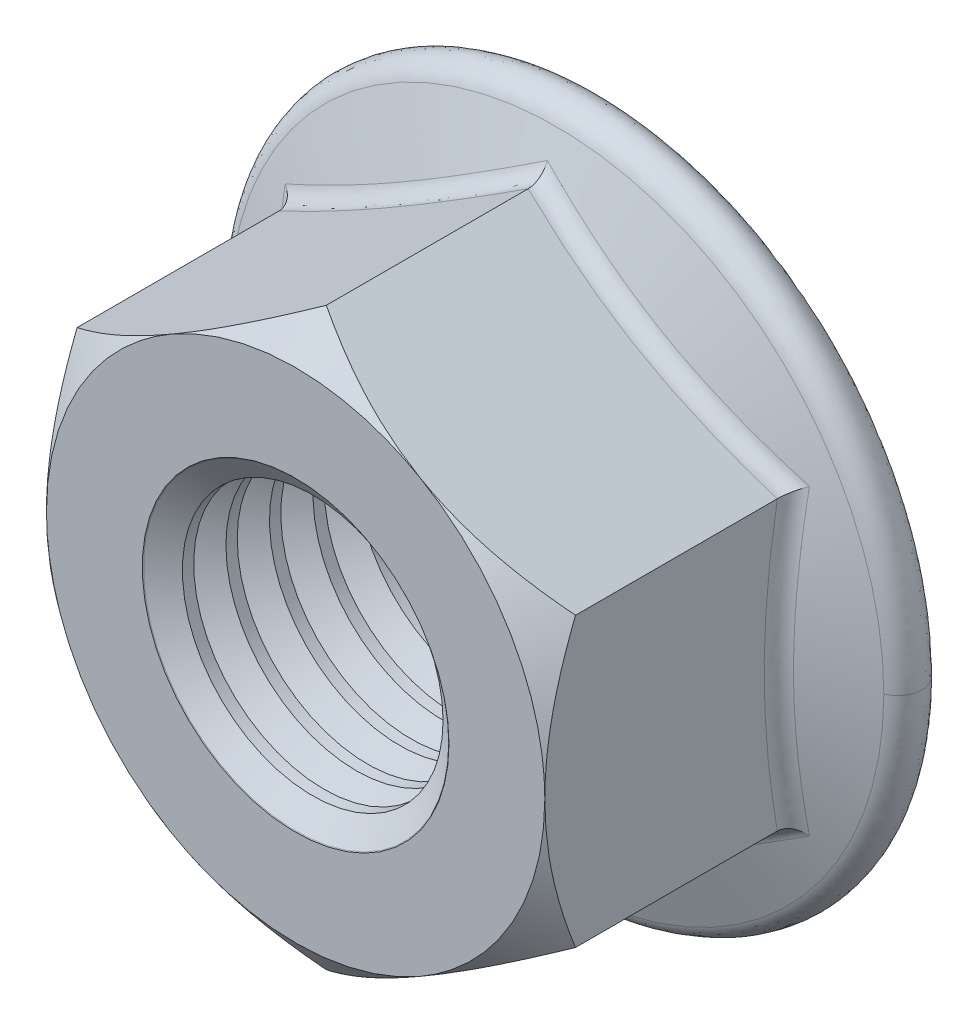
ISO-10303-21;
HEADER;
FILE_DESCRIPTION(('STEP AP214'),'2;1');
FILE_NAME('part.step','',(''),(''),'','','');
FILE_SCHEMA(('AUTOMOTIVE_DESIGN { 1 0 10303 214 1 1 1 1 }'));
ENDSEC;
DATA;
#1=APPLICATION_CONTEXT('core data for automotive mechanical design processes');
#2=APPLICATION_PROTOCOL_DEFINITION('international standard','automotive_design',2000,#1);
#3=PRODUCT_CONTEXT('',#1,'mechanical');
#4=PRODUCT('Part','Part','',(#3));
#5=PRODUCT_RELATED_PRODUCT_CATEGORY('part','',(#4));
#6=PRODUCT_DEFINITION_FORMATION('','',#4);
#7=PRODUCT_DEFINITION_CONTEXT('part definition',#1,'design');
#8=PRODUCT_DEFINITION('design','',#6,#7);
#9=PRODUCT_DEFINITION_SHAPE('','',#8);
#10=(LENGTH_UNIT() NAMED_UNIT(*) SI_UNIT(.MILLI.,.METRE.));
#11=(NAMED_UNIT(*) PLANE_ANGLE_UNIT() SI_UNIT($,.RADIAN.));
#12=(NAMED_UNIT(*) SI_UNIT($,.STERADIAN.) SOLID_ANGLE_UNIT());
#13=UNCERTAINTY_MEASURE_WITH_UNIT(LENGTH_MEASURE(1.E-05),#10,'distance_accuracy_value','');
#14=(GEOMETRIC_REPRESENTATION_CONTEXT(3) GLOBAL_UNCERTAINTY_ASSIGNED_CONTEXT((#13)) GLOBAL_UNIT_ASSIGNED_CONTEXT((#10,
#11,#12)) REPRESENTATION_CONTEXT('',''));
#15=CARTESIAN_POINT('',(0.,0.,0.));
#16=DIRECTION('',(0.,0.,1.));
#17=DIRECTION('',(1.,0.,0.));
#18=AXIS2_PLACEMENT_3D('',#15,#16,#17);
#19=CARTESIAN_POINT('',(0.,0.,-1.118987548));
#20=DIRECTION('',(0.,0.,1.));
#21=DIRECTION('',(1.,0.,0.));
#22=AXIS2_PLACEMENT_3D('',#19,#20,#21);
#23=CONICAL_SURFACE('',#22,4.06,0.959931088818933);
#24=CARTESIAN_POINT('',(0.,0.,-1.16099999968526));
#25=DIRECTION('',(0.,0.,1.));
#26=DIRECTION('',(0.,-1.,0.));
#27=AXIS2_PLACEMENT_3D('',#24,#25,#26);
#28=CIRCLE('',#27,3.99999999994);
#29=CARTESIAN_POINT('',(0.,-3.99999999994,-1.16099999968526));
#30=VERTEX_POINT('',#29);
#31=EDGE_CURVE('E755',#30,#30,#28,.T.);
#32=ORIENTED_EDGE('',*,*,#31,.T.);
#33=EDGE_LOOP('',(#32));
#34=FACE_BOUND('',#33,.T.);
#35=CARTESIAN_POINT('',(0.,0.,-1.58112452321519));
#36=DIRECTION('',(0.,0.,-1.));
#37=DIRECTION('',(0.,1.,0.));
#38=AXIS2_PLACEMENT_3D('',#35,#36,#37);
#39=CIRCLE('',#38,3.4);
#40=CARTESIAN_POINT('',(0.,3.4,-1.58112452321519));
#41=VERTEX_POINT('',#40);
#42=EDGE_CURVE('E751',#41,#41,#39,.T.);
#43=ORIENTED_EDGE('',*,*,#42,.T.);
#44=EDGE_LOOP('',(#43));
#45=FACE_BOUND('',#44,.T.);
#46=ADVANCED_FACE('F17',(#34,#45),#23,.F.);
#47=CARTESIAN_POINT('',(0.,0.,-1.203012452));
#48=DIRECTION('',(0.,0.,-1.));
#49=DIRECTION('',(-1.,0.,0.));
#50=AXIS2_PLACEMENT_3D('',#47,#48,#49);
#51=CONICAL_SURFACE('',#50,4.06,0.959931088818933);
#52=ORIENTED_EDGE('',*,*,#31,.F.);
#53=EDGE_LOOP('',(#52));
#54=FACE_BOUND('',#53,.T.);
#55=CARTESIAN_POINT('',(0.,0.,-0.740875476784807));
#56=DIRECTION('',(0.,0.,1.));
#57=DIRECTION('',(1.,0.,0.));
#58=AXIS2_PLACEMENT_3D('',#55,#56,#57);
#59=CIRCLE('',#58,3.4);
#60=CARTESIAN_POINT('',(3.4,0.,-0.740875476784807));
#61=VERTEX_POINT('',#60);
#62=EDGE_CURVE('E748',#61,#61,#59,.T.);
#63=ORIENTED_EDGE('',*,*,#62,.T.);
#64=EDGE_LOOP('',(#63));
#65=FACE_BOUND('',#64,.T.);
#66=ADVANCED_FACE('F1218',(#54,#65),#51,.F.);
#67=CARTESIAN_POINT('',(0.,0.,-1.906010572));
#68=DIRECTION('',(0.,0.,1.));
#69=DIRECTION('',(0.,-1.,0.));
#70=AXIS2_PLACEMENT_3D('',#67,#68,#69);
#71=CYLINDRICAL_SURFACE('',#70,3.4);
#72=CARTESIAN_POINT('',(0.,0.,-1.876475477));
#73=DIRECTION('',(0.,0.,-1.));
#74=DIRECTION('',(0.,1.,0.));
#75=AXIS2_PLACEMENT_3D('',#72,#73,#74);
#76=CIRCLE('',#75,3.4);
#77=CARTESIAN_POINT('',(0.,3.4,-1.876475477));
#78=VERTEX_POINT('',#77);
#79=EDGE_CURVE('E743',#78,#78,#76,.T.);
#80=ORIENTED_EDGE('',*,*,#79,.T.);
#81=EDGE_LOOP('',(#80));
#82=FACE_BOUND('',#81,.T.);
#83=ORIENTED_EDGE('',*,*,#42,.F.);
#84=EDGE_LOOP('',(#83));
#85=FACE_BOUND('',#84,.T.);
#86=ADVANCED_FACE('F1209',(#82,#85),#71,.F.);
#87=CARTESIAN_POINT('',(0.,0.,-0.770410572));
#88=DIRECTION('',(0.,0.,1.));
#89=DIRECTION('',(0.,-1.,0.));
#90=AXIS2_PLACEMENT_3D('',#87,#88,#89);
#91=CYLINDRICAL_SURFACE('',#90,3.4);
#92=CARTESIAN_POINT('',(0.,0.,-0.445524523));
#93=DIRECTION('',(0.,0.,1.));
#94=DIRECTION('',(1.,0.,0.));
#95=AXIS2_PLACEMENT_3D('',#92,#93,#94);
#96=CIRCLE('',#95,3.4);
#97=CARTESIAN_POINT('',(3.4,0.,-0.445524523));
#98=VERTEX_POINT('',#97);
#99=EDGE_CURVE('E739',#98,#98,#96,.T.);
#100=ORIENTED_EDGE('',*,*,#99,.T.);
#101=EDGE_LOOP('',(#100));
#102=FACE_BOUND('',#101,.T.);
#103=ORIENTED_EDGE('',*,*,#62,.F.);
#104=EDGE_LOOP('',(#103));
#105=FACE_BOUND('',#104,.T.);
#106=ADVANCED_FACE('F1200',(#102,#105),#91,.F.);
#107=CARTESIAN_POINT('',(0.,0.,-2.338612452));
#108=DIRECTION('',(0.,0.,-1.));
#109=DIRECTION('',(-1.,0.,0.));
#110=AXIS2_PLACEMENT_3D('',#107,#108,#109);
#111=CONICAL_SURFACE('',#110,4.06,0.959931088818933);
#112=ORIENTED_EDGE('',*,*,#79,.F.);
#113=EDGE_LOOP('',(#112));
#114=FACE_BOUND('',#113,.T.);
#115=CARTESIAN_POINT('',(0.,0.,-2.29660000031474));
#116=DIRECTION('',(0.,0.,-1.));
#117=DIRECTION('',(-1.,0.,0.));
#118=AXIS2_PLACEMENT_3D('',#115,#116,#117);
#119=CIRCLE('',#118,3.99999999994);
#120=CARTESIAN_POINT('',(-3.99999999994,0.,-2.29660000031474));
#121=VERTEX_POINT('',#120);
#122=EDGE_CURVE('E742',#121,#121,#119,.T.);
#123=ORIENTED_EDGE('',*,*,#122,.T.);
#124=EDGE_LOOP('',(#123));
#125=FACE_BOUND('',#124,.T.);
#126=ADVANCED_FACE('F1191',(#114,#125),#111,.F.);
#127=CARTESIAN_POINT('',(0.,0.,0.016612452));
#128=DIRECTION('',(0.,0.,1.));
#129=DIRECTION('',(1.,0.,0.));
#130=AXIS2_PLACEMENT_3D('',#127,#128,#129);
#131=CONICAL_SURFACE('',#130,4.06,0.959931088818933);
#132=CARTESIAN_POINT('',(0.,0.,-0.02539999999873));
#133=DIRECTION('',(0.,0.,1.));
#134=DIRECTION('',(1.,0.,0.));
#135=AXIS2_PLACEMENT_3D('',#132,#133,#134);
#136=CIRCLE('',#135,3.99999999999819);
#137=CARTESIAN_POINT('',(3.99999999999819,0.,-0.02539999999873));
#138=VERTEX_POINT('',#137);
#139=EDGE_CURVE('E737',#138,#138,#136,.T.);
#140=ORIENTED_EDGE('',*,*,#139,.T.);
#141=EDGE_LOOP('',(#140));
#142=FACE_BOUND('',#141,.T.);
#143=ORIENTED_EDGE('',*,*,#99,.F.);
#144=EDGE_LOOP('',(#143));
#145=FACE_BOUND('',#144,.T.);
#146=ADVANCED_FACE('F1182',(#142,#145),#131,.F.);
#147=CARTESIAN_POINT('',(0.,0.,-2.254587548));
#148=DIRECTION('',(0.,0.,1.));
#149=DIRECTION('',(1.,0.,0.));
#150=AXIS2_PLACEMENT_3D('',#147,#148,#149);
#151=CONICAL_SURFACE('',#150,4.06,0.959931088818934);
#152=CARTESIAN_POINT('',(0.,0.,-2.71672452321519));
#153=DIRECTION('',(0.,0.,-1.));
#154=DIRECTION('',(0.,1.,0.));
#155=AXIS2_PLACEMENT_3D('',#152,#153,#154);
#156=CIRCLE('',#155,3.4);
#157=CARTESIAN_POINT('',(0.,3.4,-2.71672452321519));
#158=VERTEX_POINT('',#157);
#159=EDGE_CURVE('E772',#158,#158,#156,.T.);
#160=ORIENTED_EDGE('',*,*,#159,.T.);
#161=EDGE_LOOP('',(#160));
#162=FACE_BOUND('',#161,.T.);
#163=ORIENTED_EDGE('',*,*,#122,.F.);
#164=EDGE_LOOP('',(#163));
#165=FACE_BOUND('',#164,.T.);
#166=ADVANCED_FACE('F1173',(#162,#165),#151,.F.);
#167=CARTESIAN_POINT('',(0.,0.,-0.02667));
#168=DIRECTION('',(0.,0.,-1.));
#169=DIRECTION('',(-1.,0.,0.));
#170=AXIS2_PLACEMENT_3D('',#167,#168,#169);
#171=CONICAL_SURFACE('',#170,4.001813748,0.959931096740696);
#172=ORIENTED_EDGE('',*,*,#139,.F.);
#173=EDGE_LOOP('',(#172));
#174=FACE_BOUND('',#173,.T.);
#175=CARTESIAN_POINT('',(0.,0.,-0.0127));
#176=DIRECTION('',(0.,0.,1.));
#177=DIRECTION('',(1.,0.,0.));
#178=AXIS2_PLACEMENT_3D('',#175,#176,#177);
#179=CIRCLE('',#178,3.98186252);
#180=CARTESIAN_POINT('',(3.98186252,0.,-0.0127));
#181=VERTEX_POINT('',#180);
#182=EDGE_CURVE('E769',#181,#181,#179,.T.);
#183=ORIENTED_EDGE('',*,*,#182,.T.);
#184=EDGE_LOOP('',(#183));
#185=FACE_BOUND('',#184,.T.);
#186=ADVANCED_FACE('F1164',(#174,#185),#171,.F.);
#187=CARTESIAN_POINT('',(0.,0.,-3.041610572));
#188=DIRECTION('',(0.,0.,1.));
#189=DIRECTION('',(0.,-1.,0.));
#190=AXIS2_PLACEMENT_3D('',#187,#188,#189);
#191=CYLINDRICAL_SURFACE('',#190,3.4);
#192=CARTESIAN_POINT('',(0.,0.,-3.012075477));
#193=DIRECTION('',(0.,0.,-1.));
#194=DIRECTION('',(0.,1.,0.));
#195=AXIS2_PLACEMENT_3D('',#192,#193,#194);
#196=CIRCLE('',#195,3.4);
#197=CARTESIAN_POINT('',(0.,3.4,-3.012075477));
#198=VERTEX_POINT('',#197);
#199=EDGE_CURVE('E766',#198,#198,#196,.T.);
#200=ORIENTED_EDGE('',*,*,#199,.T.);
#201=EDGE_LOOP('',(#200));
#202=FACE_BOUND('',#201,.T.);
#203=ORIENTED_EDGE('',*,*,#159,.F.);
#204=EDGE_LOOP('',(#203));
#205=FACE_BOUND('',#204,.T.);
#206=ADVANCED_FACE('F1156',(#202,#205),#191,.F.);
#207=CARTESIAN_POINT('',(0.,0.,0.00127));
#208=DIRECTION('',(0.,0.,1.));
#209=DIRECTION('',(1.,0.,0.));
#210=AXIS2_PLACEMENT_3D('',#207,#208,#209);
#211=CONICAL_SURFACE('',#210,4.001813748,0.959931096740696);
#212=CARTESIAN_POINT('',(0.,0.,-1.88314430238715E-09));
#213=DIRECTION('',(0.,0.,1.));
#214=DIRECTION('',(1.,0.,0.));
#215=AXIS2_PLACEMENT_3D('',#212,#213,#214);
#216=CIRCLE('',#215,3.99999999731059);
#217=CARTESIAN_POINT('',(3.99999999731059,0.,-1.88314430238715E-09));
#218=VERTEX_POINT('',#217);
#219=EDGE_CURVE('E208',#218,#218,#216,.F.);
#220=ORIENTED_EDGE('',*,*,#219,.F.);
#221=EDGE_LOOP('',(#220));
#222=FACE_BOUND('',#221,.T.);
#223=ORIENTED_EDGE('',*,*,#182,.F.);
#224=EDGE_LOOP('',(#223));
#225=FACE_BOUND('',#224,.T.);
#226=ADVANCED_FACE('F1148',(#222,#225),#211,.F.);
#227=CARTESIAN_POINT('',(0.,0.,-3.474212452));
#228=DIRECTION('',(0.,0.,-1.));
#229=DIRECTION('',(-1.,0.,0.));
#230=AXIS2_PLACEMENT_3D('',#227,#228,#229);
#231=CONICAL_SURFACE('',#230,4.06,0.959931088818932);
#232=ORIENTED_EDGE('',*,*,#199,.F.);
#233=EDGE_LOOP('',(#232));
#234=FACE_BOUND('',#233,.T.);
#235=CARTESIAN_POINT('',(0.,0.,-3.43220000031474));
#236=DIRECTION('',(0.,0.,-1.));
#237=DIRECTION('',(0.,1.,0.));
#238=AXIS2_PLACEMENT_3D('',#235,#236,#237);
#239=CIRCLE('',#238,3.99999999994);
#240=CARTESIAN_POINT('',(0.,3.99999999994,-3.43220000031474));
#241=VERTEX_POINT('',#240);
#242=EDGE_CURVE('E156',#241,#241,#239,.T.);
#243=ORIENTED_EDGE('',*,*,#242,.T.);
#244=EDGE_LOOP('',(#243));
#245=FACE_BOUND('',#244,.T.);
#246=ADVANCED_FACE('F214',(#234,#245),#231,.F.);
#247=CARTESIAN_POINT('',(-6.578,-6.578,0.));
#248=DIRECTION('',(0.,0.,1.));
#249=DIRECTION('',(1.,0.,0.));
#250=AXIS2_PLACEMENT_3D('',#247,#248,#249);
#251=PLANE('',#250);
#252=ORIENTED_EDGE('',*,*,#219,.T.);
#253=EDGE_LOOP('',(#252));
#254=FACE_BOUND('',#253,.T.);
#255=CARTESIAN_POINT('',(-3.24999999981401,-5.62916512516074,0.));
#256=CARTESIAN_POINT('',(-3.40841961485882,-5.53772428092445,0.));
#257=CARTESIAN_POINT('',(-3.5629569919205,-5.43956469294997,0.));
#258=CARTESIAN_POINT('',(-3.86320810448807,-5.2305839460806,0.));
#259=CARTESIAN_POINT('',(-4.00892229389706,-5.11976343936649,0.));
#260=CARTESIAN_POINT('',(-4.29023018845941,-4.886438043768,0.));
#261=CARTESIAN_POINT('',(-4.4258416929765,-4.76395461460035,0.));
#262=CARTESIAN_POINT('',(-4.68627424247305,-4.50801082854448,0.));
#263=CARTESIAN_POINT('',(-4.81109539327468,-4.37455057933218,0.));
#264=CARTESIAN_POINT('',(-5.04913178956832,-4.09751645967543,0.));
#265=CARTESIAN_POINT('',(-5.16234018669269,-3.95393670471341,0.));
#266=CARTESIAN_POINT('',(-5.37631101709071,-3.65768801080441,0.));
#267=CARTESIAN_POINT('',(-5.47706788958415,-3.5050150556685,0.));
#268=CARTESIAN_POINT('',(-5.66538124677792,-3.19168765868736,0.));
#269=CARTESIAN_POINT('',(-5.75293486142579,-3.0310314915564,0.));
#270=CARTESIAN_POINT('',(-5.91415750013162,-2.70298593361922,0.));
#271=CARTESIAN_POINT('',(-5.98783229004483,-2.53559937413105,0.));
#272=CARTESIAN_POINT('',(-6.12763848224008,-2.17775576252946,0.));
#273=CARTESIAN_POINT('',(-6.19222330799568,-1.98669225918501,0.));
#274=CARTESIAN_POINT('',(-6.3033805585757,-1.5993757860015,0.));
#275=CARTESIAN_POINT('',(-6.34995072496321,-1.40312216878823,0.));
#276=CARTESIAN_POINT('',(-6.42475907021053,-1.00660598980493,0.));
#277=CARTESIAN_POINT('',(-6.45294786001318,-0.806334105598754,0.));
#278=CARTESIAN_POINT('',(-6.49058287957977,-0.404042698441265,0.));
#279=CARTESIAN_POINT('',(-6.50002957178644,-0.202023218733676,0.));
#280=CARTESIAN_POINT('',(-6.50000000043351,0.,0.));
#281=B_SPLINE_CURVE_WITH_KNOTS('',3,(#255,#256,#257,#258,#259,#260,#261,#262,#263,#264,#265,
#266,#267,#268,#269,#270,#271,#272,#273,#274,#275,#276,#277,#278,#279,#280),.UNSPECIFIED.,.F.,
.F.,(4,2,2,2,2,2,2,2,2,2,2,2,4),(0.,0.548579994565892,1.09713174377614,1.6446929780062,
2.19224884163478,2.74012578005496,3.28824651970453,3.83648623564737,4.38449768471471,
4.98866417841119,5.5929063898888,6.19876552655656,6.80460971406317),.UNSPECIFIED.);
#282=CARTESIAN_POINT('',(-3.2499999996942,-5.62916512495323,1.60129426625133E-10));
#283=VERTEX_POINT('',#282);
#284=CARTESIAN_POINT('',(-6.50000000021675,0.,1.72444050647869E-10));
#285=VERTEX_POINT('',#284);
#286=EDGE_CURVE('E135',#283,#285,#281,.T.);
#287=ORIENTED_EDGE('',*,*,#286,.F.);
#288=CARTESIAN_POINT('',(3.24999999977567,-5.62916512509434,0.));
#289=CARTESIAN_POINT('',(3.09160009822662,-5.72064011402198,0.));
#290=CARTESIAN_POINT('',(2.92932271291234,-5.80539361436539,0.));
#291=CARTESIAN_POINT('',(2.59821452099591,-5.96092833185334,0.));
#292=CARTESIAN_POINT('',(2.42938405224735,-6.03171026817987,0.));
#293=CARTESIAN_POINT('',(2.0866643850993,-6.15866735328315,0.));
#294=CARTESIAN_POINT('',(1.91278487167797,-6.2148686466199,0.));
#295=CARTESIAN_POINT('',(1.5609147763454,-6.31243795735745,0.));
#296=CARTESIAN_POINT('',(1.38292423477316,-6.35380612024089,0.));
#297=CARTESIAN_POINT('',(1.02398745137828,-6.42143462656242,0.));
#298=CARTESIAN_POINT('',(0.843039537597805,-6.44768609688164,0.));
#299=CARTESIAN_POINT('',(0.479495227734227,-6.48486592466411,0.));
#300=CARTESIAN_POINT('',(0.296898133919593,-6.49578745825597,0.));
#301=CARTESIAN_POINT('',(-0.0686080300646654,-6.50220791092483,0.));
#302=CARTESIAN_POINT('',(-0.251517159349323,-6.49770348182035,0.));
#303=CARTESIAN_POINT('',(-0.61622426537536,-6.47330360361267,0.));
#304=CARTESIAN_POINT('',(-0.798022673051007,-6.4534145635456,0.));
#305=CARTESIAN_POINT('',(-1.17782742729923,-6.39556847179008,0.));
#306=CARTESIAN_POINT('',(-1.37558568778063,-6.35596881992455,0.));
#307=CARTESIAN_POINT('',(-1.76659021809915,-6.25857558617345,0.));
#308=CARTESIAN_POINT('',(-1.95983591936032,-6.20077972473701,0.));
#309=CARTESIAN_POINT('',(-2.34063317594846,-6.06730756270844,0.));
#310=CARTESIAN_POINT('',(-2.52816811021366,-5.99158382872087,0.));
#311=CARTESIAN_POINT('',(-2.89538019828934,-5.82303100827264,0.));
#312=CARTESIAN_POINT('',(-3.07505754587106,-5.73020234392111,0.));
#313=CARTESIAN_POINT('',(-3.24999999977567,-5.62916512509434,0.));
#314=B_SPLINE_CURVE_WITH_KNOTS('',3,(#288,#289,#290,#291,#292,#293,#294,#295,#296,#297,#298,
#299,#300,#301,#302,#303,#304,#305,#306,#307,#308,#309,#310,#311,#312,#313),.UNSPECIFIED.,.F.,
.F.,(4,2,2,2,2,2,2,2,2,2,2,2,4),(0.,0.548579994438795,1.09713174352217,1.64469297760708,
2.19224884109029,2.74012577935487,3.28824651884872,3.83648623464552,4.3844976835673,
4.9886641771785,5.5929063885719,6.19876552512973,6.80460971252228),.UNSPECIFIED.);
#315=CARTESIAN_POINT('',(3.2499999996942,-5.62916512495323,1.90630171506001E-10));
#316=VERTEX_POINT('',#315);
#317=EDGE_CURVE('E136',#316,#283,#314,.T.);
#318=ORIENTED_EDGE('',*,*,#317,.F.);
#319=CARTESIAN_POINT('',(6.50000000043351,0.,0.));
#320=CARTESIAN_POINT('',(6.50001971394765,-0.182915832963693,0.));
#321=CARTESIAN_POINT('',(6.49227970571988,-0.365828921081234,0.));
#322=CARTESIAN_POINT('',(6.46142262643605,-0.730344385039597,0.));
#323=CARTESIAN_POINT('',(6.43830634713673,-0.911946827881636,0.));
#324=CARTESIAN_POINT('',(6.3768945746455,-1.27222930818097,0.));
#325=CARTESIAN_POINT('',(6.33862656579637,-1.45091403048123,0.));
#326=CARTESIAN_POINT('',(6.24718902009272,-1.80442712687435,0.));
#327=CARTESIAN_POINT('',(6.19401962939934,-1.97925553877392,0.));
#328=CARTESIAN_POINT('',(6.07311924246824,-2.32391816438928,0.));
#329=CARTESIAN_POINT('',(6.00537972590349,-2.49374938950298,0.));
#330=CARTESIAN_POINT('',(5.85580624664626,-2.82717791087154,0.));
#331=CARTESIAN_POINT('',(5.77396602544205,-2.99077239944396,0.));
#332=CARTESIAN_POINT('',(5.59677321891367,-3.31052024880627,0.));
#333=CARTESIAN_POINT('',(5.50141770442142,-3.46667198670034,0.));
#334=CARTESIAN_POINT('',(5.29793323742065,-3.77031766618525,0.));
#335=CARTESIAN_POINT('',(5.18980961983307,-3.91781518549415,0.));
#336=CARTESIAN_POINT('',(4.94981105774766,-4.21781270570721,0.));
#337=CARTESIAN_POINT('',(4.81663762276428,-4.36927655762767,0.));
#338=CARTESIAN_POINT('',(4.53679034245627,-4.6591997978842,0.));
#339=CARTESIAN_POINT('',(4.39011480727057,-4.79765755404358,0.));
#340=CARTESIAN_POINT('',(4.08412589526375,-5.060701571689,0.));
#341=CARTESIAN_POINT('',(3.92477975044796,-5.18524972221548,0.));
#342=CARTESIAN_POINT('',(3.5952026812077,-5.41898830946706,0.));
#343=CARTESIAN_POINT('',(3.42497202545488,-5.5281791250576,0.));
#344=CARTESIAN_POINT('',(3.24999999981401,-5.62916512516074,0.));
#345=B_SPLINE_CURVE_WITH_KNOTS('',3,(#319,#320,#321,#322,#323,#324,#325,#326,#327,#328,#329,
#330,#331,#332,#333,#334,#335,#336,#337,#338,#339,#340,#341,#342,#343,#344),.UNSPECIFIED.,.F.,
.F.,(4,2,2,2,2,2,2,2,2,2,2,2,4),(0.,0.548579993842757,1.0971317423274,1.64469297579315,
2.19224883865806,2.74012577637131,3.28824651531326,3.8364862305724,4.384497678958,
4.9886641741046,5.59290638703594,6.19876552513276,6.80460971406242),.UNSPECIFIED.);
#346=CARTESIAN_POINT('',(6.50000000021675,0.,1.72444148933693E-10));
#347=VERTEX_POINT('',#346);
#348=EDGE_CURVE('E125',#347,#316,#345,.T.);
#349=ORIENTED_EDGE('',*,*,#348,.F.);
#350=CARTESIAN_POINT('',(3.24999999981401,5.62916512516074,0.));
#351=CARTESIAN_POINT('',(3.40841961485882,5.53772428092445,0.));
#352=CARTESIAN_POINT('',(3.5629569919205,5.43956469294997,0.));
#353=CARTESIAN_POINT('',(3.86320810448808,5.2305839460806,0.));
#354=CARTESIAN_POINT('',(4.00892229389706,5.11976343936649,0.));
#355=CARTESIAN_POINT('',(4.29023018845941,4.886438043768,0.));
#356=CARTESIAN_POINT('',(4.4258416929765,4.76395461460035,0.));
#357=CARTESIAN_POINT('',(4.68627424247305,4.50801082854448,0.));
#358=CARTESIAN_POINT('',(4.81109539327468,4.37455057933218,0.));
#359=CARTESIAN_POINT('',(5.04913178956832,4.09751645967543,0.));
#360=CARTESIAN_POINT('',(5.16234018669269,3.95393670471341,0.));
#361=CARTESIAN_POINT('',(5.37631101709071,3.65768801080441,0.));
#362=CARTESIAN_POINT('',(5.47706788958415,3.5050150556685,0.));
#363=CARTESIAN_POINT('',(5.66538124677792,3.19168765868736,0.));
#364=CARTESIAN_POINT('',(5.75293486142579,3.0310314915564,0.));
#365=CARTESIAN_POINT('',(5.91415750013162,2.70298593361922,0.));
#366=CARTESIAN_POINT('',(5.98783229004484,2.53559937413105,0.));
#367=CARTESIAN_POINT('',(6.12763848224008,2.17775576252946,0.));
#368=CARTESIAN_POINT('',(6.19222330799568,1.98669225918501,0.));
#369=CARTESIAN_POINT('',(6.3033805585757,1.59937578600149,0.));
#370=CARTESIAN_POINT('',(6.34995072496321,1.40312216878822,0.));
#371=CARTESIAN_POINT('',(6.42475907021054,1.00660598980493,0.));
#372=CARTESIAN_POINT('',(6.45294786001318,0.806334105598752,0.));
#373=CARTESIAN_POINT('',(6.49058287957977,0.404042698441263,0.));
#374=CARTESIAN_POINT('',(6.50002957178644,0.202023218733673,0.));
#375=CARTESIAN_POINT('',(6.50000000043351,0.,0.));
#376=B_SPLINE_CURVE_WITH_KNOTS('',3,(#350,#351,#352,#353,#354,#355,#356,#357,#358,#359,#360,
#361,#362,#363,#364,#365,#366,#367,#368,#369,#370,#371,#372,#373,#374,#375),.UNSPECIFIED.,.F.,
.F.,(4,2,2,2,2,2,2,2,2,2,2,2,4),(0.,0.548579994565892,1.09713174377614,1.6446929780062,
2.19224884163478,2.74012578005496,3.28824651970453,3.83648623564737,4.38449768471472,
4.98866417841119,5.5929063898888,6.19876552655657,6.80460971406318),.UNSPECIFIED.);
#377=CARTESIAN_POINT('',(3.2499999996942,5.62916512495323,1.60129623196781E-10));
#378=VERTEX_POINT('',#377);
#379=EDGE_CURVE('E221',#378,#347,#376,.T.);
#380=ORIENTED_EDGE('',*,*,#379,.F.);
#381=CARTESIAN_POINT('',(-3.24999999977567,5.62916512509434,0.));
#382=CARTESIAN_POINT('',(-3.09160009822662,5.72064011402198,0.));
#383=CARTESIAN_POINT('',(-2.92932271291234,5.80539361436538,0.));
#384=CARTESIAN_POINT('',(-2.59821452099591,5.96092833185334,0.));
#385=CARTESIAN_POINT('',(-2.42938405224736,6.03171026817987,0.));
#386=CARTESIAN_POINT('',(-2.08666438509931,6.15866735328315,0.));
#387=CARTESIAN_POINT('',(-1.91278487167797,6.2148686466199,0.));
#388=CARTESIAN_POINT('',(-1.5609147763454,6.31243795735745,0.));
#389=CARTESIAN_POINT('',(-1.38292423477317,6.35380612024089,0.));
#390=CARTESIAN_POINT('',(-1.02398745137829,6.42143462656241,0.));
#391=CARTESIAN_POINT('',(-0.843039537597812,6.44768609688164,0.));
#392=CARTESIAN_POINT('',(-0.479495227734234,6.48486592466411,0.));
#393=CARTESIAN_POINT('',(-0.296898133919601,6.49578745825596,0.));
#394=CARTESIAN_POINT('',(0.0686080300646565,6.50220791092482,0.));
#395=CARTESIAN_POINT('',(0.251517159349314,6.49770348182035,0.));
#396=CARTESIAN_POINT('',(0.61622426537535,6.47330360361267,0.));
#397=CARTESIAN_POINT('',(0.798022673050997,6.45341456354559,0.));
#398=CARTESIAN_POINT('',(1.17782742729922,6.39556847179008,0.));
#399=CARTESIAN_POINT('',(1.37558568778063,6.35596881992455,0.));
#400=CARTESIAN_POINT('',(1.76659021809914,6.25857558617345,0.));
#401=CARTESIAN_POINT('',(1.95983591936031,6.20077972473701,0.));
#402=CARTESIAN_POINT('',(2.34063317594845,6.06730756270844,0.));
#403=CARTESIAN_POINT('',(2.52816811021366,5.99158382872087,0.));
#404=CARTESIAN_POINT('',(2.89538019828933,5.82303100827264,0.));
#405=CARTESIAN_POINT('',(3.07505754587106,5.73020234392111,0.));
#406=CARTESIAN_POINT('',(3.24999999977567,5.62916512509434,0.));
#407=B_SPLINE_CURVE_WITH_KNOTS('',3,(#381,#382,#383,#384,#385,#386,#387,#388,#389,#390,#391,
#392,#393,#394,#395,#396,#397,#398,#399,#400,#401,#402,#403,#404,#405,#406),.UNSPECIFIED.,.F.,
.F.,(4,2,2,2,2,2,2,2,2,2,2,2,4),(0.,0.548579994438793,1.09713174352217,1.64469297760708,
2.19224884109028,2.74012577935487,3.28824651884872,3.83648623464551,4.38449768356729,
4.98866417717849,5.59290638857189,6.19876552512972,6.80460971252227),.UNSPECIFIED.);
#408=CARTESIAN_POINT('',(-3.2499999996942,5.62916512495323,1.90630171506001E-10));
#409=VERTEX_POINT('',#408);
#410=EDGE_CURVE('E228',#409,#378,#407,.T.);
#411=ORIENTED_EDGE('',*,*,#410,.F.);
#412=CARTESIAN_POINT('',(-6.50000000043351,0.,0.));
#413=CARTESIAN_POINT('',(-6.50001971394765,0.182915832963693,0.));
#414=CARTESIAN_POINT('',(-6.49227970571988,0.365828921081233,0.));
#415=CARTESIAN_POINT('',(-6.46142262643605,0.730344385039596,0.));
#416=CARTESIAN_POINT('',(-6.43830634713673,0.911946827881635,0.));
#417=CARTESIAN_POINT('',(-6.3768945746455,1.27222930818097,0.));
#418=CARTESIAN_POINT('',(-6.33862656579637,1.45091403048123,0.));
#419=CARTESIAN_POINT('',(-6.24718902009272,1.80442712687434,0.));
#420=CARTESIAN_POINT('',(-6.19401962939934,1.97925553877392,0.));
#421=CARTESIAN_POINT('',(-6.07311924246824,2.32391816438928,0.));
#422=CARTESIAN_POINT('',(-6.00537972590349,2.49374938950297,0.));
#423=CARTESIAN_POINT('',(-5.85580624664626,2.82717791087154,0.));
#424=CARTESIAN_POINT('',(-5.77396602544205,2.99077239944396,0.));
#425=CARTESIAN_POINT('',(-5.59677321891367,3.31052024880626,0.));
#426=CARTESIAN_POINT('',(-5.50141770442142,3.46667198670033,0.));
#427=CARTESIAN_POINT('',(-5.29793323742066,3.77031766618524,0.));
#428=CARTESIAN_POINT('',(-5.18980961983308,3.91781518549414,0.));
#429=CARTESIAN_POINT('',(-4.94981105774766,4.2178127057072,0.));
#430=CARTESIAN_POINT('',(-4.81663762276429,4.36927655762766,0.));
#431=CARTESIAN_POINT('',(-4.53679034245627,4.6591997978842,0.));
#432=CARTESIAN_POINT('',(-4.39011480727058,4.79765755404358,0.));
#433=CARTESIAN_POINT('',(-4.08412589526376,5.060701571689,0.));
#434=CARTESIAN_POINT('',(-3.92477975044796,5.18524972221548,0.));
#435=CARTESIAN_POINT('',(-3.5952026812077,5.41898830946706,0.));
#436=CARTESIAN_POINT('',(-3.42497202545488,5.5281791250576,0.));
#437=CARTESIAN_POINT('',(-3.24999999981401,5.62916512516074,0.));
#438=B_SPLINE_CURVE_WITH_KNOTS('',3,(#412,#413,#414,#415,#416,#417,#418,#419,#420,#421,#422,
#423,#424,#425,#426,#427,#428,#429,#430,#431,#432,#433,#434,#435,#436,#437),.UNSPECIFIED.,.F.,
.F.,(4,2,2,2,2,2,2,2,2,2,2,2,4),(0.,0.548579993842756,1.09713174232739,1.64469297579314,
2.19224883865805,2.7401257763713,3.28824651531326,3.83648623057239,4.38449767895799,
4.98866417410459,5.59290638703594,6.19876552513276,6.80460971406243),.UNSPECIFIED.);
#439=EDGE_CURVE('E234',#285,#409,#438,.T.);
#440=ORIENTED_EDGE('',*,*,#439,.F.);
#441=EDGE_LOOP('',(#287,#318,#349,#380,#411,#440));
#442=FACE_BOUND('',#441,.T.);
#443=ADVANCED_FACE('F150',(#254,#442),#251,.T.);
#444=CARTESIAN_POINT('',(0.,0.,-3.390187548));
#445=DIRECTION('',(0.,0.,1.));
#446=DIRECTION('',(1.,0.,0.));
#447=AXIS2_PLACEMENT_3D('',#444,#445,#446);
#448=CONICAL_SURFACE('',#447,4.06,0.959931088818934);
#449=CARTESIAN_POINT('',(0.,0.,-3.85232452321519));
#450=DIRECTION('',(0.,0.,-1.));
#451=DIRECTION('',(0.,1.,0.));
#452=AXIS2_PLACEMENT_3D('',#449,#450,#451);
#453=CIRCLE('',#452,3.4);
#454=CARTESIAN_POINT('',(0.,3.4,-3.85232452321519));
#455=VERTEX_POINT('',#454);
#456=EDGE_CURVE('E146',#455,#455,#453,.T.);
#457=ORIENTED_EDGE('',*,*,#456,.T.);
#458=EDGE_LOOP('',(#457));
#459=FACE_BOUND('',#458,.T.);
#460=ORIENTED_EDGE('',*,*,#242,.F.);
#461=EDGE_LOOP('',(#460));
#462=FACE_BOUND('',#461,.T.);
#463=ADVANCED_FACE('F186',(#459,#462),#448,.F.);
#464=CARTESIAN_POINT('',(3.847721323,-6.568784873,-0.88528));
#465=CARTESIAN_POINT('',(1.411627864,-7.99574723,-0.88528));
#466=CARTESIAN_POINT('',(-1.411627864,-7.99574723,-0.88528));
#467=CARTESIAN_POINT('',(-3.847721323,-6.568784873,-0.88528));
#468=CARTESIAN_POINT('',(3.285304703,-5.608633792,0.));
#469=CARTESIAN_POINT('',(1.205291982,-6.827018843,0.));
#470=CARTESIAN_POINT('',(-1.205291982,-6.827018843,0.));
#471=CARTESIAN_POINT('',(-3.285304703,-5.608633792,0.));
#472=(BOUNDED_SURFACE() B_SPLINE_SURFACE(1,3,((#464,#465,#466,#467),(#468,#469,#470,#471)),
.UNSPECIFIED.,.F.,.F.,.F.) B_SPLINE_SURFACE_WITH_KNOTS((2,2),(4,4),(0.,1.),(0.,1.),
.UNSPECIFIED.) GEOMETRIC_REPRESENTATION_ITEM() RATIONAL_B_SPLINE_SURFACE(((1.,0.908577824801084,
0.908577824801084,1.),(1.,0.908577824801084,0.908577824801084,1.))) REPRESENTATION_ITEM('') SURFACE());
#473=CARTESIAN_POINT('',(5.30166443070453E-10,-7.5055534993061,-0.799999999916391));
#474=CARTESIAN_POINT('',(-0.0992690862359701,-7.44824046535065,-0.754405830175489));
#475=CARTESIAN_POINT('',(-0.199001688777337,-7.39065982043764,-0.710159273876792));
#476=CARTESIAN_POINT('',(-0.399554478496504,-7.27487061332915,-0.624620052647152));
#477=CARTESIAN_POINT('',(-0.500375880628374,-7.2166613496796,-0.583331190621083));
#478=CARTESIAN_POINT('',(-0.812308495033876,-7.03656697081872,-0.461340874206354));
#479=CARTESIAN_POINT('',(-1.02507594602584,-6.9137256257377,-0.386167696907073));
#480=CARTESIAN_POINT('',(-1.45460132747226,-6.66573903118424,-0.253487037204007));
#481=CARTESIAN_POINT('',(-1.67135586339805,-6.54059574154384,-0.195965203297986));
#482=CARTESIAN_POINT('',(-2.00169752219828,-6.34987289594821,-0.124680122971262));
#483=CARTESIAN_POINT('',(-2.11406417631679,-6.28499797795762,-0.103255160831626));
#484=CARTESIAN_POINT('',(-2.33951687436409,-6.15483280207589,-0.06621594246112));
#485=CARTESIAN_POINT('',(-2.45260288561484,-6.08954256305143,-0.0506014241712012));
#486=CARTESIAN_POINT('',(-2.67959334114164,-5.95848956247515,-0.025449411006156));
#487=CARTESIAN_POINT('',(-2.7934991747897,-5.89272599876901,-0.0159285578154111));
#488=CARTESIAN_POINT('',(-3.02160110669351,-5.76103128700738,-0.00319210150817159));
#489=CARTESIAN_POINT('',(-3.13579726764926,-5.69510010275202,2.19985716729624E-05));
#490=CARTESIAN_POINT('',(-3.2499999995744,-5.62916512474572,3.20260229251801E-10));
#491=B_SPLINE_CURVE_WITH_KNOTS('',3,(#473,#474,#475,#476,#477,#478,#479,#480,#481,#482,#483,
#484,#485,#486,#487,#488,#489,#490),.UNSPECIFIED.,.F.,.F.,(4,2,2,2,2,2,2,2,4),(0.,
0.370068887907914,0.740605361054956,1.51083341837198,2.28043356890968,2.67484288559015,
3.06923441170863,3.46469846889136,3.86025676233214),.UNSPECIFIED.);
#492=CARTESIAN_POINT('',(-2.65083834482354E-10,-7.50555349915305,-0.800000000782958));
#493=VERTEX_POINT('',#492);
#494=EDGE_CURVE('E159',#493,#283,#491,.T.);
#495=CARTESIAN_POINT('',(3.2499999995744,-5.62916512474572,3.20259246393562E-10));
#496=CARTESIAN_POINT('',(3.14774469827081,-5.68820225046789,1.43174401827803E-05));
#497=CARTESIAN_POINT('',(3.04549325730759,-5.74723714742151,-0.00255920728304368));
#498=CARTESIAN_POINT('',(2.84119424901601,-5.8651892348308,-0.0127760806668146));
#499=CARTESIAN_POINT('',(2.73914665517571,-5.92410644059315,-0.0204187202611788));
#500=CARTESIAN_POINT('',(2.53566082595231,-6.04158903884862,-0.0406443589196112));
#501=CARTESIAN_POINT('',(2.43422172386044,-6.10015493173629,-0.0532157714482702));
#502=CARTESIAN_POINT('',(2.23187325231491,-6.2169808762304,-0.0831016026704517));
#503=CARTESIAN_POINT('',(2.13096388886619,-6.2752409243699,-0.100416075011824));
#504=CARTESIAN_POINT('',(1.85745354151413,-6.43315219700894,-0.153623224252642));
#505=CARTESIAN_POINT('',(1.68548604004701,-6.53243768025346,-0.193921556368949));
#506=CARTESIAN_POINT('',(1.34384695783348,-6.72968309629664,-0.28637266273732));
#507=CARTESIAN_POINT('',(1.17417738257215,-6.82764187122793,-0.338535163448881));
#508=CARTESIAN_POINT('',(0.835371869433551,-7.02325132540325,-0.453793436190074));
#509=CARTESIAN_POINT('',(0.666269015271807,-7.12088290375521,-0.517017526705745));
#510=CARTESIAN_POINT('',(0.331002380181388,-7.31444918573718,-0.652280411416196));
#511=CARTESIAN_POINT('',(0.164834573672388,-7.41038621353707,-0.724305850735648));
#512=CARTESIAN_POINT('',(-5.30167596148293E-10,-7.50555349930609,-0.79999999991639));
#513=B_SPLINE_CURVE_WITH_KNOTS('',3,(#495,#496,#497,#498,#499,#500,#501,#502,#503,#504,#505,
#506,#507,#508,#509,#510,#511,#512),.UNSPECIFIED.,.F.,.F.,(4,2,2,2,2,2,2,2,4),(0.,
0.35418739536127,0.708325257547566,1.06163555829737,1.41494985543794,2.02236233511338,
2.63027458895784,3.24577330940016,3.86034942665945),.UNSPECIFIED.);
#514=EDGE_CURVE('E142',#316,#493,#513,.T.);
#515=ORIENTED_EDGE('',*,*,#494,.F.);
#516=ORIENTED_EDGE('',*,*,#514,.F.);
#517=ORIENTED_EDGE('',*,*,#317,.T.);
#518=EDGE_LOOP('',(#515,#516,#517));
#519=FACE_BOUND('',#518,.T.);
#520=ADVANCED_FACE('F158',(#519),#472,.T.);
#521=CARTESIAN_POINT('',(7.612595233,0.047831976,-0.88528));
#522=CARTESIAN_POINT('',(7.630334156,-2.775368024,-0.88528));
#523=CARTESIAN_POINT('',(6.218706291,-5.220379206,-0.88528));
#524=CARTESIAN_POINT('',(3.76487391,-6.616616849,-0.88528));
#525=CARTESIAN_POINT('',(6.499871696,0.040840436,0.));
#526=CARTESIAN_POINT('',(6.515017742,-2.369695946,0.));
#527=CARTESIAN_POINT('',(5.309725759,-4.457322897,0.));
#528=CARTESIAN_POINT('',(3.214566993,-5.649474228,0.));
#529=(BOUNDED_SURFACE() B_SPLINE_SURFACE(1,3,((#521,#522,#523,#524),(#525,#526,#527,#528)),
.UNSPECIFIED.,.F.,.F.,.F.) B_SPLINE_SURFACE_WITH_KNOTS((2,2),(4,4),(0.,1.),(0.,1.),
.UNSPECIFIED.) GEOMETRIC_REPRESENTATION_ITEM() RATIONAL_B_SPLINE_SURFACE(((1.,0.908577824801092,
0.908577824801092,1.),(1.,0.908577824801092,0.908577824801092,1.))) REPRESENTATION_ITEM('') SURFACE());
#530=CARTESIAN_POINT('',(6.5000000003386,-3.75277674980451,-0.800000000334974));
#531=CARTESIAN_POINT('',(6.4007309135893,-3.81008978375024,-0.754405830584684));
#532=CARTESIAN_POINT('',(6.30099831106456,-3.86767042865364,-0.710159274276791));
#533=CARTESIAN_POINT('',(6.10044552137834,-3.98345963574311,-0.624620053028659));
#534=CARTESIAN_POINT('',(5.9996241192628,-4.04166889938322,-0.583331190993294));
#535=CARTESIAN_POINT('',(5.68769150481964,-4.22176327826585,-0.461340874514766));
#536=CARTESIAN_POINT('',(5.47492405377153,-4.34460462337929,-0.386167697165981));
#537=CARTESIAN_POINT('',(5.04539867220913,-4.59259121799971,-0.253487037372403));
#538=CARTESIAN_POINT('',(4.82864413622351,-4.71773450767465,-0.195965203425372));
#539=CARTESIAN_POINT('',(4.49830247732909,-4.90845735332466,-0.124680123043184));
#540=CARTESIAN_POINT('',(4.38593582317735,-4.97333227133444,-0.103255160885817));
#541=CARTESIAN_POINT('',(4.16048312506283,-5.10349744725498,-0.0662159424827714));
#542=CARTESIAN_POINT('',(4.04739711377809,-5.16878768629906,-0.0506014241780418));
#543=CARTESIAN_POINT('',(3.82040665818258,-5.29984068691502,-0.0254494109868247));
#544=CARTESIAN_POINT('',(3.70650082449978,-5.36560425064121,-0.0159285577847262));
#545=CARTESIAN_POINT('',(3.47839889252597,-5.49729896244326,-0.00319210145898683));
#546=CARTESIAN_POINT('',(3.36420273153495,-5.56323014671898,2.19986279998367E-05));
#547=CARTESIAN_POINT('',(3.2499999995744,-5.62916512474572,3.81260343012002E-10));
#548=B_SPLINE_CURVE_WITH_KNOTS('',3,(#530,#531,#532,#533,#534,#535,#536,#537,#538,#539,#540,
#541,#542,#543,#544,#545,#546,#547),.UNSPECIFIED.,.F.,.F.,(4,2,2,2,2,2,2,2,4),(0.,
0.370068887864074,0.740605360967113,1.51083341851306,2.28043356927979,2.67484288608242,
3.06923441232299,3.46469846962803,3.86025676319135),.UNSPECIFIED.);
#549=CARTESIAN_POINT('',(6.5000000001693,-3.75277675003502,-0.800000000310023));
#550=VERTEX_POINT('',#549);
#551=EDGE_CURVE('E128',#550,#316,#548,.T.);
#552=CARTESIAN_POINT('',(6.5,-3.75277675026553,-0.800000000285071));
#553=CARTESIAN_POINT('',(6.5,-3.63815068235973,-0.754405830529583));
#554=CARTESIAN_POINT('',(6.5,-3.52298939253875,-0.710159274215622));
#555=CARTESIAN_POINT('',(6.5,-3.29141097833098,-0.624620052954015));
#556=CARTESIAN_POINT('',(6.5,-3.17499245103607,-0.583331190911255));
#557=CARTESIAN_POINT('',(6.5,-2.81480369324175,-0.461340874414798));
#558=CARTESIAN_POINT('',(6.5,-2.56912100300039,-0.386167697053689));
#559=CARTESIAN_POINT('',(6.5,-2.07314781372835,-0.253487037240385));
#560=CARTESIAN_POINT('',(6.5,-1.82286123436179,-0.195965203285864));
#561=CARTESIAN_POINT('',(6.5,-1.44141554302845,-0.124680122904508));
#562=CARTESIAN_POINT('',(6.5,-1.31166570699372,-0.103255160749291));
#563=CARTESIAN_POINT('',(6.5,-1.05133535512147,-0.0662159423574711));
#564=CARTESIAN_POINT('',(6.5,-0.920754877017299,-0.0506014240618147));
#565=CARTESIAN_POINT('',(6.5,-0.658648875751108,-0.0254494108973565));
#566=CARTESIAN_POINT('',(6.5,-0.527121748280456,-0.0159285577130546));
#567=CARTESIAN_POINT('',(6.5,-0.263732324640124,-0.00319210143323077));
#568=CARTESIAN_POINT('',(6.5,-0.131869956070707,2.19986256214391E-05));
#569=CARTESIAN_POINT('',(6.5,0.,3.44888691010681E-10));
#570=B_SPLINE_CURVE_WITH_KNOTS('',3,(#552,#553,#554,#555,#556,#557,#558,#559,#560,#561,#562,
#563,#564,#565,#566,#567,#568,#569),.UNSPECIFIED.,.F.,.F.,(4,2,2,2,2,2,2,2,4),(0.,
0.370068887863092,0.74060536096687,1.51083341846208,2.28043356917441,2.67484288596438,
3.0692344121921,3.46469846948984,3.86025676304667),.UNSPECIFIED.);
#571=EDGE_CURVE('E130',#550,#347,#570,.T.);
#572=ORIENTED_EDGE('',*,*,#348,.T.);
#573=ORIENTED_EDGE('',*,*,#551,.F.);
#574=ORIENTED_EDGE('',*,*,#571,.T.);
#575=EDGE_LOOP('',(#572,#573,#574));
#576=FACE_BOUND('',#575,.T.);
#577=ADVANCED_FACE('F127',(#576),#529,.T.);
#578=CARTESIAN_POINT('',(-3.76487391,-6.616616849,-0.88528));
#579=CARTESIAN_POINT('',(-6.218706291,-5.220379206,-0.88528));
#580=CARTESIAN_POINT('',(-7.630334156,-2.775368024,-0.88528));
#581=CARTESIAN_POINT('',(-7.612595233,0.047831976,-0.88528));
#582=CARTESIAN_POINT('',(-3.214566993,-5.649474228,0.));
#583=CARTESIAN_POINT('',(-5.309725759,-4.457322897,0.));
#584=CARTESIAN_POINT('',(-6.515017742,-2.369695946,0.));
#585=CARTESIAN_POINT('',(-6.499871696,0.040840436,0.));
#586=(BOUNDED_SURFACE() B_SPLINE_SURFACE(1,3,((#578,#579,#580,#581),(#582,#583,#584,#585)),
.UNSPECIFIED.,.F.,.F.,.F.) B_SPLINE_SURFACE_WITH_KNOTS((2,2),(4,4),(0.,1.),(0.,1.),
.UNSPECIFIED.) GEOMETRIC_REPRESENTATION_ITEM() RATIONAL_B_SPLINE_SURFACE(((1.,0.908577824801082,
0.908577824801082,1.),(1.,0.908577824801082,0.908577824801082,1.))) REPRESENTATION_ITEM('') SURFACE());
#587=CARTESIAN_POINT('',(-6.5,-3.75277675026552,-0.800000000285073));
#588=CARTESIAN_POINT('',(-6.5,-3.63815068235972,-0.754405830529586));
#589=CARTESIAN_POINT('',(-6.5,-3.52298939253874,-0.710159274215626));
#590=CARTESIAN_POINT('',(-6.5,-3.29141097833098,-0.624620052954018));
#591=CARTESIAN_POINT('',(-6.5,-3.17499245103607,-0.583331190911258));
#592=CARTESIAN_POINT('',(-6.5,-2.81480369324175,-0.461340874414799));
#593=CARTESIAN_POINT('',(-6.5,-2.56912100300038,-0.38616769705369));
#594=CARTESIAN_POINT('',(-6.5,-2.07314781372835,-0.253487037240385));
#595=CARTESIAN_POINT('',(-6.5,-1.82286123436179,-0.195965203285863));
#596=CARTESIAN_POINT('',(-6.5,-1.44141554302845,-0.124680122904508));
#597=CARTESIAN_POINT('',(-6.5,-1.31166570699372,-0.103255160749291));
#598=CARTESIAN_POINT('',(-6.5,-1.05133535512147,-0.0662159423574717));
#599=CARTESIAN_POINT('',(-6.5,-0.920754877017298,-0.0506014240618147));
#600=CARTESIAN_POINT('',(-6.5,-0.658648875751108,-0.0254494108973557));
#601=CARTESIAN_POINT('',(-6.5,-0.527121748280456,-0.0159285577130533));
#602=CARTESIAN_POINT('',(-6.5,-0.263732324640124,-0.00319210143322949));
#603=CARTESIAN_POINT('',(-6.5,-0.131869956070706,2.19986256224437E-05));
#604=CARTESIAN_POINT('',(-6.5,0.,3.44888887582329E-10));
#605=B_SPLINE_CURVE_WITH_KNOTS('',3,(#587,#588,#589,#590,#591,#592,#593,#594,#595,#596,#597,
#598,#599,#600,#601,#602,#603,#604),.UNSPECIFIED.,.F.,.F.,(4,2,2,2,2,2,2,2,4),(0.,
0.370068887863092,0.74060536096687,1.51083341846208,2.28043356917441,2.67484288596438,
3.0692344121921,3.46469846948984,3.86025676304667),.UNSPECIFIED.);
#606=CARTESIAN_POINT('',(-6.5000000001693,-3.75277674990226,-0.800000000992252));
#607=VERTEX_POINT('',#606);
#608=EDGE_CURVE('E260',#607,#285,#605,.T.);
#609=CARTESIAN_POINT('',(-3.2499999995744,-5.62916512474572,3.81258967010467E-10));
#610=CARTESIAN_POINT('',(-3.35225530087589,-5.57012799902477,1.43174969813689E-05));
#611=CARTESIAN_POINT('',(-3.4545067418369,-5.51109310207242,-0.00255920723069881));
#612=CARTESIAN_POINT('',(-3.65880575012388,-5.39314101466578,-0.0127760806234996));
#613=CARTESIAN_POINT('',(-3.76085334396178,-5.33422380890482,-0.0204187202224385));
#614=CARTESIAN_POINT('',(-3.96433917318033,-5.21674121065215,-0.0406443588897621));
#615=CARTESIAN_POINT('',(-4.06577827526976,-5.1581753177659,-0.0532157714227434));
#616=CARTESIAN_POINT('',(-4.2681267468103,-5.04134937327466,-0.0831016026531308));
#617=CARTESIAN_POINT('',(-4.36903611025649,-4.98308932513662,-0.100416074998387));
#618=CARTESIAN_POINT('',(-4.64254645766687,-4.82517805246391,-0.153623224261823));
#619=CARTESIAN_POINT('',(-4.81451395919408,-4.7258925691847,-0.193921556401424));
#620=CARTESIAN_POINT('',(-5.15615304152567,-4.52864715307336,-0.286372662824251));
#621=CARTESIAN_POINT('',(-5.32582261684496,-4.4306883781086,-0.338535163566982));
#622=CARTESIAN_POINT('',(-5.66462813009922,-4.23507892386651,-0.453793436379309));
#623=CARTESIAN_POINT('',(-5.83373098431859,-4.13744734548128,-0.517017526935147));
#624=CARTESIAN_POINT('',(-6.16899761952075,-3.9438810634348,-0.652280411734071));
#625=CARTESIAN_POINT('',(-6.33516542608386,-3.84794403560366,-0.724305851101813));
#626=CARTESIAN_POINT('',(-6.50000000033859,-3.75277674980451,-0.800000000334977));
#627=B_SPLINE_CURVE_WITH_KNOTS('',3,(#609,#610,#611,#612,#613,#614,#615,#616,#617,#618,#619,
#620,#621,#622,#623,#624,#625,#626),.UNSPECIFIED.,.F.,.F.,(4,2,2,2,2,2,2,2,4),(0.,
0.354187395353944,0.708325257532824,1.06163555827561,1.41494985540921,2.0223623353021,
2.63027458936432,3.24577331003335,3.86034942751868),.UNSPECIFIED.);
#628=EDGE_CURVE('E267',#283,#607,#627,.T.);
#629=ORIENTED_EDGE('',*,*,#608,.F.);
#630=ORIENTED_EDGE('',*,*,#628,.F.);
#631=ORIENTED_EDGE('',*,*,#286,.T.);
#632=EDGE_LOOP('',(#629,#630,#631));
#633=FACE_BOUND('',#632,.T.);
#634=ADVANCED_FACE('F242',(#633),#586,.T.);
#635=CARTESIAN_POINT('',(-7.612595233,-0.047831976,-0.88528));
#636=CARTESIAN_POINT('',(-7.630334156,2.775368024,-0.88528));
#637=CARTESIAN_POINT('',(-6.218706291,5.220379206,-0.88528));
#638=CARTESIAN_POINT('',(-3.76487391,6.616616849,-0.88528));
#639=CARTESIAN_POINT('',(-6.499871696,-0.040840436,0.));
#640=CARTESIAN_POINT('',(-6.515017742,2.369695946,0.));
#641=CARTESIAN_POINT('',(-5.309725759,4.457322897,0.));
#642=CARTESIAN_POINT('',(-3.214566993,5.649474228,0.));
#643=(BOUNDED_SURFACE() B_SPLINE_SURFACE(1,3,((#635,#636,#637,#638),(#639,#640,#641,#642)),
.UNSPECIFIED.,.F.,.F.,.F.) B_SPLINE_SURFACE_WITH_KNOTS((2,2),(4,4),(0.,1.),(0.,1.),
.UNSPECIFIED.) GEOMETRIC_REPRESENTATION_ITEM() RATIONAL_B_SPLINE_SURFACE(((1.,0.908577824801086,
0.908577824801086,1.),(1.,0.908577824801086,0.908577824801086,1.))) REPRESENTATION_ITEM('') SURFACE());
#644=CARTESIAN_POINT('',(-6.50000000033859,3.75277674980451,-0.800000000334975));
#645=CARTESIAN_POINT('',(-6.4007309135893,3.81008978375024,-0.754405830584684));
#646=CARTESIAN_POINT('',(-6.30099831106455,3.86767042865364,-0.710159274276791));
#647=CARTESIAN_POINT('',(-6.10044552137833,3.98345963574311,-0.624620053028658));
#648=CARTESIAN_POINT('',(-5.9996241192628,4.04166889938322,-0.583331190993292));
#649=CARTESIAN_POINT('',(-5.68769150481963,4.22176327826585,-0.461340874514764));
#650=CARTESIAN_POINT('',(-5.47492405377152,4.34460462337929,-0.386167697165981));
#651=CARTESIAN_POINT('',(-5.04539867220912,4.59259121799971,-0.253487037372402));
#652=CARTESIAN_POINT('',(-4.82864413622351,4.71773450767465,-0.19596520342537));
#653=CARTESIAN_POINT('',(-4.49830247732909,4.90845735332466,-0.124680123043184));
#654=CARTESIAN_POINT('',(-4.38593582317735,4.97333227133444,-0.103255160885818));
#655=CARTESIAN_POINT('',(-4.16048312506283,5.10349744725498,-0.0662159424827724));
#656=CARTESIAN_POINT('',(-4.04739711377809,5.16878768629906,-0.0506014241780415));
#657=CARTESIAN_POINT('',(-3.82040665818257,5.29984068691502,-0.0254494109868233));
#658=CARTESIAN_POINT('',(-3.70650082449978,5.36560425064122,-0.015928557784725));
#659=CARTESIAN_POINT('',(-3.47839889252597,5.49729896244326,-0.00319210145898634));
#660=CARTESIAN_POINT('',(-3.36420273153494,5.56323014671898,2.19986279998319E-05));
#661=CARTESIAN_POINT('',(-3.2499999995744,5.62916512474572,3.81260343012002E-10));
#662=B_SPLINE_CURVE_WITH_KNOTS('',3,(#644,#645,#646,#647,#648,#649,#650,#651,#652,#653,#654,
#655,#656,#657,#658,#659,#660,#661),.UNSPECIFIED.,.F.,.F.,(4,2,2,2,2,2,2,2,4),(0.,
0.370068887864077,0.740605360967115,1.51083341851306,2.28043356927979,2.67484288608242,
3.06923441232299,3.46469846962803,3.86025676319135),.UNSPECIFIED.);
#663=CARTESIAN_POINT('',(-6.5,3.75277675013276,-0.8000000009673));
#664=VERTEX_POINT('',#663);
#665=EDGE_CURVE('E342',#664,#409,#662,.T.);
#666=CARTESIAN_POINT('',(-6.5,0.,3.44888101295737E-10));
#667=CARTESIAN_POINT('',(-6.5,0.118074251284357,1.43174909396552E-05));
#668=CARTESIAN_POINT('',(-6.5,0.236144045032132,-0.00255920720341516));
#669=CARTESIAN_POINT('',(-6.5,0.472048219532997,-0.0127760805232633));
#670=CARTESIAN_POINT('',(-6.5,0.589882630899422,-0.0204187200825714));
#671=CARTESIAN_POINT('',(-6.5,0.824847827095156,-0.0406443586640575));
#672=CARTESIAN_POINT('',(-6.5,0.941979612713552,-0.0532157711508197));
#673=CARTESIAN_POINT('',(-6.5,1.17563150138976,-0.083101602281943));
#674=CARTESIAN_POINT('',(-6.5,1.29215159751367,-0.100416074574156));
#675=CARTESIAN_POINT('',(-6.5,1.60797414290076,-0.153623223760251));
#676=CARTESIAN_POINT('',(-6.5,1.80654510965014,-0.193921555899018));
#677=CARTESIAN_POINT('',(-6.5,2.20103594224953,-0.286372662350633));
#678=CARTESIAN_POINT('',(-6.5,2.39695349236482,-0.338535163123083));
#679=CARTESIAN_POINT('',(-6.5,2.78817240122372,-0.453793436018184));
#680=CARTESIAN_POINT('',(-6.5,2.98343555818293,-0.517017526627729));
#681=CARTESIAN_POINT('',(-6.5,3.37056812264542,-0.652280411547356));
#682=CARTESIAN_POINT('',(-6.5,3.56244217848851,-0.724305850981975));
#683=CARTESIAN_POINT('',(-6.5,3.75277675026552,-0.800000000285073));
#684=B_SPLINE_CURVE_WITH_KNOTS('',3,(#666,#667,#668,#669,#670,#671,#672,#673,#674,#675,#676,
#677,#678,#679,#680,#681,#682,#683),.UNSPECIFIED.,.F.,.F.,(4,2,2,2,2,2,2,2,4),(0.,
0.354187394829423,0.708325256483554,1.06163555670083,1.41494985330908,2.02236233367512,
2.63027458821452,3.2457733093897,3.86034942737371),.UNSPECIFIED.);
#685=EDGE_CURVE('E336',#285,#664,#684,.T.);
#686=ORIENTED_EDGE('',*,*,#439,.T.);
#687=ORIENTED_EDGE('',*,*,#665,.F.);
#688=ORIENTED_EDGE('',*,*,#685,.F.);
#689=EDGE_LOOP('',(#686,#687,#688));
#690=FACE_BOUND('',#689,.T.);
#691=ADVANCED_FACE('F247',(#690),#643,.T.);
#692=CARTESIAN_POINT('',(-3.847721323,6.568784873,-0.88528));
#693=CARTESIAN_POINT('',(-1.411627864,7.99574723,-0.88528));
#694=CARTESIAN_POINT('',(1.411627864,7.99574723,-0.88528));
#695=CARTESIAN_POINT('',(3.847721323,6.568784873,-0.88528));
#696=CARTESIAN_POINT('',(-3.285304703,5.608633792,0.));
#697=CARTESIAN_POINT('',(-1.205291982,6.827018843,0.));
#698=CARTESIAN_POINT('',(1.205291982,6.827018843,0.));
#699=CARTESIAN_POINT('',(3.285304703,5.608633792,0.));
#700=(BOUNDED_SURFACE() B_SPLINE_SURFACE(1,3,((#692,#693,#694,#695),(#696,#697,#698,#699)),
.UNSPECIFIED.,.F.,.F.,.F.) B_SPLINE_SURFACE_WITH_KNOTS((2,2),(4,4),(0.,1.),(0.,1.),
.UNSPECIFIED.) GEOMETRIC_REPRESENTATION_ITEM() RATIONAL_B_SPLINE_SURFACE(((1.,0.908577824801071,
0.908577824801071,1.),(1.,0.908577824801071,0.908577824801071,1.))) REPRESENTATION_ITEM('') SURFACE());
#701=CARTESIAN_POINT('',(-5.30165654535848E-10,7.50555349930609,-0.799999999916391));
#702=CARTESIAN_POINT('',(0.0992690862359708,7.44824046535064,-0.754405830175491));
#703=CARTESIAN_POINT('',(0.199001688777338,7.39065982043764,-0.710159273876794));
#704=CARTESIAN_POINT('',(0.399554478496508,7.27487061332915,-0.624620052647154));
#705=CARTESIAN_POINT('',(0.500375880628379,7.21666134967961,-0.583331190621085));
#706=CARTESIAN_POINT('',(0.812308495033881,7.03656697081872,-0.461340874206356));
#707=CARTESIAN_POINT('',(1.02507594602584,6.9137256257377,-0.386167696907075));
#708=CARTESIAN_POINT('',(1.45460132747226,6.66573903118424,-0.25348703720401));
#709=CARTESIAN_POINT('',(1.67135586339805,6.54059574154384,-0.195965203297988));
#710=CARTESIAN_POINT('',(2.00169752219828,6.34987289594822,-0.124680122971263));
#711=CARTESIAN_POINT('',(2.11406417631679,6.28499797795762,-0.103255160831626));
#712=CARTESIAN_POINT('',(2.33951687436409,6.15483280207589,-0.0662159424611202));
#713=CARTESIAN_POINT('',(2.45260288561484,6.08954256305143,-0.0506014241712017));
#714=CARTESIAN_POINT('',(2.67959334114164,5.95848956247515,-0.0254494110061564));
#715=CARTESIAN_POINT('',(2.7934991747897,5.892725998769,-0.015928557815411));
#716=CARTESIAN_POINT('',(3.02160110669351,5.76103128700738,-0.00319210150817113));
#717=CARTESIAN_POINT('',(3.13579726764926,5.69510010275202,2.19985716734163E-05));
#718=CARTESIAN_POINT('',(3.2499999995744,5.62916512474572,3.20259836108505E-10));
#719=B_SPLINE_CURVE_WITH_KNOTS('',3,(#701,#702,#703,#704,#705,#706,#707,#708,#709,#710,#711,
#712,#713,#714,#715,#716,#717,#718),.UNSPECIFIED.,.F.,.F.,(4,2,2,2,2,2,2,2,4),(0.,
0.370068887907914,0.740605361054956,1.51083341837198,2.28043356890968,2.67484288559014,
3.06923441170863,3.46469846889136,3.86025676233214),.UNSPECIFIED.);
#720=CARTESIAN_POINT('',(2.6508245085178E-10,7.50555349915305,-0.800000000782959));
#721=VERTEX_POINT('',#720);
#722=EDGE_CURVE('E354',#721,#378,#719,.T.);
#723=CARTESIAN_POINT('',(-3.2499999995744,5.62916512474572,3.20259246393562E-10));
#724=CARTESIAN_POINT('',(-3.14774469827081,5.68820225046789,1.43174401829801E-05));
#725=CARTESIAN_POINT('',(-3.04549325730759,5.74723714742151,-0.00255920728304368));
#726=CARTESIAN_POINT('',(-2.84119424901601,5.8651892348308,-0.0127760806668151));
#727=CARTESIAN_POINT('',(-2.73914665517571,5.92410644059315,-0.0204187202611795));
#728=CARTESIAN_POINT('',(-2.53566082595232,6.04158903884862,-0.0406443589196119));
#729=CARTESIAN_POINT('',(-2.43422172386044,6.10015493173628,-0.0532157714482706));
#730=CARTESIAN_POINT('',(-2.23187325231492,6.2169808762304,-0.0831016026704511));
#731=CARTESIAN_POINT('',(-2.1309638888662,6.2752409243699,-0.100416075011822));
#732=CARTESIAN_POINT('',(-1.85745354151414,6.43315219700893,-0.153623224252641));
#733=CARTESIAN_POINT('',(-1.68548604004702,6.53243768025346,-0.193921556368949));
#734=CARTESIAN_POINT('',(-1.34384695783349,6.72968309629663,-0.286372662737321));
#735=CARTESIAN_POINT('',(-1.17417738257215,6.82764187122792,-0.338535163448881));
#736=CARTESIAN_POINT('',(-0.835371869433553,7.02325132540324,-0.453793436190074));
#737=CARTESIAN_POINT('',(-0.66626901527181,7.1208829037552,-0.517017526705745));
#738=CARTESIAN_POINT('',(-0.331002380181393,7.31444918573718,-0.652280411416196));
#739=CARTESIAN_POINT('',(-0.164834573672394,7.41038621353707,-0.724305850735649));
#740=CARTESIAN_POINT('',(5.30164855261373E-10,7.50555349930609,-0.799999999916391));
#741=B_SPLINE_CURVE_WITH_KNOTS('',3,(#723,#724,#725,#726,#727,#728,#729,#730,#731,#732,#733,
#734,#735,#736,#737,#738,#739,#740),.UNSPECIFIED.,.F.,.F.,(4,2,2,2,2,2,2,2,4),(0.,
0.354187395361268,0.708325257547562,1.06163555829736,1.41494985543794,2.02236233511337,
2.63027458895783,3.24577330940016,3.86034942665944),.UNSPECIFIED.);
#742=EDGE_CURVE('E348',#409,#721,#741,.T.);
#743=ORIENTED_EDGE('',*,*,#722,.F.);
#744=ORIENTED_EDGE('',*,*,#742,.F.);
#745=ORIENTED_EDGE('',*,*,#410,.T.);
#746=EDGE_LOOP('',(#743,#744,#745));
#747=FACE_BOUND('',#746,.T.);
#748=ADVANCED_FACE('F359',(#747),#700,.T.);
#749=CARTESIAN_POINT('',(3.76487391,6.616616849,-0.88528));
#750=CARTESIAN_POINT('',(6.218706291,5.220379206,-0.88528));
#751=CARTESIAN_POINT('',(7.630334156,2.775368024,-0.88528));
#752=CARTESIAN_POINT('',(7.612595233,-0.047831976,-0.88528));
#753=CARTESIAN_POINT('',(3.214566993,5.649474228,0.));
#754=CARTESIAN_POINT('',(5.309725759,4.457322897,0.));
#755=CARTESIAN_POINT('',(6.515017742,2.369695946,0.));
#756=CARTESIAN_POINT('',(6.499871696,-0.040840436,0.));
#757=(BOUNDED_SURFACE() B_SPLINE_SURFACE(1,3,((#749,#750,#751,#752),(#753,#754,#755,#756)),
.UNSPECIFIED.,.F.,.F.,.F.) B_SPLINE_SURFACE_WITH_KNOTS((2,2),(4,4),(0.,1.),(0.,1.),
.UNSPECIFIED.) GEOMETRIC_REPRESENTATION_ITEM() RATIONAL_B_SPLINE_SURFACE(((1.,0.908577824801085,
0.908577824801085,1.),(1.,0.908577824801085,0.908577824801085,1.))) REPRESENTATION_ITEM('') SURFACE());
#758=CARTESIAN_POINT('',(6.5,0.,3.44888297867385E-10));
#759=CARTESIAN_POINT('',(6.5,0.118074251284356,1.43174909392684E-05));
#760=CARTESIAN_POINT('',(6.5,0.236144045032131,-0.00255920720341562));
#761=CARTESIAN_POINT('',(6.5,0.472048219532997,-0.0127760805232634));
#762=CARTESIAN_POINT('',(6.5,0.589882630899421,-0.0204187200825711));
#763=CARTESIAN_POINT('',(6.5,0.824847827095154,-0.0406443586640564));
#764=CARTESIAN_POINT('',(6.5,0.94197961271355,-0.0532157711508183));
#765=CARTESIAN_POINT('',(6.5,1.17563150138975,-0.0831016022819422));
#766=CARTESIAN_POINT('',(6.5,1.29215159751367,-0.100416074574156));
#767=CARTESIAN_POINT('',(6.5,1.60797414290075,-0.153623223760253));
#768=CARTESIAN_POINT('',(6.5,1.80654510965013,-0.193921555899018));
#769=CARTESIAN_POINT('',(6.5,2.20103594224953,-0.286372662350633));
#770=CARTESIAN_POINT('',(6.5,2.39695349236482,-0.338535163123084));
#771=CARTESIAN_POINT('',(6.5,2.78817240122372,-0.453793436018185));
#772=CARTESIAN_POINT('',(6.5,2.98343555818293,-0.51701752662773));
#773=CARTESIAN_POINT('',(6.5,3.37056812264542,-0.652280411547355));
#774=CARTESIAN_POINT('',(6.5,3.56244217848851,-0.724305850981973));
#775=CARTESIAN_POINT('',(6.5,3.75277675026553,-0.800000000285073));
#776=B_SPLINE_CURVE_WITH_KNOTS('',3,(#758,#759,#760,#761,#762,#763,#764,#765,#766,#767,#768,
#769,#770,#771,#772,#773,#774,#775),.UNSPECIFIED.,.F.,.F.,(4,2,2,2,2,2,2,2,4),(0.,
0.354187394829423,0.708325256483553,1.06163555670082,1.41494985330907,2.02236233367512,
2.63027458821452,3.2457733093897,3.86034942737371),.UNSPECIFIED.);
#777=CARTESIAN_POINT('',(6.5000000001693,3.75277675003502,-0.800000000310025));
#778=VERTEX_POINT('',#777);
#779=EDGE_CURVE('E392',#347,#778,#776,.T.);
#780=CARTESIAN_POINT('',(3.2499999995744,5.62916512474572,3.81259556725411E-10));
#781=CARTESIAN_POINT('',(3.35225530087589,5.57012799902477,1.43174969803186E-05));
#782=CARTESIAN_POINT('',(3.4545067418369,5.51109310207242,-0.00255920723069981));
#783=CARTESIAN_POINT('',(3.65880575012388,5.39314101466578,-0.0127760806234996));
#784=CARTESIAN_POINT('',(3.76085334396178,5.33422380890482,-0.0204187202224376));
#785=CARTESIAN_POINT('',(3.96433917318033,5.21674121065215,-0.0406443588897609));
#786=CARTESIAN_POINT('',(4.06577827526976,5.15817531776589,-0.053215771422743));
#787=CARTESIAN_POINT('',(4.26812674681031,5.04134937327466,-0.0831016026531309));
#788=CARTESIAN_POINT('',(4.36903611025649,4.98308932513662,-0.100416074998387));
#789=CARTESIAN_POINT('',(4.64254645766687,4.82517805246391,-0.153623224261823));
#790=CARTESIAN_POINT('',(4.81451395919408,4.72589256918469,-0.193921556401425));
#791=CARTESIAN_POINT('',(5.15615304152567,4.52864715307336,-0.286372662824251));
#792=CARTESIAN_POINT('',(5.32582261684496,4.4306883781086,-0.338535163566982));
#793=CARTESIAN_POINT('',(5.66462813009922,4.23507892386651,-0.453793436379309));
#794=CARTESIAN_POINT('',(5.83373098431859,4.13744734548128,-0.517017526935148));
#795=CARTESIAN_POINT('',(6.16899761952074,3.9438810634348,-0.652280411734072));
#796=CARTESIAN_POINT('',(6.33516542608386,3.84794403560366,-0.724305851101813));
#797=CARTESIAN_POINT('',(6.50000000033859,3.75277674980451,-0.800000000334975));
#798=B_SPLINE_CURVE_WITH_KNOTS('',3,(#780,#781,#782,#783,#784,#785,#786,#787,#788,#789,#790,
#791,#792,#793,#794,#795,#796,#797),.UNSPECIFIED.,.F.,.F.,(4,2,2,2,2,2,2,2,4),(0.,
0.354187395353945,0.708325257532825,1.06163555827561,1.41494985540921,2.0223623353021,
2.63027458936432,3.24577331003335,3.86034942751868),.UNSPECIFIED.);
#799=EDGE_CURVE('E396',#378,#778,#798,.T.);
#800=ORIENTED_EDGE('',*,*,#779,.T.);
#801=ORIENTED_EDGE('',*,*,#799,.F.);
#802=ORIENTED_EDGE('',*,*,#379,.T.);
#803=EDGE_LOOP('',(#800,#801,#802));
#804=FACE_BOUND('',#803,.T.);
#805=ADVANCED_FACE('F364',(#804),#757,.T.);
#806=CARTESIAN_POINT('',(0.,0.,-4.177210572));
#807=DIRECTION('',(0.,0.,1.));
#808=DIRECTION('',(1.,0.,0.));
#809=AXIS2_PLACEMENT_3D('',#806,#807,#808);
#810=CYLINDRICAL_SURFACE('',#809,3.4);
#811=CARTESIAN_POINT('',(0.,0.,-4.147675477));
#812=DIRECTION('',(0.,0.,-1.));
#813=DIRECTION('',(-1.,0.,0.));
#814=AXIS2_PLACEMENT_3D('',#811,#812,#813);
#815=CIRCLE('',#814,3.4);
#816=CARTESIAN_POINT('',(-3.4,0.,-4.147675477));
#817=VERTEX_POINT('',#816);
#818=EDGE_CURVE('E402',#817,#817,#815,.T.);
#819=ORIENTED_EDGE('',*,*,#818,.T.);
#820=EDGE_LOOP('',(#819));
#821=FACE_BOUND('',#820,.T.);
#822=ORIENTED_EDGE('',*,*,#456,.F.);
#823=EDGE_LOOP('',(#822));
#824=FACE_BOUND('',#823,.T.);
#825=ADVANCED_FACE('F378',(#821,#824),#810,.F.);
#826=CARTESIAN_POINT('',(0.,-7.505553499,-6.100625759));
#827=DIRECTION('',(0.499999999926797,-0.866025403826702,0.));
#828=DIRECTION('',(0.866025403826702,0.499999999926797,0.));
#829=AXIS2_PLACEMENT_3D('',#826,#827,#828);
#830=PLANE('',#829);
#831=ORIENTED_EDGE('',*,*,#551,.T.);
#832=ORIENTED_EDGE('',*,*,#514,.T.);
#833=DIRECTION('',(0.,0.,1.));
#834=VECTOR('',#833,1.);
#835=CARTESIAN_POINT('',(0.,-7.505553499,-3.0321201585));
#836=LINE('',#835,#834);
#837=CARTESIAN_POINT('',(2.98534710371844E-08,-7.50555352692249,-6.06424032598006));
#838=VERTEX_POINT('',#837);
#839=EDGE_CURVE('E160',#838,#493,#836,.T.);
#840=ORIENTED_EDGE('',*,*,#839,.F.);
#841=CARTESIAN_POINT('',(6.78134481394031,-3.59034224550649,-6.12207840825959));
#842=CARTESIAN_POINT('',(6.2002876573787,-3.92581575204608,-5.99889595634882));
#843=CARTESIAN_POINT('',(5.61629456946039,-4.26298431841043,-5.8977222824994));
#844=CARTESIAN_POINT('',(4.73401895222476,-4.77236638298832,-5.79308358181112));
#845=CARTESIAN_POINT('',(4.43887783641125,-4.94276618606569,-5.76606951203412));
#846=CARTESIAN_POINT('',(3.84624169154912,-5.28492482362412,-5.7296871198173));
#847=CARTESIAN_POINT('',(3.54874354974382,-5.4566854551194,-5.72033312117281));
#848=CARTESIAN_POINT('',(2.95125645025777,-5.80164479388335,-5.72033312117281));
#849=CARTESIAN_POINT('',(2.65375830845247,-5.97340542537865,-5.7296871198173));
#850=CARTESIAN_POINT('',(2.06112216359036,-6.31556406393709,-5.76606951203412));
#851=CARTESIAN_POINT('',(1.76598104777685,-6.48596386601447,-5.79308358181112));
#852=CARTESIAN_POINT('',(0.883705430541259,-6.99534593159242,-5.8977222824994));
#853=CARTESIAN_POINT('',(0.299712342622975,-7.33251449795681,-5.99889595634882));
#854=CARTESIAN_POINT('',(-0.281344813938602,-7.66798800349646,-6.12207840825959));
#855=(BOUNDED_CURVE() B_SPLINE_CURVE(3,(#841,#842,#843,#844,#845,#846,#847,#848,#849,#850,#851,
#852,#853,#854),.UNSPECIFIED.,.F.,.F.) B_SPLINE_CURVE_WITH_KNOTS((4,2,2,2,2,2,4),
(0.0031906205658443,0.00523625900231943,0.00625907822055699,0.00728189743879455,
0.00830471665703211,0.00932753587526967,0.0113731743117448),
.UNSPECIFIED.) CURVE() GEOMETRIC_REPRESENTATION_ITEM() RATIONAL_B_SPLINE_CURVE((0.999999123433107,
0.999999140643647,0.999999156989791,0.9999991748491,0.99999917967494,0.999999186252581,
0.999999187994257,0.999999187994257,0.999999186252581,0.99999917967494,0.9999991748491,
0.999999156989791,0.999999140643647,0.999999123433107)) REPRESENTATION_ITEM(''));
#856=CARTESIAN_POINT('',(6.50000003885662,-3.75277664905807,-6.06424031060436));
#857=VERTEX_POINT('',#856);
#858=EDGE_CURVE('E754',#838,#857,#855,.F.);
#859=ORIENTED_EDGE('',*,*,#858,.T.);
#860=DIRECTION('',(0.,0.,1.));
#861=VECTOR('',#860,1.);
#862=CARTESIAN_POINT('',(6.5,-3.75277675,-3.0321201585));
#863=LINE('',#862,#861);
#864=EDGE_CURVE('E145',#857,#550,#863,.T.);
#865=ORIENTED_EDGE('',*,*,#864,.T.);
#866=EDGE_LOOP('',(#831,#832,#840,#859,#865));
#867=FACE_BOUND('',#866,.T.);
#868=ADVANCED_FACE('F139',(#867),#830,.T.);
#869=CARTESIAN_POINT('',(-6.5,-3.75277675,-6.100625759));
#870=DIRECTION('',(-0.499999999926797,-0.866025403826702,0.));
#871=DIRECTION('',(0.866025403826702,-0.499999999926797,0.));
#872=AXIS2_PLACEMENT_3D('',#869,#870,#871);
#873=PLANE('',#872);
#874=ORIENTED_EDGE('',*,*,#494,.T.);
#875=ORIENTED_EDGE('',*,*,#628,.T.);
#876=DIRECTION('',(0.,0.,1.));
#877=VECTOR('',#876,1.);
#878=CARTESIAN_POINT('',(-6.5,-3.75277675,-3.0321201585));
#879=LINE('',#878,#877);
#880=CARTESIAN_POINT('',(-6.50000000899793,-3.75277667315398,-6.06424100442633));
#881=VERTEX_POINT('',#880);
#882=EDGE_CURVE('E1307',#881,#607,#879,.T.);
#883=ORIENTED_EDGE('',*,*,#882,.F.);
#884=CARTESIAN_POINT('',(0.281344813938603,-7.66798800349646,-6.12207840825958));
#885=CARTESIAN_POINT('',(-0.299712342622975,-7.33251449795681,-5.99889595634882));
#886=CARTESIAN_POINT('',(-0.883705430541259,-6.99534593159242,-5.8977222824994));
#887=CARTESIAN_POINT('',(-1.76598104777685,-6.48596386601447,-5.79308358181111));
#888=CARTESIAN_POINT('',(-2.06112216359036,-6.31556406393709,-5.76606951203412));
#889=CARTESIAN_POINT('',(-2.65375830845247,-5.97340542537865,-5.7296871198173));
#890=CARTESIAN_POINT('',(-2.95125645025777,-5.80164479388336,-5.72033312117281));
#891=CARTESIAN_POINT('',(-3.54874354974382,-5.4566854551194,-5.72033312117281));
#892=CARTESIAN_POINT('',(-3.84624169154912,-5.28492482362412,-5.7296871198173));
#893=CARTESIAN_POINT('',(-4.43887783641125,-4.94276618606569,-5.76606951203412));
#894=CARTESIAN_POINT('',(-4.73401895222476,-4.77236638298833,-5.79308358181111));
#895=CARTESIAN_POINT('',(-5.61629456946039,-4.26298431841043,-5.8977222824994));
#896=CARTESIAN_POINT('',(-6.2002876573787,-3.92581575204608,-5.99889595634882));
#897=CARTESIAN_POINT('',(-6.78134481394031,-3.59034224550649,-6.12207840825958));
#898=(BOUNDED_CURVE() B_SPLINE_CURVE(3,(#884,#885,#886,#887,#888,#889,#890,#891,#892,#893,#894,
#895,#896,#897),.UNSPECIFIED.,.F.,.F.) B_SPLINE_CURVE_WITH_KNOTS((4,2,2,2,2,2,4),
(0.00319062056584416,0.00523625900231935,0.00625907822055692,0.0072818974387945,
0.00830471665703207,0.00932753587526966,0.0113731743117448),
.UNSPECIFIED.) CURVE() GEOMETRIC_REPRESENTATION_ITEM() RATIONAL_B_SPLINE_CURVE((0.999999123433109,
0.999999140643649,0.999999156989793,0.999999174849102,0.999999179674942,0.999999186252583,
0.999999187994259,0.999999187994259,0.999999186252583,0.999999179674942,0.999999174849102,
0.999999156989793,0.999999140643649,0.999999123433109)) REPRESENTATION_ITEM(''));
#899=EDGE_CURVE('E783',#881,#838,#898,.F.);
#900=ORIENTED_EDGE('',*,*,#899,.T.);
#901=ORIENTED_EDGE('',*,*,#839,.T.);
#902=EDGE_LOOP('',(#874,#875,#883,#900,#901));
#903=FACE_BOUND('',#902,.T.);
#904=ADVANCED_FACE('F276',(#903),#873,.T.);
#905=CARTESIAN_POINT('',(6.5,-3.75277675,-6.100625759));
#906=DIRECTION('',(-1.,0.,0.));
#907=DIRECTION('',(0.,0.,1.));
#908=AXIS2_PLACEMENT_3D('',#905,#906,#907);
#909=PLANE('',#908);
#910=CARTESIAN_POINT('',(6.50000000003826,4.07797534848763,-6.12214378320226));
#911=CARTESIAN_POINT('',(6.50000000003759,3.4023849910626,-5.99810129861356));
#912=CARTESIAN_POINT('',(6.50000000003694,2.72335294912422,-5.89637159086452));
#913=CARTESIAN_POINT('',(6.50000000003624,1.69742085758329,-5.79164836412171));
#914=CARTESIAN_POINT('',(6.50000000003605,1.35421097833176,-5.76473120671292));
#915=CARTESIAN_POINT('',(6.50000000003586,0.83732250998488,-5.73779919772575));
#916=CARTESIAN_POINT('',(6.50000000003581,0.664681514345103,-5.73105749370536));
#917=CARTESIAN_POINT('',(6.50000000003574,0.318684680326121,-5.72220850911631));
#918=CARTESIAN_POINT('',(6.50000000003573,0.145202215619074,-5.72010188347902));
#919=CARTESIAN_POINT('',(6.50000000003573,-0.375538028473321,-5.72087244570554));
#920=CARTESIAN_POINT('',(6.50000000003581,-0.719884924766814,-5.73085130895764));
#921=CARTESIAN_POINT('',(6.50000000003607,-1.40339207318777,-5.76825929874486));
#922=CARTESIAN_POINT('',(6.50000000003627,-1.74255732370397,-5.79567164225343));
#923=CARTESIAN_POINT('',(6.50000000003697,-2.75327742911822,-5.90070519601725));
#924=CARTESIAN_POINT('',(6.50000000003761,-3.41808631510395,-6.00101067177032));
#925=CARTESIAN_POINT('',(6.50000000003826,-4.0767773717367,-6.12192385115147));
#926=(BOUNDED_CURVE() B_SPLINE_CURVE(3,(#910,#911,#912,#913,#914,#915,#916,#917,#918,#919,#920,
#921,#922,#923,#924,#925),.UNSPECIFIED.,.F.,.F.) B_SPLINE_CURVE_WITH_KNOTS((4,2,2,2,2,2,2,4),
(0.0317091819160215,0.0337066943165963,0.0347054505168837,0.0352048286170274,0.0357042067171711,
0.0367029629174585,0.0377017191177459,0.0396992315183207),
.UNSPECIFIED.) CURVE() GEOMETRIC_REPRESENTATION_ITEM() RATIONAL_B_SPLINE_CURVE((0.999995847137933,
0.999995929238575,0.999996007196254,0.999996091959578,0.999996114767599,0.999996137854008,
0.999996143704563,0.999996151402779,0.999996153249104,0.999996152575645,0.999996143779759,
0.999996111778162,0.999996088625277,0.999996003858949,0.999995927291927,0.999995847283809)) REPRESENTATION_ITEM(''));
#927=CARTESIAN_POINT('',(6.50000000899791,3.75277654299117,-6.06424097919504));
#928=VERTEX_POINT('',#927);
#929=EDGE_CURVE('E301',#857,#928,#926,.F.);
#930=ORIENTED_EDGE('',*,*,#929,.T.);
#931=DIRECTION('',(0.,0.,-1.));
#932=VECTOR('',#931,1.);
#933=CARTESIAN_POINT('',(6.5,3.75277675,-3.0321201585));
#934=LINE('',#933,#932);
#935=EDGE_CURVE('E353',#778,#928,#934,.T.);
#936=ORIENTED_EDGE('',*,*,#935,.F.);
#937=ORIENTED_EDGE('',*,*,#779,.F.);
#938=ORIENTED_EDGE('',*,*,#571,.F.);
#939=ORIENTED_EDGE('',*,*,#864,.F.);
#940=EDGE_LOOP('',(#930,#936,#937,#938,#939));
#941=FACE_BOUND('',#940,.T.);
#942=ADVANCED_FACE('F279',(#941),#909,.F.);
#943=CARTESIAN_POINT('',(-6.5,-3.75277675,-6.100625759));
#944=DIRECTION('',(-1.,0.,0.));
#945=DIRECTION('',(0.,0.,1.));
#946=AXIS2_PLACEMENT_3D('',#943,#944,#945);
#947=PLANE('',#946);
#948=ORIENTED_EDGE('',*,*,#608,.T.);
#949=ORIENTED_EDGE('',*,*,#685,.T.);
#950=DIRECTION('',(0.,0.,1.));
#951=VECTOR('',#950,1.);
#952=CARTESIAN_POINT('',(-6.5,3.75277675,-3.0321201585));
#953=LINE('',#952,#951);
#954=CARTESIAN_POINT('',(-6.50000003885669,3.75277671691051,-6.06424032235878));
#955=VERTEX_POINT('',#954);
#956=EDGE_CURVE('E341',#955,#664,#953,.T.);
#957=ORIENTED_EDGE('',*,*,#956,.F.);
#958=CARTESIAN_POINT('',(-6.50000000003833,-4.07797146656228,-6.12214307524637));
#959=CARTESIAN_POINT('',(-6.50000000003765,-3.40243542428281,-5.99811065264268));
#960=CARTESIAN_POINT('',(-6.50000000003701,-2.72346741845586,-5.89638936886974));
#961=CARTESIAN_POINT('',(-6.5000000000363,-1.69765317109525,-5.7916690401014));
#962=CARTESIAN_POINT('',(-6.50000000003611,-1.35448621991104,-5.76475116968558));
#963=CARTESIAN_POINT('',(-6.50000000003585,-0.66539580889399,-5.72883550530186));
#964=CARTESIAN_POINT('',(-6.50000000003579,-0.319296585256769,-5.71985275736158));
#965=CARTESIAN_POINT('',(-6.50000000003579,0.375115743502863,-5.72086335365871));
#966=CARTESIAN_POINT('',(-6.50000000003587,0.719506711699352,-5.73083640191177));
#967=CARTESIAN_POINT('',(-6.50000000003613,1.40309847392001,-5.76823745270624));
#968=CARTESIAN_POINT('',(-6.50000000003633,1.74230427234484,-5.79564866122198));
#969=CARTESIAN_POINT('',(-6.50000000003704,2.75314155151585,-5.90068446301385));
#970=CARTESIAN_POINT('',(-6.50000000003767,3.41802262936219,-6.00099887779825));
#971=CARTESIAN_POINT('',(-6.50000000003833,4.07678225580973,-6.1219247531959));
#972=(BOUNDED_CURVE() B_SPLINE_CURVE(3,(#958,#959,#960,#961,#962,#963,#964,#965,#966,#967,#968,
#969,#970,#971),.UNSPECIFIED.,.F.,.F.) B_SPLINE_CURVE_WITH_KNOTS((4,2,2,2,2,2,4),
(0.0317205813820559,0.0337182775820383,0.0347171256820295,0.0357159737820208,0.036714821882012,
0.0377136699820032,0.0397113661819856),
.UNSPECIFIED.) CURVE() GEOMETRIC_REPRESENTATION_ITEM() RATIONAL_B_SPLINE_CURVE((0.999995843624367,
0.999995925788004,0.999996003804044,0.99999608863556,0.999996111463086,0.999996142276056,
0.999996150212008,0.999996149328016,0.999996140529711,0.999996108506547,0.999996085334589,
0.999996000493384,0.9999959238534,0.999995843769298)) REPRESENTATION_ITEM(''));
#973=EDGE_CURVE('E316',#955,#881,#972,.F.);
#974=ORIENTED_EDGE('',*,*,#973,.T.);
#975=ORIENTED_EDGE('',*,*,#882,.T.);
#976=EDGE_LOOP('',(#948,#949,#957,#974,#975));
#977=FACE_BOUND('',#976,.T.);
#978=ADVANCED_FACE('F322',(#977),#947,.T.);
#979=CARTESIAN_POINT('',(0.,7.505553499,-6.100625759));
#980=DIRECTION('',(-0.499999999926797,0.866025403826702,0.));
#981=DIRECTION('',(-0.866025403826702,-0.499999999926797,0.));
#982=AXIS2_PLACEMENT_3D('',#979,#980,#981);
#983=PLANE('',#982);
#984=ORIENTED_EDGE('',*,*,#665,.T.);
#985=ORIENTED_EDGE('',*,*,#742,.T.);
#986=DIRECTION('',(0.,0.,1.));
#987=VECTOR('',#986,1.);
#988=CARTESIAN_POINT('',(0.,7.505553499,-3.0321201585));
#989=LINE('',#988,#987);
#990=CARTESIAN_POINT('',(-2.98535288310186E-08,7.50555352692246,-6.06424032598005));
#991=VERTEX_POINT('',#990);
#992=EDGE_CURVE('E638',#991,#721,#989,.T.);
#993=ORIENTED_EDGE('',*,*,#992,.F.);
#994=CARTESIAN_POINT('',(-6.78134481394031,3.59034224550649,-6.12207840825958));
#995=CARTESIAN_POINT('',(-6.2002876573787,3.92581575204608,-5.99889595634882));
#996=CARTESIAN_POINT('',(-5.61629456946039,4.26298431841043,-5.8977222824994));
#997=CARTESIAN_POINT('',(-4.73401895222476,4.77236638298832,-5.79308358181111));
#998=CARTESIAN_POINT('',(-4.43887783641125,4.94276618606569,-5.76606951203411));
#999=CARTESIAN_POINT('',(-3.84624169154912,5.28492482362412,-5.7296871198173));
#1000=CARTESIAN_POINT('',(-3.54874354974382,5.4566854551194,-5.72033312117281));
#1001=CARTESIAN_POINT('',(-2.95125645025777,5.80164479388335,-5.72033312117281));
#1002=CARTESIAN_POINT('',(-2.65375830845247,5.97340542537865,-5.7296871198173));
#1003=CARTESIAN_POINT('',(-2.06112216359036,6.31556406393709,-5.76606951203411));
#1004=CARTESIAN_POINT('',(-1.76598104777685,6.48596386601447,-5.79308358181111));
#1005=CARTESIAN_POINT('',(-0.883705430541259,6.99534593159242,-5.8977222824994));
#1006=CARTESIAN_POINT('',(-0.299712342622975,7.33251449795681,-5.99889595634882));
#1007=CARTESIAN_POINT('',(0.281344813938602,7.66798800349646,-6.12207840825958));
#1008=(BOUNDED_CURVE() B_SPLINE_CURVE(3,(#994,#995,#996,#997,#998,#999,#1000,#1001,#1002,#1003,
#1004,#1005,#1006,#1007),.UNSPECIFIED.,.F.,.F.) B_SPLINE_CURVE_WITH_KNOTS((4,2,2,2,2,2,4),
(0.00319062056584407,0.00523625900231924,0.0062590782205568,0.00728189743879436,
0.00830471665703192,0.00932753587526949,0.0113731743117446),
.UNSPECIFIED.) CURVE() GEOMETRIC_REPRESENTATION_ITEM() RATIONAL_B_SPLINE_CURVE((0.999999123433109,
0.999999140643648,0.999999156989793,0.999999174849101,0.999999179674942,0.999999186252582,
0.999999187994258,0.999999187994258,0.999999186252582,0.999999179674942,0.999999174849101,
0.999999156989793,0.999999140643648,0.999999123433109)) REPRESENTATION_ITEM(''));
#1009=EDGE_CURVE('E786',#991,#955,#1008,.F.);
#1010=ORIENTED_EDGE('',*,*,#1009,.T.);
#1011=ORIENTED_EDGE('',*,*,#956,.T.);
#1012=EDGE_LOOP('',(#984,#985,#993,#1010,#1011));
#1013=FACE_BOUND('',#1012,.T.);
#1014=ADVANCED_FACE('F331',(#1013),#983,.T.);
#1015=CARTESIAN_POINT('',(6.5,3.75277675,-6.100625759));
#1016=DIRECTION('',(0.499999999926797,0.866025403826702,0.));
#1017=DIRECTION('',(-0.866025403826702,0.499999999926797,0.));
#1018=AXIS2_PLACEMENT_3D('',#1015,#1016,#1017);
#1019=PLANE('',#1018);
#1020=ORIENTED_EDGE('',*,*,#722,.T.);
#1021=ORIENTED_EDGE('',*,*,#799,.T.);
#1022=ORIENTED_EDGE('',*,*,#935,.T.);
#1023=CARTESIAN_POINT('',(-0.281344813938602,7.66798800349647,-6.12207840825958));
#1024=CARTESIAN_POINT('',(0.299712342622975,7.33251449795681,-5.99889595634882));
#1025=CARTESIAN_POINT('',(0.883705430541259,6.99534593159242,-5.8977222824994));
#1026=CARTESIAN_POINT('',(1.76598104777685,6.48596386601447,-5.79308358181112));
#1027=CARTESIAN_POINT('',(2.06112216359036,6.31556406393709,-5.76606951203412));
#1028=CARTESIAN_POINT('',(2.65375830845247,5.97340542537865,-5.7296871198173));
#1029=CARTESIAN_POINT('',(2.95125645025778,5.80164479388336,-5.72033312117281));
#1030=CARTESIAN_POINT('',(3.54874354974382,5.4566854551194,-5.72033312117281));
#1031=CARTESIAN_POINT('',(3.84624169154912,5.28492482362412,-5.7296871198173));
#1032=CARTESIAN_POINT('',(4.43887783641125,4.94276618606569,-5.76606951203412));
#1033=CARTESIAN_POINT('',(4.73401895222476,4.77236638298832,-5.79308358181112));
#1034=CARTESIAN_POINT('',(5.61629456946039,4.26298431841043,-5.8977222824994));
#1035=CARTESIAN_POINT('',(6.2002876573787,3.92581575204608,-5.99889595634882));
#1036=CARTESIAN_POINT('',(6.78134481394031,3.59034224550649,-6.12207840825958));
#1037=(BOUNDED_CURVE() B_SPLINE_CURVE(3,(#1023,#1024,#1025,#1026,#1027,#1028,#1029,#1030,#1031,
#1032,#1033,#1034,#1035,#1036),.UNSPECIFIED.,.F.,.F.) B_SPLINE_CURVE_WITH_KNOTS((4,2,2,2,2,2,4),
(0.00319062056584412,0.00523625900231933,0.00625907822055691,0.00728189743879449,
0.00830471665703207,0.00932753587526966,0.0113731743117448),
.UNSPECIFIED.) CURVE() GEOMETRIC_REPRESENTATION_ITEM() RATIONAL_B_SPLINE_CURVE((0.999999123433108,
0.999999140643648,0.999999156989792,0.999999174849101,0.999999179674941,0.999999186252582,
0.999999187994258,0.999999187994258,0.999999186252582,0.999999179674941,0.999999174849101,
0.999999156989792,0.999999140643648,0.999999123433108)) REPRESENTATION_ITEM(''));
#1038=EDGE_CURVE('E650',#928,#991,#1037,.F.);
#1039=ORIENTED_EDGE('',*,*,#1038,.T.);
#1040=ORIENTED_EDGE('',*,*,#992,.T.);
#1041=EDGE_LOOP('',(#1020,#1021,#1022,#1039,#1040));
#1042=FACE_BOUND('',#1041,.T.);
#1043=ADVANCED_FACE('F405',(#1042),#1019,.T.);
#1044=CARTESIAN_POINT('',(0.,0.,-4.609812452));
#1045=DIRECTION('',(0.,0.,-1.));
#1046=DIRECTION('',(-1.,0.,0.));
#1047=AXIS2_PLACEMENT_3D('',#1044,#1045,#1046);
#1048=CONICAL_SURFACE('',#1047,4.06,0.959931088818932);
#1049=ORIENTED_EDGE('',*,*,#818,.F.);
#1050=EDGE_LOOP('',(#1049));
#1051=FACE_BOUND('',#1050,.T.);
#1052=CARTESIAN_POINT('',(0.,0.,-4.56780000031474));
#1053=DIRECTION('',(0.,0.,-1.));
#1054=DIRECTION('',(0.,1.,0.));
#1055=AXIS2_PLACEMENT_3D('',#1052,#1053,#1054);
#1056=CIRCLE('',#1055,3.99999999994);
#1057=CARTESIAN_POINT('',(0.,3.99999999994,-4.56780000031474));
#1058=VERTEX_POINT('',#1057);
#1059=EDGE_CURVE('E744',#1058,#1058,#1056,.T.);
#1060=ORIENTED_EDGE('',*,*,#1059,.T.);
#1061=EDGE_LOOP('',(#1060));
#1062=FACE_BOUND('',#1061,.T.);
#1063=ADVANCED_FACE('F409',(#1051,#1062),#1048,.F.);
#1064=CARTESIAN_POINT('',(-0.281345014,-7.667988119,-6.12207715));
#1065=CARTESIAN_POINT('',(-0.225979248,-7.636022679,-6.470294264));
#1066=CARTESIAN_POINT('',(-0.040505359,-7.919512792,-6.573129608));
#1067=CARTESIAN_POINT('',(0.299712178,-7.332514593,-5.998894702));
#1068=CARTESIAN_POINT('',(0.345054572,-7.306336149,-6.344383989));
#1069=CARTESIAN_POINT('',(0.528818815,-7.583960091,-6.449940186));
#1070=CARTESIAN_POINT('',(0.883705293,-6.995346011,-5.897721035));
#1071=CARTESIAN_POINT('',(0.921418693,-6.973572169,-6.239783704));
#1072=CARTESIAN_POINT('',(1.099367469,-7.248018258,-6.348773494));
#1073=CARTESIAN_POINT('',(1.765980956,-6.485963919,-5.793082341));
#1074=CARTESIAN_POINT('',(1.791023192,-6.471505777,-6.131653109));
#1075=CARTESIAN_POINT('',(1.960209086,-6.74382502,-6.244134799));
#1076=CARTESIAN_POINT('',(2.061122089,-6.315564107,-5.766068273));
#1077=CARTESIAN_POINT('',(2.081448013,-6.303828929,-6.103709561));
#1078=CARTESIAN_POINT('',(2.248008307,-6.575716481,-6.217120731));
#1079=CARTESIAN_POINT('',(2.653758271,-5.973405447,-5.729685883));
#1080=CARTESIAN_POINT('',(2.663945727,-5.967523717,-6.066120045));
#1081=CARTESIAN_POINT('',(2.825998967,-6.239356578,-6.18073834));
#1082=CARTESIAN_POINT('',(2.951256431,-5.801644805,-5.720331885));
#1083=CARTESIAN_POINT('',(2.956492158,-5.798621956,-6.056431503));
#1084=CARTESIAN_POINT('',(3.116198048,-6.071105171,-6.171384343));
#1085=CARTESIAN_POINT('',(3.548743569,-5.456685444,-5.720331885));
#1086=CARTESIAN_POINT('',(3.543507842,-5.459708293,-6.056431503));
#1087=CARTESIAN_POINT('',(3.699632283,-5.734259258,-6.171384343));
#1088=CARTESIAN_POINT('',(3.846241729,-5.284924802,-5.729685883));
#1089=CARTESIAN_POINT('',(3.836054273,-5.290806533,-6.066120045));
#1090=CARTESIAN_POINT('',(3.990441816,-5.567065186,-6.18073834));
#1091=CARTESIAN_POINT('',(4.438877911,-4.942766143,-5.766068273));
#1092=CARTESIAN_POINT('',(4.418551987,-4.95450132,-6.103709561));
#1093=CARTESIAN_POINT('',(4.570733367,-5.234690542,-6.217120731));
#1094=CARTESIAN_POINT('',(4.734019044,-4.77236633,-5.793082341));
#1095=CARTESIAN_POINT('',(4.708976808,-4.786824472,-6.131653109));
#1096=CARTESIAN_POINT('',(4.860219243,-5.069503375,-6.244134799));
#1097=CARTESIAN_POINT('',(5.616294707,-4.262984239,-5.897721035));
#1098=CARTESIAN_POINT('',(5.578581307,-4.28475808,-6.239783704));
#1099=CARTESIAN_POINT('',(5.727284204,-4.576089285,-6.348773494));
#1100=CARTESIAN_POINT('',(6.200287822,-3.925815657,-5.998894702));
#1101=CARTESIAN_POINT('',(6.154945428,-3.9519941,-6.344383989));
#1102=CARTESIAN_POINT('',(6.303492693,-4.249950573,-6.449940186));
#1103=CARTESIAN_POINT('',(6.781345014,-3.59034213,-6.12207715));
#1104=CARTESIAN_POINT('',(6.725979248,-3.62230757,-6.470294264));
#1105=CARTESIAN_POINT('',(6.878751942,-3.924677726,-6.573129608));
#1106=(BOUNDED_SURFACE() B_SPLINE_SURFACE(3,2,((#1064,#1065,#1066),(#1067,#1068,#1069),(#1070,
#1071,#1072),(#1073,#1074,#1075),(#1076,#1077,#1078),(#1079,#1080,#1081),(#1082,#1083,#1084),
(#1085,#1086,#1087),(#1088,#1089,#1090),(#1091,#1092,#1093),(#1094,#1095,#1096),(#1097,#1098,
#1099),(#1100,#1101,#1102),(#1103,#1104,#1105)),.UNSPECIFIED.,.F.,.F.,
.F.) B_SPLINE_SURFACE_WITH_KNOTS((4,2,2,2,2,2,4),(3,3),(0.0031906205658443,0.00523625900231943,
0.00625907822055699,0.00728189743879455,0.00830471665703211,0.00932753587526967,
0.0113731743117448),(0.,1.),
.UNSPECIFIED.) GEOMETRIC_REPRESENTATION_ITEM() RATIONAL_B_SPLINE_SURFACE(((1.,0.804773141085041,
1.),(1.,0.808606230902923,1.),(1.,0.812246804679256,1.),(1.,0.816224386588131,1.),(1.,
0.817299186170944,1.),(1.,0.818764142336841,1.),(1.,0.819152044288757,1.),(1.,0.819152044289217,
1.),(1.,0.818764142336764,1.),(1.,0.81729918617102,1.),(1.,0.816224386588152,1.),(1.,
0.812246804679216,1.),(1.,0.808606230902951,1.),(1.,0.804773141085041,1.))) REPRESENTATION_ITEM('') SURFACE());
#1107=CARTESIAN_POINT('',(-0.0405053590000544,-7.91951279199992,-6.57312960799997));
#1108=CARTESIAN_POINT('',(0.528818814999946,-7.58396009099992,-6.44994018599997));
#1109=CARTESIAN_POINT('',(1.09936746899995,-7.24801825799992,-6.34877349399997));
#1110=CARTESIAN_POINT('',(1.96020908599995,-6.74382501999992,-6.24413479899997));
#1111=CARTESIAN_POINT('',(2.24800830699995,-6.57571648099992,-6.21712073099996));
#1112=CARTESIAN_POINT('',(2.82599896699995,-6.23935657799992,-6.18073833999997));
#1113=CARTESIAN_POINT('',(3.11619804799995,-6.07110517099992,-6.17138434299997));
#1114=CARTESIAN_POINT('',(3.69963228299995,-5.73425925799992,-6.17138434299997));
#1115=CARTESIAN_POINT('',(3.99044181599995,-5.56706518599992,-6.18073833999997));
#1116=CARTESIAN_POINT('',(4.57073336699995,-5.23469054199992,-6.21712073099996));
#1117=CARTESIAN_POINT('',(4.86021924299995,-5.06950337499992,-6.24413479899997));
#1118=CARTESIAN_POINT('',(5.72728420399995,-4.57608928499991,-6.34877349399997));
#1119=CARTESIAN_POINT('',(6.30349269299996,-4.24995057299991,-6.44994018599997));
#1120=CARTESIAN_POINT('',(6.87875194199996,-3.92467772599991,-6.57312960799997));
#1121=(BOUNDED_CURVE() B_SPLINE_CURVE(3,(#1107,#1108,#1109,#1110,#1111,#1112,#1113,#1114,#1115,
#1116,#1117,#1118,#1119,#1120),.UNSPECIFIED.,.F.,.F.) B_SPLINE_CURVE_WITH_KNOTS((4,2,2,2,2,2,4),
(0.0031906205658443,0.00523625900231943,0.00625907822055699,0.00728189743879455,
0.00830471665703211,0.00932753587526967,0.0113731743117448),
.UNSPECIFIED.) CURVE() GEOMETRIC_REPRESENTATION_ITEM() RATIONAL_B_SPLINE_CURVE((0.999999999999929,
0.99999999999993,0.999999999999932,0.999999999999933,0.999999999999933,0.999999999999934,
0.999999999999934,0.999999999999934,0.999999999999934,0.999999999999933,0.999999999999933,
0.999999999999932,0.99999999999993,0.999999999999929)) REPRESENTATION_ITEM(''));
#1122=CARTESIAN_POINT('',(6.83782497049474,-3.94782006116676,-6.56440289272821));
#1123=VERTEX_POINT('',#1122);
#1124=CARTESIAN_POINT('',(3.40718758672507E-08,-7.89564016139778,-6.56440293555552));
#1125=VERTEX_POINT('',#1124);
#1126=EDGE_CURVE('E615',#1123,#1125,#1121,.F.);
#1127=CARTESIAN_POINT('',(6.83782519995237,-3.94781979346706,-6.56440293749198));
#1128=CARTESIAN_POINT('',(6.82986198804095,-3.94322781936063,-6.5610573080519));
#1129=CARTESIAN_POINT('',(6.82196345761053,-3.93866951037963,-6.55750840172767));
#1130=CARTESIAN_POINT('',(6.80475647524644,-3.92873534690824,-6.54926627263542));
#1131=CARTESIAN_POINT('',(6.79547962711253,-3.92337696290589,-6.54448577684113));
#1132=CARTESIAN_POINT('',(6.78115711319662,-3.91510524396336,-6.53657113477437));
#1133=CARTESIAN_POINT('',(6.7760314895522,-3.91214525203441,-6.53362881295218));
#1134=CARTESIAN_POINT('',(6.76396761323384,-3.90517518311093,-6.52643884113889));
#1135=CARTESIAN_POINT('',(6.75706476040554,-3.90118431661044,-6.52211295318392));
#1136=CARTESIAN_POINT('',(6.74045334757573,-3.89157614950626,-6.51117707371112));
#1137=CARTESIAN_POINT('',(6.73083106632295,-3.88600685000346,-6.504392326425));
#1138=CARTESIAN_POINT('',(6.71702088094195,-3.87805659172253,-6.49399943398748));
#1139=CARTESIAN_POINT('',(6.7126964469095,-3.87557347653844,-6.49064780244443));
#1140=CARTESIAN_POINT('',(6.70372408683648,-3.87040172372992,-6.48347002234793));
#1141=CARTESIAN_POINT('',(6.69908563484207,-3.86771660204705,-6.47962943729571));
#1142=CARTESIAN_POINT('',(6.69005801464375,-3.86249117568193,-6.47190516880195));
#1143=CARTESIAN_POINT('',(6.68566558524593,-3.85994896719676,-6.46802657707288));
#1144=CARTESIAN_POINT('',(6.67712926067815,-3.85500700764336,-6.46024614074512));
#1145=CARTESIAN_POINT('',(6.67298194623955,-3.85260532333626,-6.4563492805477));
#1146=CARTESIAN_POINT('',(6.66493145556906,-3.84794548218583,-6.44855244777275));
#1147=CARTESIAN_POINT('',(6.66102480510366,-3.84568523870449,-6.44465729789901));
#1148=CARTESIAN_POINT('',(6.6498784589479,-3.83924118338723,-6.43321521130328));
#1149=CARTESIAN_POINT('',(6.64276429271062,-3.83513427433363,-6.4255012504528));
#1150=CARTESIAN_POINT('',(6.62946663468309,-3.82747237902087,-6.4102586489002));
#1151=CARTESIAN_POINT('',(6.62325415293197,-3.82389948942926,-6.40276421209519));
#1152=CARTESIAN_POINT('',(6.61171451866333,-3.81726214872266,-6.38808289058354));
#1153=CARTESIAN_POINT('',(6.60635760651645,-3.81418064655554,-6.3809271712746));
#1154=CARTESIAN_POINT('',(6.59780302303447,-3.80924448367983,-6.3688955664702));
#1155=CARTESIAN_POINT('',(6.59451073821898,-3.80734077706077,-6.36410670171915));
#1156=CARTESIAN_POINT('',(6.58811823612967,-3.80364373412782,-6.35449057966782));
#1157=CARTESIAN_POINT('',(6.58501569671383,-3.80184906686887,-6.34966538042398));
#1158=CARTESIAN_POINT('',(6.57900192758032,-3.79836988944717,-6.33998766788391));
#1159=CARTESIAN_POINT('',(6.576088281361,-3.79668399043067,-6.33513715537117));
#1160=CARTESIAN_POINT('',(6.5704499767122,-3.79342253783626,-6.32541978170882));
#1161=CARTESIAN_POINT('',(6.56772283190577,-3.79184552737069,-6.32055485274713));
#1162=CARTESIAN_POINT('',(6.56245521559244,-3.78880105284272,-6.31081922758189));
#1163=CARTESIAN_POINT('',(6.55991218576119,-3.78733207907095,-6.30595038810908));
#1164=CARTESIAN_POINT('',(6.55501012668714,-3.78450230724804,-6.29621714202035));
#1165=CARTESIAN_POINT('',(6.55264847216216,-3.78313995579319,-6.29135450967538));
#1166=CARTESIAN_POINT('',(6.54810626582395,-3.78052144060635,-6.28164343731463));
#1167=CARTESIAN_POINT('',(6.54592302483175,-3.7792636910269,-6.27679668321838));
#1168=CARTESIAN_POINT('',(6.54173455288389,-3.77685183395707,-6.26712665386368));
#1169=CARTESIAN_POINT('',(6.53972657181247,-3.77569611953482,-6.26230497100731));
#1170=CARTESIAN_POINT('',(6.53588528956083,-3.77348533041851,-6.2526938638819));
#1171=CARTESIAN_POINT('',(6.53404918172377,-3.77242863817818,-6.24790593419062));
#1172=CARTESIAN_POINT('',(6.5305484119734,-3.77041228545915,-6.23837059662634));
#1173=CARTESIAN_POINT('',(6.52888088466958,-3.76945101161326,-6.23362458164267));
#1174=CARTESIAN_POINT('',(6.52543010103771,-3.76745868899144,-6.2233371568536));
#1175=CARTESIAN_POINT('',(6.5236687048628,-3.76643976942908,-6.21778603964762));
#1176=CARTESIAN_POINT('',(6.52034216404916,-3.76451387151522,-6.20667142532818));
#1177=CARTESIAN_POINT('',(6.51877515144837,-3.76360582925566,-6.20110867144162));
#1178=CARTESIAN_POINT('',(6.51583610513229,-3.76190222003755,-6.18998075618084));
#1179=CARTESIAN_POINT('',(6.51446214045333,-3.76110553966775,-6.18441627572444));
#1180=CARTESIAN_POINT('',(6.51190743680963,-3.75962472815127,-6.17329484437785));
#1181=CARTESIAN_POINT('',(6.51072470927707,-3.75893943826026,-6.16773850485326));
#1182=CARTESIAN_POINT('',(6.50855047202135,-3.75768084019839,-6.15664307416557));
#1183=CARTESIAN_POINT('',(6.50755691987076,-3.75710633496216,-6.15110451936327));
#1184=CARTESIAN_POINT('',(6.50575873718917,-3.7560681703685,-6.14005414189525));
#1185=CARTESIAN_POINT('',(6.50495201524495,-3.75560328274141,-6.13454277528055));
#1186=CARTESIAN_POINT('',(6.503524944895,-3.75478266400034,-6.12355596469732));
#1187=CARTESIAN_POINT('',(6.50290246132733,-3.75442568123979,-6.11808089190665));
#1188=CARTESIAN_POINT('',(6.50184108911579,-3.75381865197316,-6.10717553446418));
#1189=CARTESIAN_POINT('',(6.50140002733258,-3.75356733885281,-6.10174553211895));
#1190=CARTESIAN_POINT('',(6.50069850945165,-3.75316896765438,-6.09093878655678));
#1191=CARTESIAN_POINT('',(6.50043584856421,-3.75302063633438,-6.08556223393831));
#1192=CARTESIAN_POINT('',(6.50008797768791,-3.75282498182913,-6.07487054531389));
#1193=CARTESIAN_POINT('',(6.50000053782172,-3.75277638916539,-6.06955550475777));
#1194=CARTESIAN_POINT('',(6.50000013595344,-3.75277667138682,-6.06424034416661));
#1195=B_SPLINE_CURVE_WITH_KNOTS('',3,(#1127,#1128,#1129,#1130,#1131,#1132,#1133,#1134,#1135,
#1136,#1137,#1138,#1139,#1140,#1141,#1142,#1143,#1144,#1145,#1146,#1147,#1148,#1149,#1150,#1151,
#1152,#1153,#1154,#1155,#1156,#1157,#1158,#1159,#1160,#1161,#1162,#1163,#1164,#1165,#1166,#1167,
#1168,#1169,#1170,#1171,#1172,#1173,#1174,#1175,#1176,#1177,#1178,#1179,#1180,#1181,#1182,#1183,
#1184,#1185,#1186,#1187,#1188,#1189,#1190,#1191,#1192,#1193,#1194),.UNSPECIFIED.,.F.,.F.,(4,2,2,
2,2,2,2,2,2,2,2,2,2,2,2,2,2,2,2,2,2,2,2,2,2,2,2,2,2,2,2,2,2,4),(0.,0.0293466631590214,
0.0645229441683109,0.084350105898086,0.111556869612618,0.150603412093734,0.168626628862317,
0.188403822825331,0.207563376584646,0.226091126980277,0.243974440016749,0.277761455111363,
0.308856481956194,0.337209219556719,0.355552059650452,0.373581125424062,0.391290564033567,
0.4086751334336,0.425730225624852,0.442451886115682,0.458836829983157,0.474882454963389,
0.490586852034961,0.505948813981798,0.523681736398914,0.541228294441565,0.558584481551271,
0.575746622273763,0.592711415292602,0.609475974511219,0.626037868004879,0.642395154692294,
0.658546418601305,0.674490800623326),.UNSPECIFIED.);
#1196=EDGE_CURVE('E596',#1123,#857,#1195,.T.);
#1197=CARTESIAN_POINT('',(-3.14646114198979E-08,-7.5055535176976,-6.06424032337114));
#1198=CARTESIAN_POINT('',(-4.78551964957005E-07,-7.50555372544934,-6.06955725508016));
#1199=CARTESIAN_POINT('',(-2.08290629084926E-06,-7.50565379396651,-6.07487406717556));
#1200=CARTESIAN_POINT('',(-6.46097287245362E-06,-7.50605307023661,-6.08556893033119));
#1201=CARTESIAN_POINT('',(-9.24950568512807E-06,-7.50635483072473,-6.09094688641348));
#1202=CARTESIAN_POINT('',(-1.48133260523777E-05,-7.5071618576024,-6.10175605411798));
#1203=CARTESIAN_POINT('',(-1.75879971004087E-05,-7.50766965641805,-6.10718707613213));
#1204=CARTESIAN_POINT('',(-2.23376376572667E-05,-7.50889271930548,-6.11809407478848));
#1205=CARTESIAN_POINT('',(-2.4302233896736E-05,-7.50961048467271,-6.12356977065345));
#1206=CARTESIAN_POINT('',(-2.69316111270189E-05,-7.51125704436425,-6.13455741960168));
#1207=CARTESIAN_POINT('',(-2.75802916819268E-05,-7.51218829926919,-6.14006900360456));
#1208=CARTESIAN_POINT('',(-2.74140362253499E-05,-7.51426495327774,-6.15111940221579));
#1209=CARTESIAN_POINT('',(-2.65816352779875E-05,-7.51541276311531,-6.15665776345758));
#1210=CARTESIAN_POINT('',(-2.36334558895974E-05,-7.51792516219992,-6.16775239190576));
#1211=CARTESIAN_POINT('',(-2.15029533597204E-05,-7.51929210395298,-6.17330812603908));
#1212=CARTESIAN_POINT('',(-1.6483590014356E-05,-7.52224488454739,-6.18442793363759));
#1213=CARTESIAN_POINT('',(-1.35864786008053E-05,-7.52383300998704,-6.18999139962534));
#1214=CARTESIAN_POINT('',(-7.96160510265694E-06,-7.5272297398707,-6.20111688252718));
#1215=CARTESIAN_POINT('',(-5.23603238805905E-06,-7.5290405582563,-6.2066782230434));
#1216=CARTESIAN_POINT('',(-1.10053128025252E-06,-7.53288365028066,-6.21778961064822));
#1217=CARTESIAN_POINT('',(2.95212939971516E-07,-7.53491805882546,-6.22333891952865));
#1218=CARTESIAN_POINT('',(-2.72700207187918E-07,-7.5389036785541,-6.23362816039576));
#1219=CARTESIAN_POINT('',(-1.81493334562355E-06,-7.54083007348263,-6.23837773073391));
#1220=CARTESIAN_POINT('',(-6.33312560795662E-06,-7.54487308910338,-6.24791933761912));
#1221=CARTESIAN_POINT('',(-9.34003006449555E-06,-7.54699297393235,-6.25270999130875));
#1222=CARTESIAN_POINT('',(-1.54412611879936E-05,-7.55142763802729,-6.26232569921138));
#1223=CARTESIAN_POINT('',(-1.85360753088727E-05,-7.55374563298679,-6.2671492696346));
#1224=CARTESIAN_POINT('',(-2.39329423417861E-05,-7.55858094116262,-6.27682224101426));
#1225=CARTESIAN_POINT('',(-2.62170045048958E-05,-7.56110141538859,-6.2816700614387));
#1226=CARTESIAN_POINT('',(-2.93965616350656E-05,-7.56634569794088,-6.29138245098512));
#1227=CARTESIAN_POINT('',(-3.02628020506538E-05,-7.56907260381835,-6.29624534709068));
#1228=CARTESIAN_POINT('',(-3.03730163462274E-05,-7.57473333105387,-6.30597833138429));
#1229=CARTESIAN_POINT('',(-2.95845633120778E-05,-7.57767017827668,-6.31084665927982));
#1230=CARTESIAN_POINT('',(-2.655666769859E-05,-7.58375388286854,-6.32058050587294));
#1231=CARTESIAN_POINT('',(-2.42897087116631E-05,-7.58690368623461,-6.32544418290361));
#1232=CARTESIAN_POINT('',(-1.87822514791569E-05,-7.59341582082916,-6.33515833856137));
#1233=CARTESIAN_POINT('',(-1.55244850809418E-05,-7.5967810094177,-6.34000690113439));
#1234=CARTESIAN_POINT('',(-9.32761090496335E-06,-7.60372595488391,-6.34968005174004));
#1235=CARTESIAN_POINT('',(-6.39525285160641E-06,-7.60730847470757,-6.35450265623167));
#1236=CARTESIAN_POINT('',(-1.10183495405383E-06,-7.61468901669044,-6.36411297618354));
#1237=CARTESIAN_POINT('',(1.24848712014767E-06,-7.61848969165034,-6.3688986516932));
#1238=CARTESIAN_POINT('',(-1.62269077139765E-06,-7.62836793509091,-6.38093208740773));
#1239=CARTESIAN_POINT('',(-1.1697062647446E-05,-7.63455231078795,-6.38809254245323));
#1240=CARTESIAN_POINT('',(-3.36433318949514E-05,-7.64787161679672,-6.40278054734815));
#1241=CARTESIAN_POINT('',(-4.55949027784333E-05,-7.65504073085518,-6.41027703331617));
#1242=CARTESIAN_POINT('',(-5.88312878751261E-05,-7.67039072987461,-6.42552117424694));
#1243=CARTESIAN_POINT('',(-5.9107397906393E-05,-7.67860555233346,-6.43323474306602));
#1244=CARTESIAN_POINT('',(-5.13945033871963E-05,-7.69148016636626,-6.44467541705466));
#1245=CARTESIAN_POINT('',(-4.72356079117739E-05,-7.69599278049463,-6.44856957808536));
#1246=CARTESIAN_POINT('',(-3.68445065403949E-05,-7.70529244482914,-6.45636396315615));
#1247=CARTESIAN_POINT('',(-3.05432118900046E-05,-7.71008353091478,-6.46025938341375));
#1248=CARTESIAN_POINT('',(-1.8794630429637E-05,-7.71994362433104,-6.46803653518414));
#1249=CARTESIAN_POINT('',(-1.3383643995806E-05,-7.72501654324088,-6.47191330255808));
#1250=CARTESIAN_POINT('',(-1.8319311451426E-06,-7.73544240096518,-6.47963359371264));
#1251=CARTESIAN_POINT('',(4.32665576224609E-06,-7.74079909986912,-6.48347204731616));
#1252=CARTESIAN_POINT('',(-3.08021556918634E-06,-7.75114511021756,-6.490642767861));
#1253=CARTESIAN_POINT('',(-1.49292295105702E-05,-7.75612437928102,-6.49398958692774));
#1254=CARTESIAN_POINT('',(-3.50749337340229E-05,-7.77205420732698,-6.50437994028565));
#1255=CARTESIAN_POINT('',(-2.29912299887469E-05,-7.78317431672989,-6.51116663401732));
#1256=CARTESIAN_POINT('',(-7.6414527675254E-06,-7.80237164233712,-6.52210739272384));
#1257=CARTESIAN_POINT('',(-2.81312475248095E-06,-7.81035016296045,-6.52643615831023));
#1258=CARTESIAN_POINT('',(1.54533551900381E-06,-7.82428941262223,-6.53362953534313));
#1259=CARTESIAN_POINT('',(2.1580974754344E-06,-7.83020979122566,-6.53657255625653));
#1260=CARTESIAN_POINT('',(4.40429035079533E-06,-7.84675153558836,-6.54448811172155));
#1261=CARTESIAN_POINT('',(6.46061573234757E-06,-7.85746547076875,-6.54926882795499));
#1262=CARTESIAN_POINT('',(6.19767322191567E-06,-7.87733282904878,-6.55751012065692));
#1263=CARTESIAN_POINT('',(4.54803779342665E-06,-7.88645009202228,-6.56105810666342));
#1264=CARTESIAN_POINT('',(-2.67380281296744E-07,-7.89564016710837,-6.56440291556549));
#1265=B_SPLINE_CURVE_WITH_KNOTS('',3,(#1197,#1198,#1199,#1200,#1201,#1202,#1203,#1204,#1205,
#1206,#1207,#1208,#1209,#1210,#1211,#1212,#1213,#1214,#1215,#1216,#1217,#1218,#1219,#1220,#1221,
#1222,#1223,#1224,#1225,#1226,#1227,#1228,#1229,#1230,#1231,#1232,#1233,#1234,#1235,#1236,#1237,
#1238,#1239,#1240,#1241,#1242,#1243,#1244,#1245,#1246,#1247,#1248,#1249,#1250,#1251,#1252,#1253,
#1254,#1255,#1256,#1257,#1258,#1259,#1260,#1261,#1262,#1263,#1264),.UNSPECIFIED.,.F.,.F.,(4,2,2,
2,2,2,2,2,2,2,2,2,2,2,2,2,2,2,2,2,2,2,2,2,2,2,2,2,2,2,2,2,2,4),(0.,0.0159496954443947,
0.0321051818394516,0.048465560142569,0.0650293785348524,0.0817946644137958,0.098758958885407,
0.115919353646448,0.133272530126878,0.150814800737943,0.168542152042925,0.183915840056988,
0.199629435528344,0.215681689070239,0.232070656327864,0.248793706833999,0.265847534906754,
0.283228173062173,0.30093100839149,0.318950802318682,0.337281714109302,0.3656538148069,
0.396758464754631,0.430545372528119,0.44842500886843,0.466946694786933,0.486097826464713,
0.505864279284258,0.523861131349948,0.562916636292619,0.590140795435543,0.609972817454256,
0.645151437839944,0.674490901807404),.UNSPECIFIED.);
#1266=EDGE_CURVE('E556',#838,#1125,#1265,.T.);
#1267=ORIENTED_EDGE('',*,*,#1126,.F.);
#1268=ORIENTED_EDGE('',*,*,#1196,.T.);
#1269=ORIENTED_EDGE('',*,*,#858,.F.);
#1270=ORIENTED_EDGE('',*,*,#1266,.T.);
#1271=EDGE_LOOP('',(#1267,#1268,#1269,#1270));
#1272=FACE_BOUND('',#1271,.T.);
#1273=ADVANCED_FACE('F380',(#1272),#1106,.F.);
#1274=CARTESIAN_POINT('',(-6.781345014,-3.59034213,-6.12207715));
#1275=CARTESIAN_POINT('',(-6.725979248,-3.62230757,-6.470294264));
#1276=CARTESIAN_POINT('',(-6.878751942,-3.924677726,-6.573129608));
#1277=CARTESIAN_POINT('',(-6.200287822,-3.925815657,-5.998894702));
#1278=CARTESIAN_POINT('',(-6.154945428,-3.9519941,-6.344383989));
#1279=CARTESIAN_POINT('',(-6.303492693,-4.249950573,-6.449940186));
#1280=CARTESIAN_POINT('',(-5.616294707,-4.262984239,-5.897721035));
#1281=CARTESIAN_POINT('',(-5.578581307,-4.28475808,-6.239783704));
#1282=CARTESIAN_POINT('',(-5.727284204,-4.576089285,-6.348773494));
#1283=CARTESIAN_POINT('',(-4.734019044,-4.77236633,-5.793082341));
#1284=CARTESIAN_POINT('',(-4.708976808,-4.786824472,-6.131653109));
#1285=CARTESIAN_POINT('',(-4.860219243,-5.069503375,-6.244134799));
#1286=CARTESIAN_POINT('',(-4.438877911,-4.942766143,-5.766068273));
#1287=CARTESIAN_POINT('',(-4.418551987,-4.95450132,-6.103709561));
#1288=CARTESIAN_POINT('',(-4.570733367,-5.234690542,-6.217120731));
#1289=CARTESIAN_POINT('',(-3.846241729,-5.284924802,-5.729685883));
#1290=CARTESIAN_POINT('',(-3.836054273,-5.290806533,-6.066120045));
#1291=CARTESIAN_POINT('',(-3.990441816,-5.567065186,-6.18073834));
#1292=CARTESIAN_POINT('',(-3.548743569,-5.456685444,-5.720331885));
#1293=CARTESIAN_POINT('',(-3.543507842,-5.459708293,-6.056431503));
#1294=CARTESIAN_POINT('',(-3.699632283,-5.734259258,-6.171384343));
#1295=CARTESIAN_POINT('',(-2.951256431,-5.801644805,-5.720331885));
#1296=CARTESIAN_POINT('',(-2.956492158,-5.798621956,-6.056431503));
#1297=CARTESIAN_POINT('',(-3.116198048,-6.071105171,-6.171384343));
#1298=CARTESIAN_POINT('',(-2.653758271,-5.973405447,-5.729685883));
#1299=CARTESIAN_POINT('',(-2.663945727,-5.967523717,-6.066120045));
#1300=CARTESIAN_POINT('',(-2.825998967,-6.239356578,-6.18073834));
#1301=CARTESIAN_POINT('',(-2.061122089,-6.315564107,-5.766068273));
#1302=CARTESIAN_POINT('',(-2.081448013,-6.303828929,-6.103709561));
#1303=CARTESIAN_POINT('',(-2.248008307,-6.575716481,-6.217120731));
#1304=CARTESIAN_POINT('',(-1.765980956,-6.485963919,-5.793082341));
#1305=CARTESIAN_POINT('',(-1.791023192,-6.471505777,-6.131653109));
#1306=CARTESIAN_POINT('',(-1.960209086,-6.74382502,-6.244134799));
#1307=CARTESIAN_POINT('',(-0.883705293,-6.995346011,-5.897721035));
#1308=CARTESIAN_POINT('',(-0.921418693,-6.973572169,-6.239783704));
#1309=CARTESIAN_POINT('',(-1.099367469,-7.248018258,-6.348773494));
#1310=CARTESIAN_POINT('',(-0.299712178,-7.332514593,-5.998894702));
#1311=CARTESIAN_POINT('',(-0.345054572,-7.306336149,-6.344383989));
#1312=CARTESIAN_POINT('',(-0.528818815,-7.583960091,-6.449940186));
#1313=CARTESIAN_POINT('',(0.281345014,-7.667988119,-6.12207715));
#1314=CARTESIAN_POINT('',(0.225979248,-7.636022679,-6.470294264));
#1315=CARTESIAN_POINT('',(0.040505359,-7.919512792,-6.573129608));
#1316=(BOUNDED_SURFACE() B_SPLINE_SURFACE(3,2,((#1274,#1275,#1276),(#1277,#1278,#1279),(#1280,
#1281,#1282),(#1283,#1284,#1285),(#1286,#1287,#1288),(#1289,#1290,#1291),(#1292,#1293,#1294),
(#1295,#1296,#1297),(#1298,#1299,#1300),(#1301,#1302,#1303),(#1304,#1305,#1306),(#1307,#1308,
#1309),(#1310,#1311,#1312),(#1313,#1314,#1315)),.UNSPECIFIED.,.F.,.F.,
.F.) B_SPLINE_SURFACE_WITH_KNOTS((4,2,2,2,2,2,4),(3,3),(0.00319062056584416,0.00523625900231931,
0.00625907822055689,0.00728189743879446,0.00830471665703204,0.00932753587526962,
0.0113731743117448),(0.,1.),
.UNSPECIFIED.) GEOMETRIC_REPRESENTATION_ITEM() RATIONAL_B_SPLINE_SURFACE(((1.,0.804773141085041,
1.),(1.,0.80860623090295,1.),(1.,0.812246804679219,1.),(1.,0.816224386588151,1.),(1.,
0.81729918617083,1.),(1.,0.818764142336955,1.),(1.,0.819152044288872,1.),(1.,0.819152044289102,
1.),(1.,0.818764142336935,1.),(1.,0.817299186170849,1.),(1.,0.816224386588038,1.),(1.,
0.812246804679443,1.),(1.,0.808606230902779,1.),(1.,0.804773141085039,1.))) REPRESENTATION_ITEM('') SURFACE());
#1317=CARTESIAN_POINT('',(-6.87875194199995,-3.92467772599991,-6.57312960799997));
#1318=CARTESIAN_POINT('',(-6.30349269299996,-4.24995057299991,-6.44994018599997));
#1319=CARTESIAN_POINT('',(-5.72728420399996,-4.57608928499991,-6.34877349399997));
#1320=CARTESIAN_POINT('',(-4.86021924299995,-5.06950337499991,-6.24413479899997));
#1321=CARTESIAN_POINT('',(-4.57073336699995,-5.23469054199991,-6.21712073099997));
#1322=CARTESIAN_POINT('',(-3.99044181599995,-5.56706518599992,-6.18073833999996));
#1323=CARTESIAN_POINT('',(-3.69963228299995,-5.73425925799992,-6.17138434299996));
#1324=CARTESIAN_POINT('',(-3.11619804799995,-6.07110517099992,-6.17138434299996));
#1325=CARTESIAN_POINT('',(-2.82599896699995,-6.23935657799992,-6.18073833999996));
#1326=CARTESIAN_POINT('',(-2.24800830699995,-6.57571648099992,-6.21712073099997));
#1327=CARTESIAN_POINT('',(-1.96020908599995,-6.74382501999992,-6.24413479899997));
#1328=CARTESIAN_POINT('',(-1.09936746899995,-7.24801825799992,-6.34877349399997));
#1329=CARTESIAN_POINT('',(-0.528818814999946,-7.58396009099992,-6.44994018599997));
#1330=CARTESIAN_POINT('',(0.0405053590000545,-7.91951279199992,-6.57312960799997));
#1331=(BOUNDED_CURVE() B_SPLINE_CURVE(3,(#1317,#1318,#1319,#1320,#1321,#1322,#1323,#1324,#1325,
#1326,#1327,#1328,#1329,#1330),.UNSPECIFIED.,.F.,.F.) B_SPLINE_CURVE_WITH_KNOTS((4,2,2,2,2,2,4),
(0.00319062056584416,0.00523625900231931,0.00625907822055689,0.00728189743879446,
0.00830471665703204,0.00932753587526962,0.0113731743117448),
.UNSPECIFIED.) CURVE() GEOMETRIC_REPRESENTATION_ITEM() RATIONAL_B_SPLINE_CURVE((0.999999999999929,
0.99999999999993,0.999999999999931,0.999999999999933,0.999999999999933,0.999999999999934,
0.999999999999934,0.999999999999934,0.999999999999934,0.999999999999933,0.999999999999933,
0.999999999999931,0.99999999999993,0.999999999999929)) REPRESENTATION_ITEM(''));
#1332=CARTESIAN_POINT('',(-6.83782494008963,-3.94781983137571,-6.56440288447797));
#1333=VERTEX_POINT('',#1332);
#1334=EDGE_CURVE('E488',#1125,#1333,#1331,.F.);
#1335=CARTESIAN_POINT('',(-6.50000003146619,-3.75277673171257,-6.06424032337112));
#1336=CARTESIAN_POINT('',(-6.50000043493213,-3.75277644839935,-6.0695572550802));
#1337=CARTESIAN_POINT('',(-6.50008789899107,-3.75282509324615,-6.07487406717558));
#1338=CARTESIAN_POINT('',(-6.50043587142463,-3.75302093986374,-6.08556893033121));
#1339=CARTESIAN_POINT('',(-6.50069859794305,-3.75316940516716,-6.0909468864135));
#1340=CARTESIAN_POINT('',(-6.50140028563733,-3.75356810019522,-6.10175605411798));
#1341=CARTESIAN_POINT('',(-6.50184143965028,-3.75381959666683,-6.10718707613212));
#1342=CARTESIAN_POINT('',(-6.50290301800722,-3.75442701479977,-6.11809407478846));
#1343=CARTESIAN_POINT('',(-6.50352560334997,-3.75478419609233,-6.12356977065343));
#1344=CARTESIAN_POINT('',(-6.50495288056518,-3.75560519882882,-6.13455741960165));
#1345=CARTESIAN_POINT('',(-6.50575969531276,-3.75607026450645,-6.14006900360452));
#1346=CARTESIAN_POINT('',(-6.50755804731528,-3.75710873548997,-6.15111940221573));
#1347=CARTESIAN_POINT('',(-6.50855166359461,-3.75768336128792,-6.15665776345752));
#1348=CARTESIAN_POINT('',(-6.51072599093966,-3.75894211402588,-6.16775239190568));
#1349=CARTESIAN_POINT('',(-6.51190873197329,-3.75962742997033,-6.173308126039));
#1350=CARTESIAN_POINT('',(-6.51446340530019,-3.76110816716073,-6.18442793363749));
#1351=CARTESIAN_POINT('',(-6.51583731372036,-3.76190473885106,-6.18999139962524));
#1352=CARTESIAN_POINT('',(-6.51877615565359,-3.76360797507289,-6.20111688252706));
#1353=CARTESIAN_POINT('',(-6.52034300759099,-3.76451574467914,-6.20667822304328));
#1354=CARTESIAN_POINT('',(-6.52366915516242,-3.76644087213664,-6.21778961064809));
#1355=CARTESIAN_POINT('',(-6.52543030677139,-3.76745928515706,-6.2233389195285));
#1356=CARTESIAN_POINT('',(-6.52888223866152,-3.76945160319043,-6.23362816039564));
#1357=CARTESIAN_POINT('',(-6.53055131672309,-3.77041346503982,-6.23837773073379));
#1358=CARTESIAN_POINT('',(-6.53405493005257,-3.77243105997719,-6.24791933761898));
#1359=CARTESIAN_POINT('',(-6.53589230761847,-3.77348839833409,-6.25270999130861));
#1360=CARTESIAN_POINT('',(-6.53973588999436,-3.77570044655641,-6.26232569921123));
#1361=CARTESIAN_POINT('',(-6.54174487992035,-3.77685676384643,-6.26714926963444));
#1362=CARTESIAN_POINT('',(-6.54593507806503,-3.77926974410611,-6.27682224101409));
#1363=CARTESIAN_POINT('',(-6.54811901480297,-3.78052800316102,-6.28167006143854));
#1364=CARTESIAN_POINT('',(-6.55266228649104,-3.78314739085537,-6.29138245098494));
#1365=CARTESIAN_POINT('',(-6.55502428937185,-3.78451009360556,-6.2962453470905));
#1366=CARTESIAN_POINT('',(-6.5599266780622,-3.78734036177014,-6.30597833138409));
#1367=CARTESIAN_POINT('',(-6.562469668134,-3.78880946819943,-6.31084665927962));
#1368=CARTESIAN_POINT('',(-6.56773679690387,-3.79185394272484,-6.32058050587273));
#1369=CARTESIAN_POINT('',(-6.57046347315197,-3.79343080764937,-6.3254441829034));
#1370=CARTESIAN_POINT('',(-6.57610039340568,-3.79669164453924,-6.33515833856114));
#1371=CARTESIAN_POINT('',(-6.5790131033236,-3.79837706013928,-6.34000690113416));
#1372=CARTESIAN_POINT('',(-6.58502450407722,-3.80185489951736,-6.3496800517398));
#1373=CARTESIAN_POINT('',(-6.5881255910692,-3.80364869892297,-6.35450265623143));
#1374=CARTESIAN_POINT('',(-6.59451468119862,-3.8073435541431,-6.36411297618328));
#1375=CARTESIAN_POINT('',(-6.59780498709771,-3.80924592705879,-6.36889865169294));
#1376=CARTESIAN_POINT('',(-6.6063612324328,-3.81418256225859,-6.38093208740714));
#1377=CARTESIAN_POINT('',(-6.61172209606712,-3.81726602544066,-6.38809254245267));
#1378=CARTESIAN_POINT('',(-6.62326792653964,-3.82390667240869,-6.40278054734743));
#1379=CARTESIAN_POINT('',(-6.62948253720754,-3.82748087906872,-6.41027703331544));
#1380=CARTESIAN_POINT('',(-6.64278264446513,-3.83514441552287,-6.42552117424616));
#1381=CARTESIAN_POINT('',(-6.64989702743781,-3.83925158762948,-6.43323474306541));
#1382=CARTESIAN_POINT('',(-6.66104291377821,-3.84569557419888,-6.44467541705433));
#1383=CARTESIAN_POINT('',(-6.66494887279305,-3.84795548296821,-6.44856957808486));
#1384=CARTESIAN_POINT('',(-6.67299742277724,-3.85261431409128,-6.45636396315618));
#1385=CARTESIAN_POINT('',(-6.67714347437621,-3.85501531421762,-6.46025938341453));
#1386=CARTESIAN_POINT('',(-6.68567669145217,-3.85995553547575,-6.4680365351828));
#1387=CARTESIAN_POINT('',(-6.69006726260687,-3.86249668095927,-6.47191330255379));
#1388=CARTESIAN_POINT('',(-6.69909054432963,-3.86771961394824,-6.47963359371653));
#1389=CARTESIAN_POINT('',(-6.70372650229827,-3.87040329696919,-6.48347204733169));
#1390=CARTESIAN_POINT('',(-6.71269011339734,-3.87556988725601,-6.49064276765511));
#1391=CARTESIAN_POINT('',(-6.71700821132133,-3.87804925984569,-6.49398958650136));
#1392=CARTESIAN_POINT('',(-6.73081392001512,-3.88599672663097,-6.50437993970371));
#1393=CARTESIAN_POINT('',(-6.74043817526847,-3.89156724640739,-6.51116663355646));
#1394=CARTESIAN_POINT('',(-6.75705587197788,-3.90117920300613,-6.5221073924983));
#1395=CARTESIAN_POINT('',(-6.76396305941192,-3.90517264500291,-6.52643615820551));
#1396=CARTESIAN_POINT('',(-6.77603262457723,-3.91214604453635,-6.5336295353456));
#1397=CARTESIAN_POINT('',(-6.78115951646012,-3.91510676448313,-6.53657255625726));
#1398=CARTESIAN_POINT('',(-6.7954839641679,-3.9233795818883,-6.54448811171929));
#1399=CARTESIAN_POINT('',(-6.80476147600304,-3.92873833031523,-6.54926882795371));
#1400=CARTESIAN_POINT('',(-6.82196724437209,-3.93867178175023,-6.55751012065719));
#1401=CARTESIAN_POINT('',(-6.82986385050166,-3.94322898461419,-6.56105810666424));
#1402=CARTESIAN_POINT('',(-6.83782509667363,-3.94781985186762,-6.56440291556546));
#1403=B_SPLINE_CURVE_WITH_KNOTS('',3,(#1335,#1336,#1337,#1338,#1339,#1340,#1341,#1342,#1343,
#1344,#1345,#1346,#1347,#1348,#1349,#1350,#1351,#1352,#1353,#1354,#1355,#1356,#1357,#1358,#1359,
#1360,#1361,#1362,#1363,#1364,#1365,#1366,#1367,#1368,#1369,#1370,#1371,#1372,#1373,#1374,#1375,
#1376,#1377,#1378,#1379,#1380,#1381,#1382,#1383,#1384,#1385,#1386,#1387,#1388,#1389,#1390,#1391,
#1392,#1393,#1394,#1395,#1396,#1397,#1398,#1399,#1400,#1401,#1402),.UNSPECIFIED.,.F.,.F.,(4,2,2,
2,2,2,2,2,2,2,2,2,2,2,2,2,2,2,2,2,2,2,2,2,2,2,2,2,2,2,2,2,2,4),(0.,0.0159496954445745,
0.0321051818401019,0.0484655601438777,0.0650293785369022,0.081794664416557,0.0987589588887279,
0.115919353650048,0.133272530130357,0.150814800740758,0.168542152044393,0.183915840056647,
0.199629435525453,0.215681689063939,0.232070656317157,0.248793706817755,0.265847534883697,
0.283228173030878,0.300931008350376,0.318950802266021,0.337281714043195,0.365653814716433,
0.39675846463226,0.430545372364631,0.448425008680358,0.466946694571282,0.486097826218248,
0.505864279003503,0.523861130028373,0.562916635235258,0.590140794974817,0.609972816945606,
0.645151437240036,0.674490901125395),.UNSPECIFIED.);
#1404=EDGE_CURVE('E785',#881,#1333,#1403,.T.);
#1405=ORIENTED_EDGE('',*,*,#1334,.F.);
#1406=ORIENTED_EDGE('',*,*,#1266,.F.);
#1407=ORIENTED_EDGE('',*,*,#899,.F.);
#1408=ORIENTED_EDGE('',*,*,#1404,.T.);
#1409=EDGE_LOOP('',(#1405,#1406,#1407,#1408));
#1410=FACE_BOUND('',#1409,.T.);
#1411=ADVANCED_FACE('F561',(#1410),#1316,.F.);
#1412=CARTESIAN_POINT('',(6.5,-4.076778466,-6.12191789));
#1413=CARTESIAN_POINT('',(6.5,-4.012858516,-6.470130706));
#1414=CARTESIAN_POINT('',(6.83823891,-3.993980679,-6.572970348));
#1415=CARTESIAN_POINT('',(6.5,-3.41808722,-6.001004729));
#1416=CARTESIAN_POINT('',(6.5,-3.365474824,-6.346529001));
#1417=CARTESIAN_POINT('',(6.832412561,-3.34522997,-6.45205077));
#1418=CARTESIAN_POINT('',(6.5,-2.753278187,-5.900699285));
#1419=CARTESIAN_POINT('',(6.5,-2.709408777,-6.242854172));
#1420=CARTESIAN_POINT('',(6.826820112,-2.692454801,-6.351751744));
#1421=CARTESIAN_POINT('',(6.5,-1.742557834,-5.795665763));
#1422=CARTESIAN_POINT('',(6.5,-1.713163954,-6.134320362));
#1423=CARTESIAN_POINT('',(6.820586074,-1.702659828,-6.246718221));
#1424=CARTESIAN_POINT('',(6.5,-1.40339249,-5.768253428));
#1425=CARTESIAN_POINT('',(6.5,-1.379415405,-6.105967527));
#1426=CARTESIAN_POINT('',(6.818878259,-1.370939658,-6.219305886));
#1427=CARTESIAN_POINT('',(6.5,-0.719885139,-5.730845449));
#1428=CARTESIAN_POINT('',(6.5,-0.707584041,-6.0673196));
#1429=CARTESIAN_POINT('',(6.816515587,-0.702966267,-6.181897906));
#1430=CARTESIAN_POINT('',(6.5,-0.375538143,-5.720866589));
#1431=CARTESIAN_POINT('',(6.5,-0.368965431,-6.056984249));
#1432=CARTESIAN_POINT('',(6.815864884,-0.36670569,-6.171919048));
#1433=CARTESIAN_POINT('',(6.5,0.14520226,-5.720096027));
#1434=CARTESIAN_POINT('',(6.5,0.142655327,-6.056187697));
#1435=CARTESIAN_POINT('',(6.81581509,0.141787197,-6.171148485));
#1436=CARTESIAN_POINT('',(6.5,0.318684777,-5.722202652));
#1437=CARTESIAN_POINT('',(6.5,0.313136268,-6.058366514));
#1438=CARTESIAN_POINT('',(6.815951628,0.311187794,-6.17325511));
#1439=CARTESIAN_POINT('',(6.5,0.664681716,-5.731051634));
#1440=CARTESIAN_POINT('',(6.5,0.653102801,-6.067512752));
#1441=CARTESIAN_POINT('',(6.816520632,0.64910708,-6.182104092));
#1442=CARTESIAN_POINT('',(6.5,0.837322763,-5.737793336));
#1443=CARTESIAN_POINT('',(6.5,0.82278989,-6.07448357));
#1444=CARTESIAN_POINT('',(6.816952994,0.817749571,-6.188845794));
#1445=CARTESIAN_POINT('',(6.5,1.354211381,-5.764725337));
#1446=CARTESIAN_POINT('',(6.5,1.33105191,-6.102322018));
#1447=CARTESIAN_POINT('',(6.818657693,1.322852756,-6.215777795));
#1448=CARTESIAN_POINT('',(6.5,1.697421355,-5.791642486));
#1449=CARTESIAN_POINT('',(6.5,1.668774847,-6.130166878));
#1450=CARTESIAN_POINT('',(6.820340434,1.658492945,-6.242694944));
#1451=CARTESIAN_POINT('',(6.5,2.723353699,-5.896365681));
#1452=CARTESIAN_POINT('',(6.5,2.679956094,-6.238387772));
#1453=CARTESIAN_POINT('',(6.82657545,2.663085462,-6.347418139));
#1454=CARTESIAN_POINT('',(6.5,3.40238589,-5.998095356));
#1455=CARTESIAN_POINT('',(6.5,3.350125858,-6.343571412));
#1456=CARTESIAN_POINT('',(6.832273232,3.329759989,-6.449140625));
#1457=CARTESIAN_POINT('',(6.5,4.077976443,-6.122137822));
#1458=CARTESIAN_POINT('',(6.5,4.014041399,-6.470356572));
#1459=CARTESIAN_POINT('',(6.838249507,3.995160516,-6.57319028));
#1460=(BOUNDED_SURFACE() B_SPLINE_SURFACE(3,2,((#1412,#1413,#1414),(#1415,#1416,#1417),(#1418,
#1419,#1420),(#1421,#1422,#1423),(#1424,#1425,#1426),(#1427,#1428,#1429),(#1430,#1431,#1432),
(#1433,#1434,#1435),(#1436,#1437,#1438),(#1439,#1440,#1441),(#1442,#1443,#1444),(#1445,#1446,
#1447),(#1448,#1449,#1450),(#1451,#1452,#1453),(#1454,#1455,#1456),(#1457,#1458,#1459)),
.UNSPECIFIED.,.F.,.F.,.F.) B_SPLINE_SURFACE_WITH_KNOTS((4,2,2,2,2,2,2,4),(3,3),
(0.0317091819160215,0.0337066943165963,0.0347054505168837,0.0357042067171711,0.0362035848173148,
0.0367029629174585,0.0377017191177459,0.0396992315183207),(0.,1.),
.UNSPECIFIED.) GEOMETRIC_REPRESENTATION_ITEM() RATIONAL_B_SPLINE_SURFACE(((1.,0.804778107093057,
1.),(1.,0.808539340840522,1.),(1.,0.812138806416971,1.),(1.,0.816123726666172,1.),(1.,
0.817212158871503,1.),(1.,0.818716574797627,1.),(1.,0.819130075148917,1.),(1.,0.819161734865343,
1.),(1.,0.819074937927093,1.),(1.,0.818713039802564,1.),(1.,0.818438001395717,1.),(1.,
0.817352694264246,1.),(1.,0.816280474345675,1.),(1.,0.812295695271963,1.),(1.,0.808630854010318,
1.),(1.,0.804771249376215,1.))) REPRESENTATION_ITEM('') SURFACE());
#1461=CARTESIAN_POINT('',(6.83823888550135,-3.99398068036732,-6.57297034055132));
#1462=CARTESIAN_POINT('',(6.83241253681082,-3.34522997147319,-6.45205076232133));
#1463=CARTESIAN_POINT('',(6.8268200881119,-2.69245480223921,-6.35175173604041));
#1464=CARTESIAN_POINT('',(6.82058605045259,-1.70265982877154,-6.24671821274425));
#1465=CARTESIAN_POINT('',(6.81887823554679,-1.37093965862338,-6.21930587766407));
#1466=CARTESIAN_POINT('',(6.81651556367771,-0.702966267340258,-6.18189789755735));
#1467=CARTESIAN_POINT('',(6.8158648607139,-0.366705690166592,-6.17191903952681));
#1468=CARTESIAN_POINT('',(6.81581506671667,0.141787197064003,-6.17114847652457));
#1469=CARTESIAN_POINT('',(6.81595160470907,0.311187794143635,-6.17325510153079));
#1470=CARTESIAN_POINT('',(6.81652060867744,0.649107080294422,-6.18210408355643));
#1471=CARTESIAN_POINT('',(6.81695297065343,0.817749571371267,-6.18884578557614));
#1472=CARTESIAN_POINT('',(6.81865766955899,1.32285275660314,-6.215777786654));
#1473=CARTESIAN_POINT('',(6.82034041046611,1.65849294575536,-6.2426949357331));
#1474=CARTESIAN_POINT('',(6.82657542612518,2.66308546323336,-6.34741813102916));
#1475=CARTESIAN_POINT('',(6.83227320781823,3.32975999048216,-6.44914061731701));
#1476=CARTESIAN_POINT('',(6.83824948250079,3.99516051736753,-6.57319027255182));
#1477=(BOUNDED_CURVE() B_SPLINE_CURVE(3,(#1461,#1462,#1463,#1464,#1465,#1466,#1467,#1468,#1469,
#1470,#1471,#1472,#1473,#1474,#1475,#1476),.UNSPECIFIED.,.F.,.F.) B_SPLINE_CURVE_WITH_KNOTS((4,
2,2,2,2,2,2,4),(0.0317091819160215,0.0337066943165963,0.0347054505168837,0.0357042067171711,
0.0362035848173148,0.0367029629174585,0.0377017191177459,0.0396992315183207),
.UNSPECIFIED.) CURVE() GEOMETRIC_REPRESENTATION_ITEM() RATIONAL_B_SPLINE_CURVE((0.999999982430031,
0.999999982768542,0.999999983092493,0.999999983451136,0.999999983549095,0.999999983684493,
0.999999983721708,0.999999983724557,0.999999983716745,0.999999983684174,0.999999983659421,
0.999999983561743,0.999999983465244,0.999999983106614,0.999999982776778,0.999999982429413)) REPRESENTATION_ITEM(''));
#1478=CARTESIAN_POINT('',(6.81583032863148,-1.3869892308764E-07,-6.17138436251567));
#1479=VERTEX_POINT('',#1478);
#1480=EDGE_CURVE('E629',#1479,#1123,#1477,.F.);
#1481=CARTESIAN_POINT('',(6.8382389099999,-3.993980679,-6.57297034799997));
#1482=CARTESIAN_POINT('',(6.8324125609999,-3.34522997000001,-6.45205076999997));
#1483=CARTESIAN_POINT('',(6.8268201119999,-2.69245480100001,-6.35175174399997));
#1484=CARTESIAN_POINT('',(6.8205860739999,-1.702659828,-6.24671822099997));
#1485=CARTESIAN_POINT('',(6.8188782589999,-1.370939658,-6.21930588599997));
#1486=CARTESIAN_POINT('',(6.8165155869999,-0.702966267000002,-6.18189790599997));
#1487=CARTESIAN_POINT('',(6.8158648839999,-0.366705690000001,-6.17191904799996));
#1488=CARTESIAN_POINT('',(6.8158150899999,0.141787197,-6.17114848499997));
#1489=CARTESIAN_POINT('',(6.8159516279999,0.311187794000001,-6.17325510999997));
#1490=CARTESIAN_POINT('',(6.8165206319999,0.649107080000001,-6.18210409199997));
#1491=CARTESIAN_POINT('',(6.8169529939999,0.817749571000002,-6.18884579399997));
#1492=CARTESIAN_POINT('',(6.8186576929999,1.322852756,-6.21577779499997));
#1493=CARTESIAN_POINT('',(6.8203404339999,1.658492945,-6.24269494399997));
#1494=CARTESIAN_POINT('',(6.8265754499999,2.66308546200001,-6.34741813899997));
#1495=CARTESIAN_POINT('',(6.8322732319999,3.32975998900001,-6.44914062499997));
#1496=CARTESIAN_POINT('',(6.8382495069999,3.99516051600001,-6.57319027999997));
#1497=(BOUNDED_CURVE() B_SPLINE_CURVE(3,(#1481,#1482,#1483,#1484,#1485,#1486,#1487,#1488,#1489,
#1490,#1491,#1492,#1493,#1494,#1495,#1496),.UNSPECIFIED.,.F.,.F.) B_SPLINE_CURVE_WITH_KNOTS((4,
2,2,2,2,2,2,4),(0.0317091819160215,0.0337066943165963,0.0347054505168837,0.0357042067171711,
0.0362035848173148,0.0367029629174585,0.0377017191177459,0.0396992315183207),
.UNSPECIFIED.) CURVE() GEOMETRIC_REPRESENTATION_ITEM() RATIONAL_B_SPLINE_CURVE((0.999999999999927,
0.999999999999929,0.99999999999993,0.999999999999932,0.999999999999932,0.999999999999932,
0.999999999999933,0.999999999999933,0.999999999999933,0.999999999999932,0.999999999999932,
0.999999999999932,0.999999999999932,0.99999999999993,0.999999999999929,0.999999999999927)) REPRESENTATION_ITEM(''));
#1498=CARTESIAN_POINT('',(6.83782494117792,3.94781993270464,-6.56440290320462));
#1499=VERTEX_POINT('',#1498);
#1500=EDGE_CURVE('E493',#1499,#1479,#1497,.F.);
#1501=CARTESIAN_POINT('',(6.8378248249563,3.94781990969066,-6.56440284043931));
#1502=CARTESIAN_POINT('',(6.829866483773,3.94321956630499,-6.56105722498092));
#1503=CARTESIAN_POINT('',(6.82196963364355,3.9386584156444,-6.557508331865));
#1504=CARTESIAN_POINT('',(6.80476291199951,3.92872380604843,-6.54926620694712));
#1505=CARTESIAN_POINT('',(6.79548397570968,3.92336897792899,-6.54448569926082));
#1506=CARTESIAN_POINT('',(6.78115919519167,3.91510103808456,-6.53657103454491));
#1507=CARTESIAN_POINT('',(6.77603294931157,3.91214204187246,-6.53362869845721));
#1508=CARTESIAN_POINT('',(6.76396490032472,3.90517957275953,-6.52643881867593));
#1509=CARTESIAN_POINT('',(6.75705739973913,3.90119720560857,-6.52211304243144));
#1510=CARTESIAN_POINT('',(6.74043096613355,3.89161581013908,-6.51117737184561));
#1511=CARTESIAN_POINT('',(6.730796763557,3.88606746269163,-6.50439272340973));
#1512=CARTESIAN_POINT('',(6.71700637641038,3.87808280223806,-6.49399978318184));
#1513=CARTESIAN_POINT('',(6.71269349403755,3.8755792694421,-6.49064800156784));
#1514=CARTESIAN_POINT('',(6.70372824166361,3.87039476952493,-6.48347006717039));
#1515=CARTESIAN_POINT('',(6.69908365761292,3.86772023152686,-6.47962948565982));
#1516=CARTESIAN_POINT('',(6.69004452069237,3.86251469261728,-6.47190521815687));
#1517=CARTESIAN_POINT('',(6.68564668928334,3.85998181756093,-6.46802662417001));
#1518=CARTESIAN_POINT('',(6.67709866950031,3.85506007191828,-6.46024618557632));
#1519=CARTESIAN_POINT('',(6.67294509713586,3.85266920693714,-6.45634932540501));
#1520=CARTESIAN_POINT('',(6.66488431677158,3.84802715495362,-6.44855249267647));
#1521=CARTESIAN_POINT('',(6.66097356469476,3.84577400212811,-6.44465734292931));
#1522=CARTESIAN_POINT('',(6.64981967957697,3.83934298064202,-6.43321525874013));
#1523=CARTESIAN_POINT('',(6.64270590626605,3.83523538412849,-6.42550129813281));
#1524=CARTESIAN_POINT('',(6.62942167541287,3.82755023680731,-6.41025869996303));
#1525=CARTESIAN_POINT('',(6.62322121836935,3.8239565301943,-6.4027642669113));
#1526=CARTESIAN_POINT('',(6.61170326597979,3.81728172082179,-6.38808293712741));
#1527=CARTESIAN_POINT('',(6.60635612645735,3.81418336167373,-6.38092720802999));
#1528=CARTESIAN_POINT('',(6.59780398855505,3.80924299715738,-6.36889560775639));
#1529=CARTESIAN_POINT('',(6.59450919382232,3.80734362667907,-6.36410674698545));
#1530=CARTESIAN_POINT('',(6.58811121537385,3.80365605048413,-6.35449062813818));
#1531=CARTESIAN_POINT('',(6.5850057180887,3.80186649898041,-6.34966542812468));
#1532=CARTESIAN_POINT('',(6.57898577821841,3.79839798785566,-6.33998771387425));
#1533=CARTESIAN_POINT('',(6.57606892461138,3.79671763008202,-6.33513720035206));
#1534=CARTESIAN_POINT('',(6.57042527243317,3.79346540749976,-6.32541982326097));
#1535=CARTESIAN_POINT('',(6.56769596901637,3.7918921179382,-6.32055489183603));
#1536=CARTESIAN_POINT('',(6.56242556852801,3.78885242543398,-6.31081926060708));
#1537=CARTESIAN_POINT('',(6.55988188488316,3.78738456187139,-6.30595041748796));
#1538=CARTESIAN_POINT('',(6.55498020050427,3.78455409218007,-6.2962171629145));
#1539=CARTESIAN_POINT('',(6.55261954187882,3.78318998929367,-6.29135452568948));
#1540=CARTESIAN_POINT('',(6.54808073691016,3.78056552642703,-6.28164344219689));
#1541=CARTESIAN_POINT('',(6.54589987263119,3.77930363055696,-6.2767966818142));
#1542=CARTESIAN_POINT('',(6.54171690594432,3.77688217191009,-6.26712663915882));
#1543=CARTESIAN_POINT('',(6.53971203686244,3.7757210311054,-6.26230494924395));
#1544=CARTESIAN_POINT('',(6.53587679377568,3.77349971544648,-6.25269382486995));
#1545=CARTESIAN_POINT('',(6.53404361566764,3.77243791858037,-6.24790588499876));
#1546=CARTESIAN_POINT('',(6.53054701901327,3.7704142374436,-6.23837053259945));
#1547=CARTESIAN_POINT('',(6.52888077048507,3.76945067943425,-6.2336245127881));
#1548=CARTESIAN_POINT('',(6.52542997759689,3.76745839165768,-6.22333708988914));
#1549=CARTESIAN_POINT('',(6.52366686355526,3.76644255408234,-6.21778597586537));
#1550=CARTESIAN_POINT('',(6.52033571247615,3.76452479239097,-6.20667137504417));
#1551=CARTESIAN_POINT('',(6.51876582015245,3.76362178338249,-6.20110863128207));
#1552=CARTESIAN_POINT('',(6.51582092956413,3.76192838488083,-6.18998073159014));
#1553=CARTESIAN_POINT('',(6.51444400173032,3.76113687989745,-6.18441625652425));
#1554=CARTESIAN_POINT('',(6.51188422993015,3.75966491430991,-6.17329483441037));
#1555=CARTESIAN_POINT('',(6.51069938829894,3.75898331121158,-6.16773849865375));
#1556=CARTESIAN_POINT('',(6.5085222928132,3.75772969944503,-6.15664307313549));
#1557=CARTESIAN_POINT('',(6.50752798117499,3.75715652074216,-6.15110451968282));
#1558=CARTESIAN_POINT('',(6.50572981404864,3.75611833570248,-6.14005414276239));
#1559=CARTESIAN_POINT('',(6.50492384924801,3.75565213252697,-6.13454277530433));
#1560=CARTESIAN_POINT('',(6.50349963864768,3.75482653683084,-6.12355596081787));
#1561=CARTESIAN_POINT('',(6.50287924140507,3.75446592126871,-6.11808088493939));
#1562=CARTESIAN_POINT('',(6.50182285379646,3.75385020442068,-6.10717551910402));
#1563=CARTESIAN_POINT('',(6.5013846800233,3.75359385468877,-6.10174551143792));
#1564=CARTESIAN_POINT('',(6.50068892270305,3.75318542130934,-6.0909387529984));
#1565=CARTESIAN_POINT('',(6.50042913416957,3.75303206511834,-6.08556219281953));
#1566=CARTESIAN_POINT('',(6.5000857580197,3.75282851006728,-6.07487048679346));
#1567=CARTESIAN_POINT('',(6.49999995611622,3.7527770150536,-6.06955543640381));
#1568=CARTESIAN_POINT('',(6.50000000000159,3.75277645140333,-6.06424026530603));
#1569=B_SPLINE_CURVE_WITH_KNOTS('',3,(#1501,#1502,#1503,#1504,#1505,#1506,#1507,#1508,#1509,
#1510,#1511,#1512,#1513,#1514,#1515,#1516,#1517,#1518,#1519,#1520,#1521,#1522,#1523,#1524,#1525,
#1526,#1527,#1528,#1529,#1530,#1531,#1532,#1533,#1534,#1535,#1536,#1537,#1538,#1539,#1540,#1541,
#1542,#1543,#1544,#1545,#1546,#1547,#1548,#1549,#1550,#1551,#1552,#1553,#1554,#1555,#1556,#1557,
#1558,#1559,#1560,#1561,#1562,#1563,#1564,#1565,#1566,#1567,#1568),.UNSPECIFIED.,.F.,.F.,(4,2,2,
2,2,2,2,2,2,2,2,2,2,2,2,2,2,2,2,2,2,2,2,2,2,2,2,2,2,2,2,2,2,4),(0.,0.0293465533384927,
0.0645229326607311,0.0843502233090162,0.1115562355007,0.150602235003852,0.168626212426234,
0.188403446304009,0.207563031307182,0.22609080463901,0.243974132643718,0.277761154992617,
0.308856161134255,0.337208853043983,0.355551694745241,0.373580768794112,0.391290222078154,
0.408674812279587,0.425729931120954,0.442451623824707,0.458836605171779,0.47488227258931,
0.490586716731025,0.505948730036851,0.52368158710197,0.541228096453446,0.558584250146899,
0.575746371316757,0.592711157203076,0.609475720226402,0.626037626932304,0.642394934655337,
0.658546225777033,0.67449063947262),.UNSPECIFIED.);
#1570=EDGE_CURVE('E747',#1499,#928,#1569,.T.);
#1571=ORIENTED_EDGE('',*,*,#1480,.F.);
#1572=ORIENTED_EDGE('',*,*,#1500,.F.);
#1573=ORIENTED_EDGE('',*,*,#1570,.T.);
#1574=ORIENTED_EDGE('',*,*,#929,.F.);
#1575=ORIENTED_EDGE('',*,*,#1196,.F.);
#1576=EDGE_LOOP('',(#1571,#1572,#1573,#1574,#1575));
#1577=FACE_BOUND('',#1576,.T.);
#1578=ADVANCED_FACE('F521',(#1577),#1460,.F.);
#1579=CARTESIAN_POINT('',(-6.5,4.076783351,-6.121918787));
#1580=CARTESIAN_POINT('',(-6.5,4.012863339,-6.470131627));
#1581=CARTESIAN_POINT('',(-6.838238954,3.993985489,-6.572971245));
#1582=CARTESIAN_POINT('',(-6.5,3.418023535,-6.00099293));
#1583=CARTESIAN_POINT('',(-6.5,3.365412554,-6.346517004));
#1584=CARTESIAN_POINT('',(-6.832411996,3.345167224,-6.452038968));
#1585=CARTESIAN_POINT('',(-6.5,2.75314231,-5.900678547));
#1586=CARTESIAN_POINT('',(-6.5,2.709275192,-6.242832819));
#1587=CARTESIAN_POINT('',(-6.826818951,2.692321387,-6.351731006));
#1588=CARTESIAN_POINT('',(-6.5,1.742304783,-5.795642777));
#1589=CARTESIAN_POINT('',(-6.5,1.712915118,-6.134296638));
#1590=CARTESIAN_POINT('',(-6.820584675,1.702412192,-6.246695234));
#1591=CARTESIAN_POINT('',(-6.5,1.403098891,-5.768231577));
#1592=CARTESIAN_POINT('',(-6.5,1.379126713,-6.105944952));
#1593=CARTESIAN_POINT('',(-6.818876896,1.370652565,-6.219284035));
#1594=CARTESIAN_POINT('',(-6.5,0.719506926,-5.730830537));
#1595=CARTESIAN_POINT('',(-6.5,0.707212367,-6.067304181));
#1596=CARTESIAN_POINT('',(-6.816514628,0.702596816,-6.181882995));
#1597=CARTESIAN_POINT('',(-6.5,0.375115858,-5.720857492));
#1598=CARTESIAN_POINT('',(-6.5,0.3685504,-6.056974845));
#1599=CARTESIAN_POINT('',(-6.815864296,0.36629333,-6.17190995));
#1600=CARTESIAN_POINT('',(-6.5,-0.319296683,-5.719846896));
#1601=CARTESIAN_POINT('',(-6.5,-0.313692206,-6.055930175));
#1602=CARTESIAN_POINT('',(-6.815798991,-0.311787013,-6.170899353));
#1603=CARTESIAN_POINT('',(-6.5,-0.665396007,-5.728829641));
#1604=CARTESIAN_POINT('',(-6.5,-0.654031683,-6.06523459));
#1605=CARTESIAN_POINT('',(-6.816385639,-0.649742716,-6.179882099));
#1606=CARTESIAN_POINT('',(-6.5,-1.354486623,-5.764745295));
#1607=CARTESIAN_POINT('',(-6.5,-1.331322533,-6.102342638));
#1608=CARTESIAN_POINT('',(-6.818658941,-1.323121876,-6.215797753));
#1609=CARTESIAN_POINT('',(-6.5,-1.697653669,-5.791663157));
#1610=CARTESIAN_POINT('',(-6.5,-1.66900327,-6.130188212));
#1611=CARTESIAN_POINT('',(-6.820341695,-1.658720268,-6.242715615));
#1612=CARTESIAN_POINT('',(-6.5,-2.723468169,-5.896383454));
#1613=CARTESIAN_POINT('',(-6.5,-2.680068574,-6.238406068));
#1614=CARTESIAN_POINT('',(-6.826576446,-2.663197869,-6.347435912));
#1615=CARTESIAN_POINT('',(-6.5,-3.402436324,-5.998104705));
#1616=CARTESIAN_POINT('',(-6.5,-3.350175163,-6.343580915));
#1617=CARTESIAN_POINT('',(-6.83227368,-3.329809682,-6.449149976));
#1618=CARTESIAN_POINT('',(-6.5,-4.077972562,-6.122137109));
#1619=CARTESIAN_POINT('',(-6.5,-4.014037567,-6.47035584));
#1620=CARTESIAN_POINT('',(-6.838249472,-3.995156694,-6.573189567));
#1621=(BOUNDED_SURFACE() B_SPLINE_SURFACE(3,2,((#1579,#1580,#1581),(#1582,#1583,#1584),(#1585,
#1586,#1587),(#1588,#1589,#1590),(#1591,#1592,#1593),(#1594,#1595,#1596),(#1597,#1598,#1599),
(#1600,#1601,#1602),(#1603,#1604,#1605),(#1606,#1607,#1608),(#1609,#1610,#1611),(#1612,#1613,
#1614),(#1615,#1616,#1617),(#1618,#1619,#1620)),.UNSPECIFIED.,.F.,.F.,
.F.) B_SPLINE_SURFACE_WITH_KNOTS((4,2,2,2,2,2,4),(3,3),(0.0317205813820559,0.0337182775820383,
0.0347171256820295,0.0357159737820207,0.036714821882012,0.0377136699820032,0.0397113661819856),
(0.,1.),.UNSPECIFIED.) GEOMETRIC_REPRESENTATION_ITEM() RATIONAL_B_SPLINE_SURFACE(((1.,
0.804778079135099,1.),(1.,0.808539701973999,1.),(1.,0.812139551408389,1.),(1.,0.816124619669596,
1.),(1.,0.817213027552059,1.),(1.,0.818717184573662,1.),(1.,0.81913044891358,1.),(1.,
0.819171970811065,1.),(1.,0.818799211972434,1.),(1.,0.817351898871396,1.),(1.,0.816279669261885,
1.),(1.,0.812295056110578,1.),(1.,0.808630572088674,1.),(1.,0.804771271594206,1.))) REPRESENTATION_ITEM('') SURFACE());
#1622=CARTESIAN_POINT('',(-6.50000000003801,3.75277671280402,-6.06424031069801));
#1623=CARTESIAN_POINT('',(-6.50000000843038,3.75277719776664,-6.06955771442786));
#1624=CARTESIAN_POINT('',(-6.50008593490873,3.75282862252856,-6.07487499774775));
#1625=CARTESIAN_POINT('',(-6.50042968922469,3.75303206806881,-6.08557070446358));
#1626=CARTESIAN_POINT('',(-6.50068971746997,3.7531853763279,-6.09094903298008));
#1627=CARTESIAN_POINT('',(-6.50138603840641,3.75359374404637,-6.1017588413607));
#1628=CARTESIAN_POINT('',(-6.50182452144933,3.75385006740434,-6.10719013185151));
#1629=CARTESIAN_POINT('',(-6.50288156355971,3.75446575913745,-6.11809755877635));
#1630=CARTESIAN_POINT('',(-6.50350229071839,3.75482636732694,-6.12357341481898));
#1631=CARTESIAN_POINT('',(-6.504927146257,3.75565197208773,-6.13456127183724));
#1632=CARTESIAN_POINT('',(-6.50573341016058,3.7561181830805,-6.14007290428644));
#1633=CARTESIAN_POINT('',(-6.50753210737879,3.75715640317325,-6.15112328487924));
#1634=CARTESIAN_POINT('',(-6.50852663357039,3.75772960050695,-6.15666158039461));
#1635=CARTESIAN_POINT('',(-6.51070403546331,3.75898326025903,-6.16775596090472));
#1636=CARTESIAN_POINT('',(-6.51188895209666,3.7596648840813,-6.17331151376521));
#1637=CARTESIAN_POINT('',(-6.51444869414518,3.76113690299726,-6.1844308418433));
#1638=CARTESIAN_POINT('',(-6.51582550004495,3.76192843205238,-6.18999401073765));
#1639=CARTESIAN_POINT('',(-6.51876991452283,3.76362184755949,-6.2011187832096));
#1640=CARTESIAN_POINT('',(-6.52033943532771,3.76452484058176,-6.20667971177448));
#1641=CARTESIAN_POINT('',(-6.52366953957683,3.76644265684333,-6.21779016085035));
#1642=CARTESIAN_POINT('',(-6.52543196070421,3.76745855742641,-6.2233389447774));
#1643=CARTESIAN_POINT('',(-6.52888350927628,3.76945192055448,-6.23362856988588));
#1644=CARTESIAN_POINT('',(-6.53055139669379,3.77041663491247,-6.2383790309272));
#1645=CARTESIAN_POINT('',(-6.53405117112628,3.77244240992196,-6.24792220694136));
#1646=CARTESIAN_POINT('',(-6.53588586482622,3.77350512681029,-6.25271354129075));
#1647=CARTESIAN_POINT('',(-6.53972395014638,3.77572806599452,-6.26233039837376));
#1648=CARTESIAN_POINT('',(-6.5417301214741,3.77688989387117,-6.2671544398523));
#1649=CARTESIAN_POINT('',(-6.54591541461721,3.7793124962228,-6.27682814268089));
#1650=CARTESIAN_POINT('',(-6.548097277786,3.78057483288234,-6.28167622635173));
#1651=CARTESIAN_POINT('',(-6.55263771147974,3.78319993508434,-6.2913889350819));
#1652=CARTESIAN_POINT('',(-6.55499897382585,3.78456422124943,-6.29625189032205));
#1653=CARTESIAN_POINT('',(-6.55990140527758,3.78739480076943,-6.30598479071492));
#1654=CARTESIAN_POINT('',(-6.56244520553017,3.78886257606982,-6.31085297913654));
#1655=CARTESIAN_POINT('',(-6.56771528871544,3.79190181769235,-6.32058635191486));
#1656=CARTESIAN_POINT('',(-6.57044413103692,3.79347473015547,-6.32544969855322));
#1657=CARTESIAN_POINT('',(-6.57608622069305,3.79672590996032,-6.33516300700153));
#1658=CARTESIAN_POINT('',(-6.57900194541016,3.79840558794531,-6.34001105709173));
#1659=CARTESIAN_POINT('',(-6.58501890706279,3.80187241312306,-6.34968300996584));
#1660=CARTESIAN_POINT('',(-6.58812252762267,3.8036609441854,-6.35450493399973));
#1661=CARTESIAN_POINT('',(-6.59451593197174,3.80734619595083,-6.36411372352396));
#1662=CARTESIAN_POINT('',(-6.59780800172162,3.80924424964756,-6.3688985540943));
#1663=CARTESIAN_POINT('',(-6.60636408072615,3.81418743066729,-6.38093584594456));
#1664=CARTESIAN_POINT('',(-6.61171840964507,3.81729020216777,-6.38810081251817));
#1665=CARTESIAN_POINT('',(-6.62324798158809,3.82397191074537,-6.40279519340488));
#1666=CARTESIAN_POINT('',(-6.62945270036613,3.82756797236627,-6.4102936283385));
#1667=CARTESIAN_POINT('',(-6.64274200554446,3.83525582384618,-6.42553927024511));
#1668=CARTESIAN_POINT('',(-6.64985638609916,3.83936366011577,-6.43325250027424));
#1669=CARTESIAN_POINT('',(-6.66100962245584,3.84579418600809,-6.44469188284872));
#1670=CARTESIAN_POINT('',(-6.66491910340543,3.84804657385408,-6.44858512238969));
#1671=CARTESIAN_POINT('',(-6.67297621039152,3.8526864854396,-6.45637721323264));
#1672=CARTESIAN_POINT('',(-6.6771273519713,3.85507596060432,-6.46027127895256));
#1673=CARTESIAN_POINT('',(-6.68566933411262,3.85999423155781,-6.46804534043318));
#1674=CARTESIAN_POINT('',(-6.69006353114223,3.86252500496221,-6.47192039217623));
#1675=CARTESIAN_POINT('',(-6.69909407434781,3.86772578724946,-6.47963689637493));
#1676=CARTESIAN_POINT('',(-6.70373366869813,3.8703976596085,-6.48347329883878));
#1677=CARTESIAN_POINT('',(-6.71277816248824,3.87562770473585,-6.49071470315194));
#1678=CARTESIAN_POINT('',(-6.71717687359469,3.87818081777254,-6.49413113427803));
#1679=CARTESIAN_POINT('',(-6.73102913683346,3.88620067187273,-6.50455815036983));
#1680=CARTESIAN_POINT('',(-6.74063610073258,3.89173374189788,-6.51131685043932));
#1681=CARTESIAN_POINT('',(-6.75717664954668,3.90126622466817,-6.52218717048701));
#1682=CARTESIAN_POINT('',(-6.76402519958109,3.90521480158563,-6.52647429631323));
#1683=CARTESIAN_POINT('',(-6.77603971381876,3.9121463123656,-6.53363234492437));
#1684=CARTESIAN_POINT('',(-6.78117268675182,3.91510904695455,-6.536578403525));
#1685=CARTESIAN_POINT('',(-6.79550766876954,3.92338260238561,-6.54449794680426));
#1686=CARTESIAN_POINT('',(-6.80479001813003,3.92873937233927,-6.54927963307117));
#1687=CARTESIAN_POINT('',(-6.82199019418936,3.93867031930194,-6.55751738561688));
#1688=CARTESIAN_POINT('',(-6.82987684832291,3.94322569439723,-6.5610614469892));
#1689=CARTESIAN_POINT('',(-6.8378248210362,3.94782018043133,-6.56440275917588));
#1690=B_SPLINE_CURVE_WITH_KNOTS('',3,(#1622,#1623,#1624,#1625,#1626,#1627,#1628,#1629,#1630,
#1631,#1632,#1633,#1634,#1635,#1636,#1637,#1638,#1639,#1640,#1641,#1642,#1643,#1644,#1645,#1646,
#1647,#1648,#1649,#1650,#1651,#1652,#1653,#1654,#1655,#1656,#1657,#1658,#1659,#1660,#1661,#1662,
#1663,#1664,#1665,#1666,#1667,#1668,#1669,#1670,#1671,#1672,#1673,#1674,#1675,#1676,#1677,#1678,
#1679,#1680,#1681,#1682,#1683,#1684,#1685,#1686,#1687,#1688,#1689),.UNSPECIFIED.,.F.,.F.,(4,2,2,
2,2,2,2,2,2,2,2,2,2,2,2,2,2,2,2,2,2,2,2,2,2,2,2,2,2,2,2,2,2,4),(0.,0.0159511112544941,
0.0321077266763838,0.0484689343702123,0.0650332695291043,0.0817987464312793,0.0987628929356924,
0.115922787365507,0.133275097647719,0.150816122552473,0.168541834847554,0.183918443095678,
0.199634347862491,0.21568828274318,0.232078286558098,0.24880171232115,0.265855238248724,
0.283234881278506,0.300936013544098,0.318953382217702,0.337281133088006,0.365671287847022,
0.396785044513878,0.430571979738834,0.448448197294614,0.466964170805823,0.4861072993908,
0.505863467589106,0.524242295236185,0.563168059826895,0.590139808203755,0.609992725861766,
0.645181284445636,0.674489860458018),.UNSPECIFIED.);
#1691=CARTESIAN_POINT('',(-6.83782496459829,3.94782000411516,-6.56440288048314));
#1692=VERTEX_POINT('',#1691);
#1693=EDGE_CURVE('E497',#955,#1692,#1690,.T.);
#1694=CARTESIAN_POINT('',(-6.83823889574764,3.99398549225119,-6.5729712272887));
#1695=CARTESIAN_POINT('',(-6.83241193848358,3.345167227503,-6.45203894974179));
#1696=CARTESIAN_POINT('',(-6.82681889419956,2.69232138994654,-6.35173098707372));
#1697=CARTESIAN_POINT('',(-6.82058461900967,1.70241219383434,-6.24669521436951));
#1698=CARTESIAN_POINT('',(-6.81887684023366,1.37065256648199,-6.21928401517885));
#1699=CARTESIAN_POINT('',(-6.8165145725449,0.70259681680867,-6.18188297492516));
#1700=CARTESIAN_POINT('',(-6.81586424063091,0.366293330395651,-6.17190992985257));
#1701=CARTESIAN_POINT('',(-6.81579893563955,-0.311787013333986,-6.17089933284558));
#1702=CARTESIAN_POINT('',(-6.81638558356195,-0.649742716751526,-6.17988207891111));
#1703=CARTESIAN_POINT('',(-6.81865888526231,-1.3231218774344,-6.21579773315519));
#1704=CARTESIAN_POINT('',(-6.82034163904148,-1.65872026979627,-6.24271559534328));
#1705=CARTESIAN_POINT('',(-6.82657638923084,-2.66319787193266,-6.34743589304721));
#1706=CARTESIAN_POINT('',(-6.83227362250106,-3.32980968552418,-6.44914995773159));
#1707=CARTESIAN_POINT('',(-6.83824941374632,-3.99515669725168,-6.57318954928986));
#1708=(BOUNDED_CURVE() B_SPLINE_CURVE(3,(#1694,#1695,#1696,#1697,#1698,#1699,#1700,#1701,#1702,
#1703,#1704,#1705,#1706,#1707),.UNSPECIFIED.,.F.,.F.) B_SPLINE_CURVE_WITH_KNOTS((4,2,2,2,2,2,4),
(0.0317205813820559,0.0337182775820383,0.0347171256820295,0.0357159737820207,0.036714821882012,
0.0377136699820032,0.0397113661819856),
.UNSPECIFIED.) CURVE() GEOMETRIC_REPRESENTATION_ITEM() RATIONAL_B_SPLINE_CURVE((0.999999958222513,
0.9999999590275,0.999999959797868,0.999999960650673,0.999999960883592,0.999999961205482,
0.99999996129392,0.999999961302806,0.999999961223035,0.99999996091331,0.999999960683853,
0.999999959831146,0.999999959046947,0.999999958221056)) REPRESENTATION_ITEM(''));
#1709=CARTESIAN_POINT('',(-6.81583032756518,-1.46888031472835E-07,-6.17138438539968));
#1710=VERTEX_POINT('',#1709);
#1711=EDGE_CURVE('E485',#1710,#1692,#1708,.F.);
#1712=CARTESIAN_POINT('',(-6.8382389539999,3.99398548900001,-6.57297124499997));
#1713=CARTESIAN_POINT('',(-6.8324119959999,3.34516722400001,-6.45203896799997));
#1714=CARTESIAN_POINT('',(-6.8268189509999,2.69232138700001,-6.35173100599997));
#1715=CARTESIAN_POINT('',(-6.8205846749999,1.702412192,-6.24669523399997));
#1716=CARTESIAN_POINT('',(-6.8188768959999,1.370652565,-6.21928403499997));
#1717=CARTESIAN_POINT('',(-6.81651462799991,0.702596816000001,-6.18188299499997));
#1718=CARTESIAN_POINT('',(-6.81586429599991,0.366293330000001,-6.17190994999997));
#1719=CARTESIAN_POINT('',(-6.81579899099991,-0.311787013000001,-6.17089935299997));
#1720=CARTESIAN_POINT('',(-6.81638563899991,-0.649742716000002,-6.17988209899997));
#1721=CARTESIAN_POINT('',(-6.8186589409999,-1.323121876,-6.21579775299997));
#1722=CARTESIAN_POINT('',(-6.82034169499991,-1.658720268,-6.24271561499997));
#1723=CARTESIAN_POINT('',(-6.8265764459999,-2.66319786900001,-6.34743591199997));
#1724=CARTESIAN_POINT('',(-6.8322736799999,-3.32980968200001,-6.44914997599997));
#1725=CARTESIAN_POINT('',(-6.8382494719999,-3.995156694,-6.57318956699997));
#1726=(BOUNDED_CURVE() B_SPLINE_CURVE(3,(#1712,#1713,#1714,#1715,#1716,#1717,#1718,#1719,#1720,
#1721,#1722,#1723,#1724,#1725),.UNSPECIFIED.,.F.,.F.) B_SPLINE_CURVE_WITH_KNOTS((4,2,2,2,2,2,4),
(0.0317205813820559,0.0337182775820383,0.0347171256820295,0.0357159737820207,0.036714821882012,
0.0377136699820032,0.0397113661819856),
.UNSPECIFIED.) CURVE() GEOMETRIC_REPRESENTATION_ITEM() RATIONAL_B_SPLINE_CURVE((0.999999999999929,
0.999999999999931,0.999999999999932,0.999999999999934,0.999999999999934,0.999999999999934,
0.999999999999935,0.999999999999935,0.999999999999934,0.999999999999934,0.999999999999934,
0.999999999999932,0.999999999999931,0.999999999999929)) REPRESENTATION_ITEM(''));
#1727=EDGE_CURVE('E483',#1333,#1710,#1726,.F.);
#1728=ORIENTED_EDGE('',*,*,#973,.F.);
#1729=ORIENTED_EDGE('',*,*,#1693,.T.);
#1730=ORIENTED_EDGE('',*,*,#1711,.F.);
#1731=ORIENTED_EDGE('',*,*,#1727,.F.);
#1732=ORIENTED_EDGE('',*,*,#1404,.F.);
#1733=EDGE_LOOP('',(#1728,#1729,#1730,#1731,#1732));
#1734=FACE_BOUND('',#1733,.T.);
#1735=ADVANCED_FACE('F495',(#1734),#1621,.F.);
#1736=CARTESIAN_POINT('',(0.281345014,7.667988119,-6.12207715));
#1737=CARTESIAN_POINT('',(0.225979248,7.636022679,-6.470294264));
#1738=CARTESIAN_POINT('',(0.040505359,7.919512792,-6.573129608));
#1739=CARTESIAN_POINT('',(-0.299712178,7.332514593,-5.998894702));
#1740=CARTESIAN_POINT('',(-0.345054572,7.306336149,-6.344383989));
#1741=CARTESIAN_POINT('',(-0.528818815,7.583960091,-6.449940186));
#1742=CARTESIAN_POINT('',(-0.883705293,6.995346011,-5.897721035));
#1743=CARTESIAN_POINT('',(-0.921418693,6.973572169,-6.239783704));
#1744=CARTESIAN_POINT('',(-1.099367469,7.248018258,-6.348773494));
#1745=CARTESIAN_POINT('',(-1.765980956,6.485963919,-5.793082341));
#1746=CARTESIAN_POINT('',(-1.791023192,6.471505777,-6.131653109));
#1747=CARTESIAN_POINT('',(-1.960209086,6.74382502,-6.244134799));
#1748=CARTESIAN_POINT('',(-2.061122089,6.315564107,-5.766068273));
#1749=CARTESIAN_POINT('',(-2.081448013,6.303828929,-6.103709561));
#1750=CARTESIAN_POINT('',(-2.248008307,6.575716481,-6.217120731));
#1751=CARTESIAN_POINT('',(-2.653758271,5.973405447,-5.729685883));
#1752=CARTESIAN_POINT('',(-2.663945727,5.967523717,-6.066120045));
#1753=CARTESIAN_POINT('',(-2.825998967,6.239356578,-6.18073834));
#1754=CARTESIAN_POINT('',(-2.951256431,5.801644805,-5.720331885));
#1755=CARTESIAN_POINT('',(-2.956492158,5.798621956,-6.056431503));
#1756=CARTESIAN_POINT('',(-3.116198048,6.071105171,-6.171384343));
#1757=CARTESIAN_POINT('',(-3.548743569,5.456685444,-5.720331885));
#1758=CARTESIAN_POINT('',(-3.543507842,5.459708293,-6.056431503));
#1759=CARTESIAN_POINT('',(-3.699632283,5.734259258,-6.171384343));
#1760=CARTESIAN_POINT('',(-3.846241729,5.284924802,-5.729685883));
#1761=CARTESIAN_POINT('',(-3.836054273,5.290806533,-6.066120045));
#1762=CARTESIAN_POINT('',(-3.990441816,5.567065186,-6.18073834));
#1763=CARTESIAN_POINT('',(-4.438877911,4.942766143,-5.766068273));
#1764=CARTESIAN_POINT('',(-4.418551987,4.95450132,-6.103709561));
#1765=CARTESIAN_POINT('',(-4.570733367,5.234690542,-6.217120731));
#1766=CARTESIAN_POINT('',(-4.734019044,4.77236633,-5.793082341));
#1767=CARTESIAN_POINT('',(-4.708976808,4.786824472,-6.131653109));
#1768=CARTESIAN_POINT('',(-4.860219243,5.069503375,-6.244134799));
#1769=CARTESIAN_POINT('',(-5.616294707,4.262984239,-5.897721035));
#1770=CARTESIAN_POINT('',(-5.578581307,4.28475808,-6.239783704));
#1771=CARTESIAN_POINT('',(-5.727284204,4.576089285,-6.348773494));
#1772=CARTESIAN_POINT('',(-6.200287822,3.925815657,-5.998894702));
#1773=CARTESIAN_POINT('',(-6.154945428,3.9519941,-6.344383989));
#1774=CARTESIAN_POINT('',(-6.303492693,4.249950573,-6.449940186));
#1775=CARTESIAN_POINT('',(-6.781345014,3.59034213,-6.12207715));
#1776=CARTESIAN_POINT('',(-6.725979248,3.62230757,-6.470294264));
#1777=CARTESIAN_POINT('',(-6.878751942,3.924677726,-6.573129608));
#1778=(BOUNDED_SURFACE() B_SPLINE_SURFACE(3,2,((#1736,#1737,#1738),(#1739,#1740,#1741),(#1742,
#1743,#1744),(#1745,#1746,#1747),(#1748,#1749,#1750),(#1751,#1752,#1753),(#1754,#1755,#1756),
(#1757,#1758,#1759),(#1760,#1761,#1762),(#1763,#1764,#1765),(#1766,#1767,#1768),(#1769,#1770,
#1771),(#1772,#1773,#1774),(#1775,#1776,#1777)),.UNSPECIFIED.,.F.,.F.,
.F.) B_SPLINE_SURFACE_WITH_KNOTS((4,2,2,2,2,2,4),(3,3),(0.00319062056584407,0.00523625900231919,
0.00625907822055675,0.00728189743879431,0.00830471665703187,0.00932753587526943,
0.0113731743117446),(0.,1.),
.UNSPECIFIED.) GEOMETRIC_REPRESENTATION_ITEM() RATIONAL_B_SPLINE_SURFACE(((1.,0.80477314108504,
1.),(1.,0.808606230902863,1.),(1.,0.812246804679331,1.),(1.,0.816224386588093,1.),(1.,
0.817299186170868,1.),(1.,0.818764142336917,1.),(1.,0.819152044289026,1.),(1.,0.819152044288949,
1.),(1.,0.818764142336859,1.),(1.,0.817299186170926,1.),(1.,0.816224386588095,1.),(1.,
0.81224680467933,1.),(1.,0.808606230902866,1.),(1.,0.804773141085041,1.))) REPRESENTATION_ITEM('') SURFACE());
#1779=CARTESIAN_POINT('',(3.14644134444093E-08,7.50555351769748,-6.0642403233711));
#1780=CARTESIAN_POINT('',(4.78551767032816E-07,7.50555372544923,-6.06955725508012));
#1781=CARTESIAN_POINT('',(2.08290609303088E-06,7.5056537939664,-6.07487406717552));
#1782=CARTESIAN_POINT('',(6.46097267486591E-06,7.5060530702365,-6.08556893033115));
#1783=CARTESIAN_POINT('',(9.24950548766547E-06,7.50635483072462,-6.09094688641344));
#1784=CARTESIAN_POINT('',(1.48133258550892E-05,7.50716185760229,-6.10175605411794));
#1785=CARTESIAN_POINT('',(1.75879969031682E-05,7.50766965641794,-6.10718707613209));
#1786=CARTESIAN_POINT('',(2.23376374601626E-05,7.50889271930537,-6.11809407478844));
#1787=CARTESIAN_POINT('',(2.43022336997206E-05,7.5096104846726,-6.12356977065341));
#1788=CARTESIAN_POINT('',(2.69316109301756E-05,7.51125704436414,-6.13455741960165));
#1789=CARTESIAN_POINT('',(2.7580291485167E-05,7.51218829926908,-6.14006900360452));
#1790=CARTESIAN_POINT('',(2.74140360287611E-05,7.51426495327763,-6.15111940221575));
#1791=CARTESIAN_POINT('',(2.65816350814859E-05,7.5154127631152,-6.15665776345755));
#1792=CARTESIAN_POINT('',(2.36334556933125E-05,7.51792516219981,-6.16775239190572));
#1793=CARTESIAN_POINT('',(2.15029531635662E-05,7.51929210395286,-6.17330812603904));
#1794=CARTESIAN_POINT('',(1.64835898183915E-05,7.52224488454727,-6.18442793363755));
#1795=CARTESIAN_POINT('',(1.35864784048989E-05,7.52383300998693,-6.1899913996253));
#1796=CARTESIAN_POINT('',(7.96160490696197E-06,7.52722973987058,-6.20111688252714));
#1797=CARTESIAN_POINT('',(5.23603219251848E-06,7.52904055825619,-6.20667822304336));
#1798=CARTESIAN_POINT('',(1.1005310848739E-06,7.53288365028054,-6.21778961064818));
#1799=CARTESIAN_POINT('',(-2.95213135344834E-07,7.53491805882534,-6.22333891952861));
#1800=CARTESIAN_POINT('',(2.72700011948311E-07,7.53890367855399,-6.23362816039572));
#1801=CARTESIAN_POINT('',(1.81493315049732E-06,7.54083007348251,-6.23837773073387));
#1802=CARTESIAN_POINT('',(6.33312541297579E-06,7.54487308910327,-6.24791933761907));
#1803=CARTESIAN_POINT('',(9.34002986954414E-06,7.54699297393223,-6.25270999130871));
#1804=CARTESIAN_POINT('',(1.5441260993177E-05,7.55142763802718,-6.26232569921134));
#1805=CARTESIAN_POINT('',(1.8536075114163E-05,7.55374563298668,-6.26714926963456));
#1806=CARTESIAN_POINT('',(2.393294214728E-05,7.5585809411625,-6.27682224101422));
#1807=CARTESIAN_POINT('',(2.62170043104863E-05,7.56110141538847,-6.28167006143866));
#1808=CARTESIAN_POINT('',(2.93965614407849E-05,7.56634569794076,-6.29138245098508));
#1809=CARTESIAN_POINT('',(3.02628018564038E-05,7.56907260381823,-6.29624534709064));
#1810=CARTESIAN_POINT('',(3.03730161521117E-05,7.57473333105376,-6.30597833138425));
#1811=CARTESIAN_POINT('',(2.95845631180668E-05,7.57767017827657,-6.31084665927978));
#1812=CARTESIAN_POINT('',(2.65566675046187E-05,7.58375388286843,-6.3205805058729));
#1813=CARTESIAN_POINT('',(2.4289708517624E-05,7.5869036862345,-6.32544418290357));
#1814=CARTESIAN_POINT('',(1.87822512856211E-05,7.59341582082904,-6.33515833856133));
#1815=CARTESIAN_POINT('',(1.55244848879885E-05,7.59678100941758,-6.34000690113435));
#1816=CARTESIAN_POINT('',(9.3276107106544E-06,7.60372595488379,-6.34968005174));
#1817=CARTESIAN_POINT('',(6.39525265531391E-06,7.60730847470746,-6.35450265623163));
#1818=CARTESIAN_POINT('',(1.10183476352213E-06,7.61468901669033,-6.3641129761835));
#1819=CARTESIAN_POINT('',(-1.24848730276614E-06,7.61848969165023,-6.36889865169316));
#1820=CARTESIAN_POINT('',(1.62269056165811E-06,7.62836793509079,-6.38093208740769));
#1821=CARTESIAN_POINT('',(1.16970623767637E-05,7.63455231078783,-6.3880925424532));
#1822=CARTESIAN_POINT('',(3.36433317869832E-05,7.64787161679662,-6.4027805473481));
#1823=CARTESIAN_POINT('',(4.55949029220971E-05,7.65504073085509,-6.41027703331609));
#1824=CARTESIAN_POINT('',(5.88312873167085E-05,7.67039072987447,-6.42552117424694));
#1825=CARTESIAN_POINT('',(5.91073962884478E-05,7.67860555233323,-6.43323474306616));
#1826=CARTESIAN_POINT('',(5.13945039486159E-05,7.69148016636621,-6.44467541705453));
#1827=CARTESIAN_POINT('',(4.72356099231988E-05,7.6959927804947,-6.44856957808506));
#1828=CARTESIAN_POINT('',(3.68445040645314E-05,7.70529244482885,-6.45636396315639));
#1829=CARTESIAN_POINT('',(3.05432032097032E-05,7.71008353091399,-6.46025938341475));
#1830=CARTESIAN_POINT('',(1.87946390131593E-05,7.71994362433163,-6.46803653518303));
#1831=CARTESIAN_POINT('',(1.33836770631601E-05,7.72501654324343,-6.47191330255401));
#1832=CARTESIAN_POINT('',(1.83189662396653E-06,7.73544240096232,-6.47963359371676));
#1833=CARTESIAN_POINT('',(-4.32678612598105E-06,7.7407990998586,-6.48347204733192));
#1834=CARTESIAN_POINT('',(3.08033369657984E-06,7.75114510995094,-6.49064276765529));
#1835=CARTESIAN_POINT('',(1.49296523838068E-05,7.75612437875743,-6.49398958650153));
#1836=CARTESIAN_POINT('',(3.50758834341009E-05,7.77205420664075,-6.5043799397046));
#1837=CARTESIAN_POINT('',(2.29918833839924E-05,7.78317431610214,-6.51116663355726));
#1838=CARTESIAN_POINT('',(7.64166560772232E-06,7.80237164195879,-6.52210739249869));
#1839=CARTESIAN_POINT('',(2.81317448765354E-06,7.81035016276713,-6.52643615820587));
#1840=CARTESIAN_POINT('',(-1.54537203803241E-06,7.82428941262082,-6.53362953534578));
#1841=CARTESIAN_POINT('',(-2.15811032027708E-06,7.8302097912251,-6.53657255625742));
#1842=CARTESIAN_POINT('',(-4.40426810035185E-06,7.84675153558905,-6.54448811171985));
#1843=CARTESIAN_POINT('',(-6.46060571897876E-06,7.857465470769,-6.54926882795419));
#1844=CARTESIAN_POINT('',(-6.19768192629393E-06,7.87733282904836,-6.55751012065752));
#1845=CARTESIAN_POINT('',(-4.54805359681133E-06,7.88645009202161,-6.56105810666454));
#1846=CARTESIAN_POINT('',(2.6738008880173E-07,7.89564016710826,-6.56440291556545));
#1847=B_SPLINE_CURVE_WITH_KNOTS('',3,(#1779,#1780,#1781,#1782,#1783,#1784,#1785,#1786,#1787,
#1788,#1789,#1790,#1791,#1792,#1793,#1794,#1795,#1796,#1797,#1798,#1799,#1800,#1801,#1802,#1803,
#1804,#1805,#1806,#1807,#1808,#1809,#1810,#1811,#1812,#1813,#1814,#1815,#1816,#1817,#1818,#1819,
#1820,#1821,#1822,#1823,#1824,#1825,#1826,#1827,#1828,#1829,#1830,#1831,#1832,#1833,#1834,#1835,
#1836,#1837,#1838,#1839,#1840,#1841,#1842,#1843,#1844,#1845,#1846),.UNSPECIFIED.,.F.,.F.,(4,2,2,
2,2,2,2,2,2,2,2,2,2,2,2,2,2,2,2,2,2,2,2,2,2,2,2,2,2,2,2,2,2,4),(0.,0.0159496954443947,
0.0321051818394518,0.0484655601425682,0.0650293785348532,0.0817946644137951,0.0987589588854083,
0.115919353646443,0.133272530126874,0.150814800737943,0.16854215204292,0.183915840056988,
0.19962943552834,0.215681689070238,0.232070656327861,0.248793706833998,0.265847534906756,
0.283228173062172,0.30093100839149,0.318950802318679,0.337281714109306,0.365653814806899,
0.396758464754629,0.430545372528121,0.448425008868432,0.466946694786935,0.486097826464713,
0.505864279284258,0.523861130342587,0.562916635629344,0.590140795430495,0.609972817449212,
0.645151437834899,0.674490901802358),.UNSPECIFIED.);
#1848=CARTESIAN_POINT('',(-3.40719405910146E-08,7.89564016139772,-6.56440293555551));
#1849=VERTEX_POINT('',#1848);
#1850=EDGE_CURVE('E700',#991,#1849,#1847,.T.);
#1851=CARTESIAN_POINT('',(0.0405053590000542,7.91951279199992,-6.57312960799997));
#1852=CARTESIAN_POINT('',(-0.528818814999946,7.58396009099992,-6.44994018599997));
#1853=CARTESIAN_POINT('',(-1.09936746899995,7.24801825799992,-6.34877349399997));
#1854=CARTESIAN_POINT('',(-1.96020908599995,6.74382501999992,-6.24413479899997));
#1855=CARTESIAN_POINT('',(-2.24800830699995,6.57571648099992,-6.21712073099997));
#1856=CARTESIAN_POINT('',(-2.82599896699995,6.23935657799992,-6.18073833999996));
#1857=CARTESIAN_POINT('',(-3.11619804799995,6.07110517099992,-6.17138434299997));
#1858=CARTESIAN_POINT('',(-3.69963228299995,5.73425925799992,-6.17138434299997));
#1859=CARTESIAN_POINT('',(-3.99044181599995,5.56706518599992,-6.18073833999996));
#1860=CARTESIAN_POINT('',(-4.57073336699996,5.23469054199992,-6.21712073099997));
#1861=CARTESIAN_POINT('',(-4.86021924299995,5.06950337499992,-6.24413479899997));
#1862=CARTESIAN_POINT('',(-5.72728420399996,4.57608928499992,-6.34877349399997));
#1863=CARTESIAN_POINT('',(-6.30349269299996,4.24995057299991,-6.44994018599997));
#1864=CARTESIAN_POINT('',(-6.87875194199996,3.92467772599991,-6.57312960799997));
#1865=(BOUNDED_CURVE() B_SPLINE_CURVE(3,(#1851,#1852,#1853,#1854,#1855,#1856,#1857,#1858,#1859,
#1860,#1861,#1862,#1863,#1864),.UNSPECIFIED.,.F.,.F.) B_SPLINE_CURVE_WITH_KNOTS((4,2,2,2,2,2,4),
(0.00319062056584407,0.00523625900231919,0.00625907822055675,0.00728189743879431,
0.00830471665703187,0.00932753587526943,0.0113731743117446),
.UNSPECIFIED.) CURVE() GEOMETRIC_REPRESENTATION_ITEM() RATIONAL_B_SPLINE_CURVE((0.999999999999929,
0.999999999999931,0.999999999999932,0.999999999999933,0.999999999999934,0.999999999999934,
0.999999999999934,0.999999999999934,0.999999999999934,0.999999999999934,0.999999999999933,
0.999999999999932,0.999999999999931,0.999999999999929)) REPRESENTATION_ITEM(''));
#1866=EDGE_CURVE('E429',#1692,#1849,#1865,.F.);
#1867=ORIENTED_EDGE('',*,*,#1009,.F.);
#1868=ORIENTED_EDGE('',*,*,#1850,.T.);
#1869=ORIENTED_EDGE('',*,*,#1866,.F.);
#1870=ORIENTED_EDGE('',*,*,#1693,.F.);
#1871=EDGE_LOOP('',(#1867,#1868,#1869,#1870));
#1872=FACE_BOUND('',#1871,.T.);
#1873=ADVANCED_FACE('F520',(#1872),#1778,.F.);
#1874=CARTESIAN_POINT('',(6.781345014,3.59034213,-6.12207715));
#1875=CARTESIAN_POINT('',(6.725979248,3.62230757,-6.470294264));
#1876=CARTESIAN_POINT('',(6.878751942,3.924677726,-6.573129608));
#1877=CARTESIAN_POINT('',(6.200287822,3.925815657,-5.998894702));
#1878=CARTESIAN_POINT('',(6.154945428,3.9519941,-6.344383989));
#1879=CARTESIAN_POINT('',(6.303492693,4.249950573,-6.449940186));
#1880=CARTESIAN_POINT('',(5.616294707,4.262984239,-5.897721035));
#1881=CARTESIAN_POINT('',(5.578581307,4.28475808,-6.239783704));
#1882=CARTESIAN_POINT('',(5.727284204,4.576089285,-6.348773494));
#1883=CARTESIAN_POINT('',(4.734019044,4.77236633,-5.793082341));
#1884=CARTESIAN_POINT('',(4.708976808,4.786824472,-6.131653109));
#1885=CARTESIAN_POINT('',(4.860219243,5.069503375,-6.244134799));
#1886=CARTESIAN_POINT('',(4.438877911,4.942766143,-5.766068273));
#1887=CARTESIAN_POINT('',(4.418551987,4.95450132,-6.103709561));
#1888=CARTESIAN_POINT('',(4.570733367,5.234690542,-6.217120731));
#1889=CARTESIAN_POINT('',(3.846241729,5.284924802,-5.729685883));
#1890=CARTESIAN_POINT('',(3.836054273,5.290806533,-6.066120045));
#1891=CARTESIAN_POINT('',(3.990441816,5.567065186,-6.18073834));
#1892=CARTESIAN_POINT('',(3.548743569,5.456685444,-5.720331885));
#1893=CARTESIAN_POINT('',(3.543507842,5.459708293,-6.056431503));
#1894=CARTESIAN_POINT('',(3.699632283,5.734259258,-6.171384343));
#1895=CARTESIAN_POINT('',(2.951256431,5.801644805,-5.720331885));
#1896=CARTESIAN_POINT('',(2.956492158,5.798621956,-6.056431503));
#1897=CARTESIAN_POINT('',(3.116198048,6.071105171,-6.171384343));
#1898=CARTESIAN_POINT('',(2.653758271,5.973405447,-5.729685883));
#1899=CARTESIAN_POINT('',(2.663945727,5.967523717,-6.066120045));
#1900=CARTESIAN_POINT('',(2.825998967,6.239356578,-6.18073834));
#1901=CARTESIAN_POINT('',(2.061122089,6.315564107,-5.766068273));
#1902=CARTESIAN_POINT('',(2.081448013,6.303828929,-6.103709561));
#1903=CARTESIAN_POINT('',(2.248008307,6.575716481,-6.217120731));
#1904=CARTESIAN_POINT('',(1.765980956,6.485963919,-5.793082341));
#1905=CARTESIAN_POINT('',(1.791023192,6.471505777,-6.131653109));
#1906=CARTESIAN_POINT('',(1.960209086,6.74382502,-6.244134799));
#1907=CARTESIAN_POINT('',(0.883705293,6.995346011,-5.897721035));
#1908=CARTESIAN_POINT('',(0.921418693,6.973572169,-6.239783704));
#1909=CARTESIAN_POINT('',(1.099367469,7.248018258,-6.348773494));
#1910=CARTESIAN_POINT('',(0.299712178,7.332514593,-5.998894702));
#1911=CARTESIAN_POINT('',(0.345054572,7.306336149,-6.344383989));
#1912=CARTESIAN_POINT('',(0.528818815,7.583960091,-6.449940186));
#1913=CARTESIAN_POINT('',(-0.281345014,7.667988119,-6.12207715));
#1914=CARTESIAN_POINT('',(-0.225979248,7.636022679,-6.470294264));
#1915=CARTESIAN_POINT('',(-0.040505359,7.919512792,-6.573129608));
#1916=(BOUNDED_SURFACE() B_SPLINE_SURFACE(3,2,((#1874,#1875,#1876),(#1877,#1878,#1879),(#1880,
#1881,#1882),(#1883,#1884,#1885),(#1886,#1887,#1888),(#1889,#1890,#1891),(#1892,#1893,#1894),
(#1895,#1896,#1897),(#1898,#1899,#1900),(#1901,#1902,#1903),(#1904,#1905,#1906),(#1907,#1908,
#1909),(#1910,#1911,#1912),(#1913,#1914,#1915)),.UNSPECIFIED.,.F.,.F.,
.F.) B_SPLINE_SURFACE_WITH_KNOTS((4,2,2,2,2,2,4),(3,3),(0.00319062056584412,0.00523625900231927,
0.00625907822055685,0.00728189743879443,0.00830471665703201,0.00932753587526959,
0.0113731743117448),(0.,1.),
.UNSPECIFIED.) GEOMETRIC_REPRESENTATION_ITEM() RATIONAL_B_SPLINE_SURFACE(((1.,0.80477314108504,
1.),(1.,0.808606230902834,1.),(1.,0.812246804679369,1.),(1.,0.816224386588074,1.),(1.,
0.817299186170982,1.),(1.,0.818764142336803,1.),(1.,0.819152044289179,1.),(1.,0.819152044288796,
1.),(1.,0.818764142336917,1.),(1.,0.817299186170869,1.),(1.,0.816224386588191,1.),(1.,
0.812246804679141,1.),(1.,0.808606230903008,1.),(1.,0.804773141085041,1.))) REPRESENTATION_ITEM('') SURFACE());
#1917=CARTESIAN_POINT('',(6.87875194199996,3.92467772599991,-6.57312960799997));
#1918=CARTESIAN_POINT('',(6.30349269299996,4.24995057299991,-6.44994018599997));
#1919=CARTESIAN_POINT('',(5.72728420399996,4.57608928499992,-6.34877349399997));
#1920=CARTESIAN_POINT('',(4.86021924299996,5.06950337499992,-6.24413479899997));
#1921=CARTESIAN_POINT('',(4.57073336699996,5.23469054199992,-6.21712073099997));
#1922=CARTESIAN_POINT('',(3.99044181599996,5.56706518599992,-6.18073833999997));
#1923=CARTESIAN_POINT('',(3.69963228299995,5.73425925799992,-6.17138434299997));
#1924=CARTESIAN_POINT('',(3.11619804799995,6.07110517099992,-6.17138434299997));
#1925=CARTESIAN_POINT('',(2.82599896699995,6.23935657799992,-6.18073833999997));
#1926=CARTESIAN_POINT('',(2.24800830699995,6.57571648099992,-6.21712073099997));
#1927=CARTESIAN_POINT('',(1.96020908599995,6.74382501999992,-6.24413479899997));
#1928=CARTESIAN_POINT('',(1.09936746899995,7.24801825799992,-6.34877349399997));
#1929=CARTESIAN_POINT('',(0.528818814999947,7.58396009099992,-6.44994018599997));
#1930=CARTESIAN_POINT('',(-0.0405053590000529,7.91951279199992,-6.57312960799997));
#1931=(BOUNDED_CURVE() B_SPLINE_CURVE(3,(#1917,#1918,#1919,#1920,#1921,#1922,#1923,#1924,#1925,
#1926,#1927,#1928,#1929,#1930),.UNSPECIFIED.,.F.,.F.) B_SPLINE_CURVE_WITH_KNOTS((4,2,2,2,2,2,4),
(0.00319062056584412,0.00523625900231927,0.00625907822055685,0.00728189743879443,
0.00830471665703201,0.00932753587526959,0.0113731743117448),
.UNSPECIFIED.) CURVE() GEOMETRIC_REPRESENTATION_ITEM() RATIONAL_B_SPLINE_CURVE((0.999999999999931,
0.999999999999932,0.999999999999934,0.999999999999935,0.999999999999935,0.999999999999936,
0.999999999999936,0.999999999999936,0.999999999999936,0.999999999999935,0.999999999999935,
0.999999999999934,0.999999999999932,0.999999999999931)) REPRESENTATION_ITEM(''));
#1932=EDGE_CURVE('E726',#1849,#1499,#1931,.F.);
#1933=ORIENTED_EDGE('',*,*,#1932,.F.);
#1934=ORIENTED_EDGE('',*,*,#1850,.F.);
#1935=ORIENTED_EDGE('',*,*,#1038,.F.);
#1936=ORIENTED_EDGE('',*,*,#1570,.F.);
#1937=EDGE_LOOP('',(#1933,#1934,#1935,#1936));
#1938=FACE_BOUND('',#1937,.T.);
#1939=ADVANCED_FACE('F655',(#1938),#1916,.F.);
#1940=CARTESIAN_POINT('',(0.,0.,-4.525787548));
#1941=DIRECTION('',(0.,0.,1.));
#1942=DIRECTION('',(1.,0.,0.));
#1943=AXIS2_PLACEMENT_3D('',#1940,#1941,#1942);
#1944=CONICAL_SURFACE('',#1943,4.06,0.959931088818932);
#1945=CARTESIAN_POINT('',(0.,0.,-4.98792452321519));
#1946=DIRECTION('',(0.,0.,-1.));
#1947=DIRECTION('',(-1.,0.,0.));
#1948=AXIS2_PLACEMENT_3D('',#1945,#1946,#1947);
#1949=CIRCLE('',#1948,3.4);
#1950=CARTESIAN_POINT('',(-3.4,0.,-4.98792452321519));
#1951=VERTEX_POINT('',#1950);
#1952=EDGE_CURVE('E727',#1951,#1951,#1949,.T.);
#1953=ORIENTED_EDGE('',*,*,#1952,.T.);
#1954=EDGE_LOOP('',(#1953));
#1955=FACE_BOUND('',#1954,.T.);
#1956=ORIENTED_EDGE('',*,*,#1059,.F.);
#1957=EDGE_LOOP('',(#1956));
#1958=FACE_BOUND('',#1957,.T.);
#1959=ADVANCED_FACE('F445',(#1955,#1958),#1944,.F.);
#1960=CARTESIAN_POINT('',(0.,0.,-6.867213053));
#1961=DIRECTION('',(0.,0.,-1.));
#1962=DIRECTION('',(-1.,0.,0.));
#1963=AXIS2_PLACEMENT_3D('',#1960,#1961,#1962);
#1964=CONICAL_SURFACE('',#1963,8.727604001,1.22173047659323);
#1965=CARTESIAN_POINT('',(0.,0.,-6.80000000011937));
#1966=DIRECTION('',(0.,0.,-1.));
#1967=DIRECTION('',(0.,1.,0.));
#1968=AXIS2_PLACEMENT_3D('',#1965,#1966,#1967);
#1969=CIRCLE('',#1968,8.54293765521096);
#1970=CARTESIAN_POINT('',(8.54293765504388,0.,-6.80000000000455));
#1971=VERTEX_POINT('',#1970);
#1972=CARTESIAN_POINT('',(-8.54293765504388,0.,-6.80000000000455));
#1973=VERTEX_POINT('',#1972);
#1974=EDGE_CURVE('E729',#1971,#1973,#1969,.T.);
#1975=ORIENTED_EDGE('',*,*,#1974,.F.);
#1976=CARTESIAN_POINT('',(0.,0.,-6.80000000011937));
#1977=DIRECTION('',(0.,0.,-1.));
#1978=DIRECTION('',(0.,1.,0.));
#1979=AXIS2_PLACEMENT_3D('',#1976,#1977,#1978);
#1980=CIRCLE('',#1979,8.54293765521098);
#1981=EDGE_CURVE('E799',#1973,#1971,#1980,.T.);
#1982=ORIENTED_EDGE('',*,*,#1981,.F.);
#1983=EDGE_LOOP('',(#1975,#1982));
#1984=FACE_BOUND('',#1983,.T.);
#1985=ORIENTED_EDGE('',*,*,#1866,.T.);
#1986=ORIENTED_EDGE('',*,*,#1932,.T.);
#1987=ORIENTED_EDGE('',*,*,#1500,.T.);
#1988=ORIENTED_EDGE('',*,*,#1480,.T.);
#1989=ORIENTED_EDGE('',*,*,#1126,.T.);
#1990=ORIENTED_EDGE('',*,*,#1334,.T.);
#1991=ORIENTED_EDGE('',*,*,#1727,.T.);
#1992=ORIENTED_EDGE('',*,*,#1711,.T.);
#1993=EDGE_LOOP('',(#1985,#1986,#1987,#1988,#1989,#1990,#1991,#1992));
#1994=FACE_BOUND('',#1993,.T.);
#1995=ADVANCED_FACE('F435',(#1984,#1994),#1964,.T.);
#1996=CARTESIAN_POINT('',(0.,0.,-5.312810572));
#1997=DIRECTION('',(0.,0.,1.));
#1998=DIRECTION('',(1.,0.,0.));
#1999=AXIS2_PLACEMENT_3D('',#1996,#1997,#1998);
#2000=CYLINDRICAL_SURFACE('',#1999,3.4);
#2001=CARTESIAN_POINT('',(0.,0.,-5.283275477));
#2002=DIRECTION('',(0.,0.,-1.));
#2003=DIRECTION('',(-1.,0.,0.));
#2004=AXIS2_PLACEMENT_3D('',#2001,#2002,#2003);
#2005=CIRCLE('',#2004,3.4);
#2006=CARTESIAN_POINT('',(-3.4,0.,-5.283275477));
#2007=VERTEX_POINT('',#2006);
#2008=EDGE_CURVE('E837',#2007,#2007,#2005,.T.);
#2009=ORIENTED_EDGE('',*,*,#2008,.T.);
#2010=EDGE_LOOP('',(#2009));
#2011=FACE_BOUND('',#2010,.T.);
#2012=ORIENTED_EDGE('',*,*,#1952,.F.);
#2013=EDGE_LOOP('',(#2012));
#2014=FACE_BOUND('',#2013,.T.);
#2015=ADVANCED_FACE('F444',(#2011,#2014),#2000,.F.);
#2016=CARTESIAN_POINT('',(-8.483842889,0.,-6.781780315));
#2017=CARTESIAN_POINT('',(-8.483842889,-16.967685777,-6.781780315));
#2018=CARTESIAN_POINT('',(8.483842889,-16.967685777,-6.781780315));
#2019=CARTESIAN_POINT('',(8.483842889,0.,-6.781780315));
#2020=CARTESIAN_POINT('',(-9.524639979,0.,-7.046504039));
#2021=CARTESIAN_POINT('',(-9.524639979,-19.049279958,-7.046504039));
#2022=CARTESIAN_POINT('',(9.524639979,-19.049279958,-7.046504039));
#2023=CARTESIAN_POINT('',(9.524639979,0.,-7.046504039));
#2024=CARTESIAN_POINT('',(-9.338153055,0.,-8.104123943));
#2025=CARTESIAN_POINT('',(-9.338153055,-18.676306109,-8.104123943));
#2026=CARTESIAN_POINT('',(9.338153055,-18.676306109,-8.104123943));
#2027=CARTESIAN_POINT('',(9.338153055,0.,-8.104123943));
#2028=CARTESIAN_POINT('',(-8.269582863,0.,-7.996909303));
#2029=CARTESIAN_POINT('',(-8.269582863,-16.539165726,-7.996909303));
#2030=CARTESIAN_POINT('',(8.269582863,-16.539165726,-7.996909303));
#2031=CARTESIAN_POINT('',(8.269582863,0.,-7.996909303));
#2032=(BOUNDED_SURFACE() B_SPLINE_SURFACE(3,3,((#2016,#2017,#2018,#2019),(#2020,#2021,#2022,
#2023),(#2024,#2025,#2026,#2027),(#2028,#2029,#2030,#2031)),.UNSPECIFIED.,.F.,.F.,
.F.) B_SPLINE_SURFACE_WITH_KNOTS((4,4),(4,4),(0.,1.),(0.,1.),
.UNSPECIFIED.) GEOMETRIC_REPRESENTATION_ITEM() RATIONAL_B_SPLINE_SURFACE(((1.,0.333333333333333,
0.333333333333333,1.),(0.382975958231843,0.127658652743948,0.127658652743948,0.382975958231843),
(0.382975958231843,0.127658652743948,0.127658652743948,0.382975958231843),(1.,0.333333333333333,
0.333333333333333,1.))) REPRESENTATION_ITEM('') SURFACE());
#2033=CARTESIAN_POINT('',(8.483842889,0.,-6.781780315));
#2034=CARTESIAN_POINT('',(9.524639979,0.,-7.046504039));
#2035=CARTESIAN_POINT('',(9.338153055,0.,-8.104123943));
#2036=CARTESIAN_POINT('',(8.269582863,0.,-7.996909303));
#2037=(BOUNDED_CURVE() B_SPLINE_CURVE(3,(#2033,#2034,#2035,#2036),.UNSPECIFIED.,.F.,
.F.) B_SPLINE_CURVE_WITH_KNOTS((4,4),(0.,1.),
.UNSPECIFIED.) CURVE() GEOMETRIC_REPRESENTATION_ITEM() RATIONAL_B_SPLINE_CURVE((1.,
0.382975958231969,0.382975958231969,1.)) REPRESENTATION_ITEM(''));
#2038=CARTESIAN_POINT('',(8.33134527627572,0.,-7.99999999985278));
#2039=VERTEX_POINT('',#2038);
#2040=EDGE_CURVE('E38',#1971,#2039,#2037,.T.);
#2041=CARTESIAN_POINT('',(-8.483842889,0.,-6.781780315));
#2042=CARTESIAN_POINT('',(-9.524639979,0.,-7.046504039));
#2043=CARTESIAN_POINT('',(-9.338153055,0.,-8.104123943));
#2044=CARTESIAN_POINT('',(-8.269582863,0.,-7.996909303));
#2045=(BOUNDED_CURVE() B_SPLINE_CURVE(3,(#2041,#2042,#2043,#2044),.UNSPECIFIED.,.F.,
.F.) B_SPLINE_CURVE_WITH_KNOTS((4,4),(0.,1.),
.UNSPECIFIED.) CURVE() GEOMETRIC_REPRESENTATION_ITEM() RATIONAL_B_SPLINE_CURVE((1.,
0.382975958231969,0.382975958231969,1.)) REPRESENTATION_ITEM(''));
#2046=CARTESIAN_POINT('',(-8.33134527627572,0.,-7.99999999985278));
#2047=VERTEX_POINT('',#2046);
#2048=EDGE_CURVE('E733',#2047,#1973,#2045,.F.);
#2049=CARTESIAN_POINT('',(-8.33134527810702,0.,-7.99999999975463));
#2050=CARTESIAN_POINT('',(-8.33134527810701,-16.6626905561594,-7.99999999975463));
#2051=CARTESIAN_POINT('',(8.33134527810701,-16.6626905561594,-7.99999999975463));
#2052=CARTESIAN_POINT('',(8.33134527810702,0.,-7.99999999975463));
#2053=(BOUNDED_CURVE() B_SPLINE_CURVE(3,(#2049,#2050,#2051,#2052),.UNSPECIFIED.,.F.,
.F.) B_SPLINE_CURVE_WITH_KNOTS((4,4),(0.,1.),
.UNSPECIFIED.) CURVE() GEOMETRIC_REPRESENTATION_ITEM() RATIONAL_B_SPLINE_CURVE((0.915490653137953,
0.305163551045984,0.305163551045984,0.915490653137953)) REPRESENTATION_ITEM(''));
#2054=EDGE_CURVE('E819',#2047,#2039,#2053,.T.);
#2055=ORIENTED_EDGE('',*,*,#2040,.F.);
#2056=ORIENTED_EDGE('',*,*,#1974,.T.);
#2057=ORIENTED_EDGE('',*,*,#2048,.F.);
#2058=ORIENTED_EDGE('',*,*,#2054,.T.);
#2059=EDGE_LOOP('',(#2055,#2056,#2057,#2058));
#2060=FACE_BOUND('',#2059,.T.);
#2061=ADVANCED_FACE('F666',(#2060),#2032,.T.);
#2062=CARTESIAN_POINT('',(8.483842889,0.,-6.781780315));
#2063=CARTESIAN_POINT('',(8.483842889,16.967685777,-6.781780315));
#2064=CARTESIAN_POINT('',(-8.483842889,16.967685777,-6.781780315));
#2065=CARTESIAN_POINT('',(-8.483842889,0.,-6.781780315));
#2066=CARTESIAN_POINT('',(9.524639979,0.,-7.046504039));
#2067=CARTESIAN_POINT('',(9.524639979,19.049279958,-7.046504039));
#2068=CARTESIAN_POINT('',(-9.524639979,19.049279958,-7.046504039));
#2069=CARTESIAN_POINT('',(-9.524639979,0.,-7.046504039));
#2070=CARTESIAN_POINT('',(9.338153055,0.,-8.104123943));
#2071=CARTESIAN_POINT('',(9.338153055,18.676306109,-8.104123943));
#2072=CARTESIAN_POINT('',(-9.338153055,18.676306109,-8.104123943));
#2073=CARTESIAN_POINT('',(-9.338153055,0.,-8.104123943));
#2074=CARTESIAN_POINT('',(8.269582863,0.,-7.996909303));
#2075=CARTESIAN_POINT('',(8.269582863,16.539165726,-7.996909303));
#2076=CARTESIAN_POINT('',(-8.269582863,16.539165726,-7.996909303));
#2077=CARTESIAN_POINT('',(-8.269582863,0.,-7.996909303));
#2078=(BOUNDED_SURFACE() B_SPLINE_SURFACE(3,3,((#2062,#2063,#2064,#2065),(#2066,#2067,#2068,
#2069),(#2070,#2071,#2072,#2073),(#2074,#2075,#2076,#2077)),.UNSPECIFIED.,.F.,.F.,
.F.) B_SPLINE_SURFACE_WITH_KNOTS((4,4),(4,4),(0.,1.),(0.,1.),
.UNSPECIFIED.) GEOMETRIC_REPRESENTATION_ITEM() RATIONAL_B_SPLINE_SURFACE(((1.,0.333333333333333,
0.333333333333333,1.),(0.382975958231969,0.12765865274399,0.12765865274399,0.382975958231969),
(0.382975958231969,0.12765865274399,0.12765865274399,0.382975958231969),(1.,0.333333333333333,
0.333333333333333,1.))) REPRESENTATION_ITEM('') SURFACE());
#2079=CARTESIAN_POINT('',(8.33134527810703,0.,-7.99999999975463));
#2080=CARTESIAN_POINT('',(8.33134527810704,16.6626905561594,-7.99999999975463));
#2081=CARTESIAN_POINT('',(-8.33134527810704,16.6626905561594,-7.99999999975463));
#2082=CARTESIAN_POINT('',(-8.33134527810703,0.,-7.99999999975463));
#2083=(BOUNDED_CURVE() B_SPLINE_CURVE(3,(#2079,#2080,#2081,#2082),.UNSPECIFIED.,.F.,
.F.) B_SPLINE_CURVE_WITH_KNOTS((4,4),(0.,1.),
.UNSPECIFIED.) CURVE() GEOMETRIC_REPRESENTATION_ITEM() RATIONAL_B_SPLINE_CURVE((0.915490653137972,
0.30516355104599,0.30516355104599,0.915490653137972)) REPRESENTATION_ITEM(''));
#2084=EDGE_CURVE('E889',#2039,#2047,#2083,.T.);
#2085=ORIENTED_EDGE('',*,*,#1981,.T.);
#2086=ORIENTED_EDGE('',*,*,#2040,.T.);
#2087=ORIENTED_EDGE('',*,*,#2084,.T.);
#2088=ORIENTED_EDGE('',*,*,#2048,.T.);
#2089=EDGE_LOOP('',(#2085,#2086,#2087,#2088));
#2090=FACE_BOUND('',#2089,.T.);
#2091=ADVANCED_FACE('F841',(#2090),#2078,.T.);
#2092=CARTESIAN_POINT('',(0.,0.,-5.745412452));
#2093=DIRECTION('',(0.,0.,-1.));
#2094=DIRECTION('',(-1.,0.,0.));
#2095=AXIS2_PLACEMENT_3D('',#2092,#2093,#2094);
#2096=CONICAL_SURFACE('',#2095,4.06,0.959931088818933);
#2097=ORIENTED_EDGE('',*,*,#2008,.F.);
#2098=EDGE_LOOP('',(#2097));
#2099=FACE_BOUND('',#2098,.T.);
#2100=CARTESIAN_POINT('',(0.,0.,-5.70340000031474));
#2101=DIRECTION('',(0.,0.,-1.));
#2102=DIRECTION('',(-1.,0.,0.));
#2103=AXIS2_PLACEMENT_3D('',#2100,#2101,#2102);
#2104=CIRCLE('',#2103,3.99999999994);
#2105=CARTESIAN_POINT('',(-3.99999999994,0.,-5.70340000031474));
#2106=VERTEX_POINT('',#2105);
#2107=EDGE_CURVE('E886',#2106,#2106,#2104,.T.);
#2108=ORIENTED_EDGE('',*,*,#2107,.T.);
#2109=EDGE_LOOP('',(#2108));
#2110=FACE_BOUND('',#2109,.T.);
#2111=ADVANCED_FACE('F851',(#2099,#2110),#2096,.F.);
#2112=CARTESIAN_POINT('',(-8.431321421,-8.431321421,-8.));
#2113=DIRECTION('',(0.,0.,1.));
#2114=DIRECTION('',(1.,0.,0.));
#2115=AXIS2_PLACEMENT_3D('',#2112,#2113,#2114);
#2116=PLANE('',#2115);
#2117=CARTESIAN_POINT('',(0.,0.,-8.));
#2118=DIRECTION('',(0.,0.,1.));
#2119=DIRECTION('',(1.,0.,0.));
#2120=AXIS2_PLACEMENT_3D('',#2117,#2118,#2119);
#2121=CIRCLE('',#2120,4.);
#2122=CARTESIAN_POINT('',(4.,0.,-8.));
#2123=VERTEX_POINT('',#2122);
#2124=EDGE_CURVE('E403',#2123,#2123,#2121,.T.);
#2125=ORIENTED_EDGE('',*,*,#2124,.T.);
#2126=EDGE_LOOP('',(#2125));
#2127=FACE_BOUND('',#2126,.T.);
#2128=ORIENTED_EDGE('',*,*,#2054,.F.);
#2129=ORIENTED_EDGE('',*,*,#2084,.F.);
#2130=EDGE_LOOP('',(#2128,#2129));
#2131=FACE_BOUND('',#2130,.T.);
#2132=ADVANCED_FACE('F862',(#2127,#2131),#2116,.F.);
#2133=CARTESIAN_POINT('',(0.,0.,-5.661387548));
#2134=DIRECTION('',(0.,0.,1.));
#2135=DIRECTION('',(1.,0.,0.));
#2136=AXIS2_PLACEMENT_3D('',#2133,#2134,#2135);
#2137=CONICAL_SURFACE('',#2136,4.06,0.959931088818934);
#2138=CARTESIAN_POINT('',(0.,0.,-6.12352452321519));
#2139=DIRECTION('',(0.,0.,-1.));
#2140=DIRECTION('',(0.,1.,0.));
#2141=AXIS2_PLACEMENT_3D('',#2138,#2139,#2140);
#2142=CIRCLE('',#2141,3.4);
#2143=CARTESIAN_POINT('',(0.,3.4,-6.12352452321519));
#2144=VERTEX_POINT('',#2143);
#2145=EDGE_CURVE('E806',#2144,#2144,#2142,.T.);
#2146=ORIENTED_EDGE('',*,*,#2145,.T.);
#2147=EDGE_LOOP('',(#2146));
#2148=FACE_BOUND('',#2147,.T.);
#2149=ORIENTED_EDGE('',*,*,#2107,.F.);
#2150=EDGE_LOOP('',(#2149));
#2151=FACE_BOUND('',#2150,.T.);
#2152=ADVANCED_FACE('F911',(#2148,#2151),#2137,.F.);
#2153=CARTESIAN_POINT('',(0.,0.,-8.00254));
#2154=DIRECTION('',(0.,0.,1.));
#2155=DIRECTION('',(1.,0.,0.));
#2156=AXIS2_PLACEMENT_3D('',#2153,#2154,#2155);
#2157=CYLINDRICAL_SURFACE('',#2156,4.);
#2158=ORIENTED_EDGE('',*,*,#2124,.F.);
#2159=EDGE_LOOP('',(#2158));
#2160=FACE_BOUND('',#2159,.T.);
#2161=CARTESIAN_POINT('',(0.,0.,-7.97459999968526));
#2162=DIRECTION('',(0.,0.,1.));
#2163=DIRECTION('',(1.,0.,0.));
#2164=AXIS2_PLACEMENT_3D('',#2161,#2162,#2163);
#2165=CIRCLE('',#2164,3.99999999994);
#2166=CARTESIAN_POINT('',(3.99999999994,0.,-7.97459999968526));
#2167=VERTEX_POINT('',#2166);
#2168=EDGE_CURVE('E803',#2167,#2167,#2165,.T.);
#2169=ORIENTED_EDGE('',*,*,#2168,.T.);
#2170=EDGE_LOOP('',(#2169));
#2171=FACE_BOUND('',#2170,.T.);
#2172=ADVANCED_FACE('F916',(#2160,#2171),#2157,.F.);
#2173=CARTESIAN_POINT('',(0.,0.,-6.448410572));
#2174=DIRECTION('',(0.,0.,1.));
#2175=DIRECTION('',(1.,0.,0.));
#2176=AXIS2_PLACEMENT_3D('',#2173,#2174,#2175);
#2177=CYLINDRICAL_SURFACE('',#2176,3.4);
#2178=CARTESIAN_POINT('',(0.,0.,-6.418875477));
#2179=DIRECTION('',(0.,0.,-1.));
#2180=DIRECTION('',(0.,1.,0.));
#2181=AXIS2_PLACEMENT_3D('',#2178,#2179,#2180);
#2182=CIRCLE('',#2181,3.4);
#2183=CARTESIAN_POINT('',(0.,3.4,-6.418875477));
#2184=VERTEX_POINT('',#2183);
#2185=EDGE_CURVE('E796',#2184,#2184,#2182,.T.);
#2186=ORIENTED_EDGE('',*,*,#2185,.T.);
#2187=EDGE_LOOP('',(#2186));
#2188=FACE_BOUND('',#2187,.T.);
#2189=ORIENTED_EDGE('',*,*,#2145,.F.);
#2190=EDGE_LOOP('',(#2189));
#2191=FACE_BOUND('',#2190,.T.);
#2192=ADVANCED_FACE('F920',(#2188,#2191),#2177,.F.);
#2193=CARTESIAN_POINT('',(0.,0.,-8.016612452));
#2194=DIRECTION('',(0.,0.,-1.));
#2195=DIRECTION('',(-1.,0.,0.));
#2196=AXIS2_PLACEMENT_3D('',#2193,#2194,#2195);
#2197=CONICAL_SURFACE('',#2196,4.06,0.959931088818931);
#2198=CARTESIAN_POINT('',(0.,0.,-7.55447547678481));
#2199=DIRECTION('',(0.,0.,1.));
#2200=DIRECTION('',(0.,-1.,0.));
#2201=AXIS2_PLACEMENT_3D('',#2198,#2199,#2200);
#2202=CIRCLE('',#2201,3.4);
#2203=CARTESIAN_POINT('',(0.,-3.4,-7.55447547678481));
#2204=VERTEX_POINT('',#2203);
#2205=EDGE_CURVE('E793',#2204,#2204,#2202,.T.);
#2206=ORIENTED_EDGE('',*,*,#2205,.T.);
#2207=EDGE_LOOP('',(#2206));
#2208=FACE_BOUND('',#2207,.T.);
#2209=ORIENTED_EDGE('',*,*,#2168,.F.);
#2210=EDGE_LOOP('',(#2209));
#2211=FACE_BOUND('',#2210,.T.);
#2212=ADVANCED_FACE('F924',(#2208,#2211),#2197,.F.);
#2213=CARTESIAN_POINT('',(0.,0.,-6.881012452));
#2214=DIRECTION('',(0.,0.,-1.));
#2215=DIRECTION('',(-1.,0.,0.));
#2216=AXIS2_PLACEMENT_3D('',#2213,#2214,#2215);
#2217=CONICAL_SURFACE('',#2216,4.06,0.959931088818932);
#2218=ORIENTED_EDGE('',*,*,#2185,.F.);
#2219=EDGE_LOOP('',(#2218));
#2220=FACE_BOUND('',#2219,.T.);
#2221=CARTESIAN_POINT('',(0.,0.,-6.83900000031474));
#2222=DIRECTION('',(0.,0.,-1.));
#2223=DIRECTION('',(-1.,0.,0.));
#2224=AXIS2_PLACEMENT_3D('',#2221,#2222,#2223);
#2225=CIRCLE('',#2224,3.99999999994);
#2226=CARTESIAN_POINT('',(-3.99999999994,0.,-6.83900000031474));
#2227=VERTEX_POINT('',#2226);
#2228=EDGE_CURVE('E29',#2227,#2227,#2225,.T.);
#2229=ORIENTED_EDGE('',*,*,#2228,.T.);
#2230=EDGE_LOOP('',(#2229));
#2231=FACE_BOUND('',#2230,.T.);
#2232=ADVANCED_FACE('F870',(#2220,#2231),#2217,.F.);
#2233=CARTESIAN_POINT('',(0.,0.,-7.584010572));
#2234=DIRECTION('',(0.,0.,1.));
#2235=DIRECTION('',(1.,0.,0.));
#2236=AXIS2_PLACEMENT_3D('',#2233,#2234,#2235);
#2237=CYLINDRICAL_SURFACE('',#2236,3.4);
#2238=ORIENTED_EDGE('',*,*,#2205,.F.);
#2239=EDGE_LOOP('',(#2238));
#2240=FACE_BOUND('',#2239,.T.);
#2241=CARTESIAN_POINT('',(0.,0.,-7.259124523));
#2242=DIRECTION('',(0.,0.,1.));
#2243=DIRECTION('',(0.,-1.,0.));
#2244=AXIS2_PLACEMENT_3D('',#2241,#2242,#2243);
#2245=CIRCLE('',#2244,3.4);
#2246=CARTESIAN_POINT('',(0.,-3.4,-7.259124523));
#2247=VERTEX_POINT('',#2246);
#2248=EDGE_CURVE('E11',#2247,#2247,#2245,.T.);
#2249=ORIENTED_EDGE('',*,*,#2248,.T.);
#2250=EDGE_LOOP('',(#2249));
#2251=FACE_BOUND('',#2250,.T.);
#2252=ADVANCED_FACE('F865',(#2240,#2251),#2237,.F.);
#2253=CARTESIAN_POINT('',(0.,0.,-6.796987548));
#2254=DIRECTION('',(0.,0.,1.));
#2255=DIRECTION('',(0.,-1.,0.));
#2256=AXIS2_PLACEMENT_3D('',#2253,#2254,#2255);
#2257=CONICAL_SURFACE('',#2256,4.06,0.959931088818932);
#2258=ORIENTED_EDGE('',*,*,#2248,.F.);
#2259=EDGE_LOOP('',(#2258));
#2260=FACE_BOUND('',#2259,.T.);
#2261=ORIENTED_EDGE('',*,*,#2228,.F.);
#2262=EDGE_LOOP('',(#2261));
#2263=FACE_BOUND('',#2262,.T.);
#2264=ADVANCED_FACE('F19',(#2260,#2263),#2257,.F.);
#2265=CLOSED_SHELL('',(#46,#66,#86,#106,#126,#146,#166,#186,#206,#226,#246,#443,#463,#520,#577,
#634,#691,#748,#805,#825,#868,#904,#942,#978,#1014,#1043,#1063,#1273,#1411,#1578,#1735,#1873,
#1939,#1959,#1995,#2015,#2061,#2091,#2111,#2132,#2152,#2172,#2192,#2212,#2232,#2252,#2264));
#2266=MANIFOLD_SOLID_BREP('B1',#2265);
#2267=ADVANCED_BREP_SHAPE_REPRESENTATION('',(#18,#2266),#14);
#2268=SHAPE_DEFINITION_REPRESENTATION(#9,#2267);
ENDSEC;
END-ISO-10303-21;
